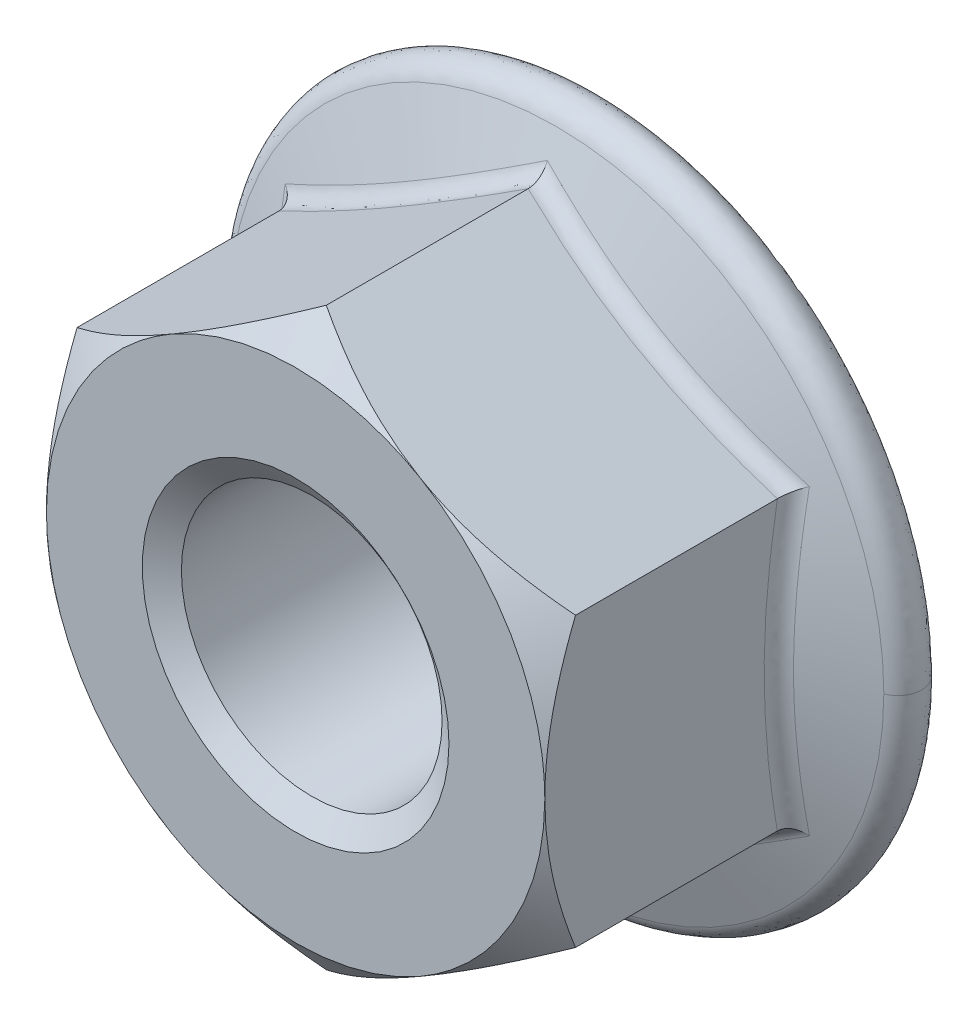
ISO-10303-21;
HEADER;
FILE_DESCRIPTION(('STEP AP214'),'2;1');
FILE_NAME('part.step','',(''),(''),'','','');
FILE_SCHEMA(('AUTOMOTIVE_DESIGN { 1 0 10303 214 1 1 1 1 }'));
ENDSEC;
DATA;
#1=APPLICATION_CONTEXT('core data for automotive mechanical design processes');
#2=APPLICATION_PROTOCOL_DEFINITION('international standard','automotive_design',2000,#1);
#3=PRODUCT_CONTEXT('',#1,'mechanical');
#4=PRODUCT('Part','Part','',(#3));
#5=PRODUCT_RELATED_PRODUCT_CATEGORY('part','',(#4));
#6=PRODUCT_DEFINITION_FORMATION('','',#4);
#7=PRODUCT_DEFINITION_CONTEXT('part definition',#1,'design');
#8=PRODUCT_DEFINITION('design','',#6,#7);
#9=PRODUCT_DEFINITION_SHAPE('','',#8);
#10=(LENGTH_UNIT() NAMED_UNIT(*) SI_UNIT(.MILLI.,.METRE.));
#11=(NAMED_UNIT(*) PLANE_ANGLE_UNIT() SI_UNIT($,.RADIAN.));
#12=(NAMED_UNIT(*) SI_UNIT($,.STERADIAN.) SOLID_ANGLE_UNIT());
#13=UNCERTAINTY_MEASURE_WITH_UNIT(LENGTH_MEASURE(1.E-05),#10,'distance_accuracy_value','');
#14=(GEOMETRIC_REPRESENTATION_CONTEXT(3) GLOBAL_UNCERTAINTY_ASSIGNED_CONTEXT((#13)) GLOBAL_UNIT_ASSIGNED_CONTEXT((#10,
#11,#12)) REPRESENTATION_CONTEXT('',''));
#15=CARTESIAN_POINT('',(0.,0.,0.));
#16=DIRECTION('',(0.,0.,1.));
#17=DIRECTION('',(1.,0.,0.));
#18=AXIS2_PLACEMENT_3D('',#15,#16,#17);
#19=CARTESIAN_POINT('',(-3.847721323,6.568784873,-0.88528));
#20=CARTESIAN_POINT('',(-1.411627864,7.99574723,-0.88528));
#21=CARTESIAN_POINT('',(1.411627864,7.99574723,-0.88528));
#22=CARTESIAN_POINT('',(3.847721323,6.568784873,-0.88528));
#23=CARTESIAN_POINT('',(-3.285304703,5.608633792,0.));
#24=CARTESIAN_POINT('',(-1.205291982,6.827018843,0.));
#25=CARTESIAN_POINT('',(1.205291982,6.827018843,0.));
#26=CARTESIAN_POINT('',(3.285304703,5.608633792,0.));
#27=(BOUNDED_SURFACE() B_SPLINE_SURFACE(1,3,((#19,#20,#21,#22),(#23,#24,#25,#26)),.UNSPECIFIED.,
.F.,.F.,.F.) B_SPLINE_SURFACE_WITH_KNOTS((2,2),(4,4),(0.,1.),(0.,1.),
.UNSPECIFIED.) GEOMETRIC_REPRESENTATION_ITEM() RATIONAL_B_SPLINE_SURFACE(((1.,0.908577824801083,
0.908577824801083,1.),(1.,0.908577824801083,0.908577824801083,1.))) REPRESENTATION_ITEM('') SURFACE());
#28=CARTESIAN_POINT('',(-5.30165961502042E-10,7.50555349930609,-0.79999999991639));
#29=CARTESIAN_POINT('',(0.0992690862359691,7.44824046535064,-0.754405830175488));
#30=CARTESIAN_POINT('',(0.199001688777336,7.39065982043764,-0.710159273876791));
#31=CARTESIAN_POINT('',(0.399554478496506,7.27487061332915,-0.624620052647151));
#32=CARTESIAN_POINT('',(0.500375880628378,7.21666134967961,-0.583331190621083));
#33=CARTESIAN_POINT('',(0.812308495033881,7.03656697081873,-0.461340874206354));
#34=CARTESIAN_POINT('',(1.02507594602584,6.9137256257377,-0.386167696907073));
#35=CARTESIAN_POINT('',(1.45460132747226,6.66573903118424,-0.253487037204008));
#36=CARTESIAN_POINT('',(1.67135586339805,6.54059574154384,-0.195965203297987));
#37=CARTESIAN_POINT('',(2.00169752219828,6.34987289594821,-0.124680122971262));
#38=CARTESIAN_POINT('',(2.11406417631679,6.28499797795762,-0.103255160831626));
#39=CARTESIAN_POINT('',(2.33951687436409,6.15483280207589,-0.0662159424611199));
#40=CARTESIAN_POINT('',(2.45260288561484,6.08954256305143,-0.0506014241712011));
#41=CARTESIAN_POINT('',(2.67959334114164,5.95848956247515,-0.0254494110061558));
#42=CARTESIAN_POINT('',(2.7934991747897,5.89272599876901,-0.0159285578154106));
#43=CARTESIAN_POINT('',(3.02160110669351,5.76103128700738,-0.00319210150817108));
#44=CARTESIAN_POINT('',(3.13579726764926,5.69510010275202,2.19985716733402E-05));
#45=CARTESIAN_POINT('',(3.2499999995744,5.62916512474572,3.20260032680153E-10));
#46=B_SPLINE_CURVE_WITH_KNOTS('',3,(#28,#29,#30,#31,#32,#33,#34,#35,#36,#37,#38,#39,#40,#41,#42,
#43,#44,#45),.UNSPECIFIED.,.F.,.F.,(4,2,2,2,2,2,2,2,4),(0.,0.370068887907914,0.740605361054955,
1.51083341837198,2.28043356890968,2.67484288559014,3.06923441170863,3.46469846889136,
3.86025676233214),.UNSPECIFIED.);
#47=CARTESIAN_POINT('',(2.65083437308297E-10,7.50555349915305,-0.800000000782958));
#48=VERTEX_POINT('',#47);
#49=CARTESIAN_POINT('',(3.2499999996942,5.62916512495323,1.601301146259E-10));
#50=VERTEX_POINT('',#49);
#51=EDGE_CURVE('E585',#48,#50,#46,.T.);
#52=CARTESIAN_POINT('',(-3.25000000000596,5.62916512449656,3.20258853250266E-10));
#53=CARTESIAN_POINT('',(-3.14774469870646,5.68820225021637,1.43174473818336E-05));
#54=CARTESIAN_POINT('',(-3.0454932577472,5.7472371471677,-0.00255920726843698));
#55=CARTESIAN_POINT('',(-2.84119424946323,5.8651892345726,-0.0127760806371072));
#56=CARTESIAN_POINT('',(-2.7391466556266,5.92410644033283,-0.0204187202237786));
#57=CARTESIAN_POINT('',(-2.53566082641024,6.04158903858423,-0.0406443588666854));
#58=CARTESIAN_POINT('',(-2.43422172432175,6.10015493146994,-0.0532157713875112));
#59=CARTESIAN_POINT('',(-2.23187325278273,6.2169808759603,-0.0831016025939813));
#60=CARTESIAN_POINT('',(-2.13096388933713,6.275240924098,-0.100416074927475));
#61=CARTESIAN_POINT('',(-1.85745354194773,6.4331521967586,-0.153623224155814));
#62=CARTESIAN_POINT('',(-1.68548604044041,6.53243768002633,-0.193921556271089));
#63=CARTESIAN_POINT('',(-1.34384695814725,6.72968309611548,-0.286372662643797));
#64=CARTESIAN_POINT('',(-1.17417738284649,6.82764187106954,-0.338535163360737));
#65=CARTESIAN_POINT('',(-0.835371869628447,7.02325132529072,-0.453793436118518));
#66=CARTESIAN_POINT('',(-0.666269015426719,7.12088290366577,-0.517017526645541));
#67=CARTESIAN_POINT('',(-0.331002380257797,7.31444918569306,-0.652280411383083));
#68=CARTESIAN_POINT('',(-0.164834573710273,7.41038621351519,-0.724305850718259));
#69=CARTESIAN_POINT('',(5.30168795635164E-10,7.50555349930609,-0.799999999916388));
#70=B_SPLINE_CURVE_WITH_KNOTS('',3,(#52,#53,#54,#55,#56,#57,#58,#59,#60,#61,#62,#63,#64,#65,#66,
#67,#68,#69),.UNSPECIFIED.,.F.,.F.,(4,2,2,2,2,2,2,2,4),(0.,0.354187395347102,0.708325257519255,
1.06163555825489,1.4149498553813,2.02236233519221,2.63027458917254,3.24577330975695,
3.86034942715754),.UNSPECIFIED.);
#71=CARTESIAN_POINT('',(-3.25000000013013,5.62916512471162,1.97565710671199E-10));
#72=VERTEX_POINT('',#71);
#73=EDGE_CURVE('E135',#72,#48,#70,.T.);
#74=CARTESIAN_POINT('',(-3.25000000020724,5.62916512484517,0.));
#75=CARTESIAN_POINT('',(-3.09160009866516,5.72064011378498,0.));
#76=CARTESIAN_POINT('',(-2.92932271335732,5.80539361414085,0.));
#77=CARTESIAN_POINT('',(-2.59821452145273,5.96092833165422,0.));
#78=CARTESIAN_POINT('',(-2.42938405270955,6.03171026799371,0.));
#79=CARTESIAN_POINT('',(-2.08666438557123,6.15866735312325,0.));
#80=CARTESIAN_POINT('',(-1.91278487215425,6.21486864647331,0.));
#81=CARTESIAN_POINT('',(-1.56091477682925,6.3124379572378,0.));
#82=CARTESIAN_POINT('',(-1.38292423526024,6.35380612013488,0.));
#83=CARTESIAN_POINT('',(-1.02398745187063,6.42143462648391,0.));
#84=CARTESIAN_POINT('',(-0.84303953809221,6.447686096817,0.));
#85=CARTESIAN_POINT('',(-0.479495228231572,6.48486592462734,0.));
#86=CARTESIAN_POINT('',(-0.296898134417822,6.49578745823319,0.));
#87=CARTESIAN_POINT('',(0.0686080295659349,6.50220791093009,0.));
#88=CARTESIAN_POINT('',(0.251517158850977,6.49770348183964,0.));
#89=CARTESIAN_POINT('',(0.616224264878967,6.47330360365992,0.));
#90=CARTESIAN_POINT('',(0.798022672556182,6.45341456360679,0.));
#91=CARTESIAN_POINT('',(1.17782742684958,6.39556847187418,0.));
#92=CARTESIAN_POINT('',(1.37558568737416,6.35596882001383,0.));
#93=CARTESIAN_POINT('',(1.76659021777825,6.25857558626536,0.));
#94=CARTESIAN_POINT('',(1.95983591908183,6.20077972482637,0.));
#95=CARTESIAN_POINT('',(2.34063317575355,6.06730756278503,0.));
#96=CARTESIAN_POINT('',(2.5281681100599,5.99158382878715,0.));
#97=CARTESIAN_POINT('',(2.89538019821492,5.8230310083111,0.));
#98=CARTESIAN_POINT('',(3.07505754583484,5.73020234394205,0.));
#99=CARTESIAN_POINT('',(3.24999999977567,5.62916512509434,0.));
#100=B_SPLINE_CURVE_WITH_KNOTS('',3,(#74,#75,#76,#77,#78,#79,#80,#81,#82,#83,#84,#85,#86,#87,
#88,#89,#90,#91,#92,#93,#94,#95,#96,#97,#98,#99),.UNSPECIFIED.,.F.,.F.,(4,2,2,2,2,2,2,2,2,2,2,2,
4),(0.,0.548579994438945,1.09713174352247,1.64469297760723,2.19224884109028,2.74012577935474,
3.28824651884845,3.83648623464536,4.38449768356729,4.98866417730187,5.59290638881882,
6.19876552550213,6.80460971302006),.UNSPECIFIED.);
#101=EDGE_CURVE('E146',#72,#50,#100,.T.);
#102=ORIENTED_EDGE('',*,*,#51,.F.);
#103=ORIENTED_EDGE('',*,*,#73,.F.);
#104=ORIENTED_EDGE('',*,*,#101,.T.);
#105=EDGE_LOOP('',(#102,#103,#104));
#106=FACE_BOUND('',#105,.T.);
#107=ADVANCED_FACE('F17',(#106),#27,.T.);
#108=CARTESIAN_POINT('',(3.76487391,6.616616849,-0.88528));
#109=CARTESIAN_POINT('',(6.218706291,5.220379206,-0.88528));
#110=CARTESIAN_POINT('',(7.630334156,2.775368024,-0.88528));
#111=CARTESIAN_POINT('',(7.612595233,-0.047831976,-0.88528));
#112=CARTESIAN_POINT('',(3.214566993,5.649474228,0.));
#113=CARTESIAN_POINT('',(5.309725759,4.457322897,0.));
#114=CARTESIAN_POINT('',(6.515017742,2.369695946,0.));
#115=CARTESIAN_POINT('',(6.499871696,-0.040840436,0.));
#116=(BOUNDED_SURFACE() B_SPLINE_SURFACE(1,3,((#108,#109,#110,#111),(#112,#113,#114,#115)),
.UNSPECIFIED.,.F.,.F.,.F.) B_SPLINE_SURFACE_WITH_KNOTS((2,2),(4,4),(0.,1.),(0.,1.),
.UNSPECIFIED.) GEOMETRIC_REPRESENTATION_ITEM() RATIONAL_B_SPLINE_SURFACE(((1.,0.908577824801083,
0.908577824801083,1.),(1.,0.908577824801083,0.908577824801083,1.))) REPRESENTATION_ITEM('') SURFACE());
#117=CARTESIAN_POINT('',(6.5,0.,3.44888494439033E-10));
#118=CARTESIAN_POINT('',(6.5,0.118074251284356,1.43174909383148E-05));
#119=CARTESIAN_POINT('',(6.5,0.236144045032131,-0.00255920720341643));
#120=CARTESIAN_POINT('',(6.5,0.472048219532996,-0.0127760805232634));
#121=CARTESIAN_POINT('',(6.5,0.58988263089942,-0.0204187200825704));
#122=CARTESIAN_POINT('',(6.5,0.824847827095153,-0.0406443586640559));
#123=CARTESIAN_POINT('',(6.5,0.941979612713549,-0.0532157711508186));
#124=CARTESIAN_POINT('',(6.5,1.17563150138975,-0.0831016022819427));
#125=CARTESIAN_POINT('',(6.5,1.29215159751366,-0.100416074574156));
#126=CARTESIAN_POINT('',(6.50000000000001,1.60797414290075,-0.153623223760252));
#127=CARTESIAN_POINT('',(6.5,1.80654510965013,-0.193921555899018));
#128=CARTESIAN_POINT('',(6.5,2.20103594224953,-0.286372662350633));
#129=CARTESIAN_POINT('',(6.5,2.39695349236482,-0.338535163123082));
#130=CARTESIAN_POINT('',(6.5,2.78817240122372,-0.453793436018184));
#131=CARTESIAN_POINT('',(6.5,2.98343555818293,-0.517017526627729));
#132=CARTESIAN_POINT('',(6.5,3.37056812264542,-0.652280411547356));
#133=CARTESIAN_POINT('',(6.5,3.56244217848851,-0.724305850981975));
#134=CARTESIAN_POINT('',(6.5,3.75277675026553,-0.800000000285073));
#135=B_SPLINE_CURVE_WITH_KNOTS('',3,(#117,#118,#119,#120,#121,#122,#123,#124,#125,#126,#127,
#128,#129,#130,#131,#132,#133,#134),.UNSPECIFIED.,.F.,.F.,(4,2,2,2,2,2,2,2,4),(0.,
0.354187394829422,0.708325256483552,1.06163555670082,1.41494985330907,2.02236233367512,
2.63027458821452,3.2457733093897,3.86034942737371),.UNSPECIFIED.);
#136=CARTESIAN_POINT('',(6.50000000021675,0.,1.72444247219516E-10));
#137=VERTEX_POINT('',#136);
#138=CARTESIAN_POINT('',(6.5000000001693,3.75277674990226,-0.800000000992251));
#139=VERTEX_POINT('',#138);
#140=EDGE_CURVE('E464',#137,#139,#135,.T.);
#141=CARTESIAN_POINT('',(3.2499999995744,5.62916512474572,3.8126053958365E-10));
#142=CARTESIAN_POINT('',(3.35225530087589,5.57012799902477,1.43174969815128E-05));
#143=CARTESIAN_POINT('',(3.4545067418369,5.51109310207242,-0.00255920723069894));
#144=CARTESIAN_POINT('',(3.65880575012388,5.39314101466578,-0.0127760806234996));
#145=CARTESIAN_POINT('',(3.76085334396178,5.33422380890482,-0.0204187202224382));
#146=CARTESIAN_POINT('',(3.96433917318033,5.21674121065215,-0.040644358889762));
#147=CARTESIAN_POINT('',(4.06577827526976,5.15817531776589,-0.0532157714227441));
#148=CARTESIAN_POINT('',(4.26812674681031,5.04134937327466,-0.0831016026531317));
#149=CARTESIAN_POINT('',(4.36903611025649,4.98308932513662,-0.100416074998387));
#150=CARTESIAN_POINT('',(4.64254645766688,4.82517805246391,-0.153623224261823));
#151=CARTESIAN_POINT('',(4.81451395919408,4.7258925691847,-0.193921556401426));
#152=CARTESIAN_POINT('',(5.15615304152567,4.52864715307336,-0.286372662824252));
#153=CARTESIAN_POINT('',(5.32582261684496,4.4306883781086,-0.338535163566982));
#154=CARTESIAN_POINT('',(5.66462813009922,4.23507892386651,-0.453793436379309));
#155=CARTESIAN_POINT('',(5.83373098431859,4.13744734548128,-0.517017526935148));
#156=CARTESIAN_POINT('',(6.16899761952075,3.9438810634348,-0.652280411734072));
#157=CARTESIAN_POINT('',(6.33516542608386,3.84794403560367,-0.724305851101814));
#158=CARTESIAN_POINT('',(6.50000000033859,3.75277674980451,-0.800000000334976));
#159=B_SPLINE_CURVE_WITH_KNOTS('',3,(#141,#142,#143,#144,#145,#146,#147,#148,#149,#150,#151,
#152,#153,#154,#155,#156,#157,#158),.UNSPECIFIED.,.F.,.F.,(4,2,2,2,2,2,2,2,4),(0.,
0.354187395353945,0.708325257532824,1.06163555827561,1.41494985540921,2.0223623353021,
2.63027458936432,3.24577331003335,3.86034942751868),.UNSPECIFIED.);
#160=EDGE_CURVE('E465',#50,#139,#159,.T.);
#161=CARTESIAN_POINT('',(3.24999999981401,5.62916512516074,0.));
#162=CARTESIAN_POINT('',(3.40841961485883,5.53772428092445,0.));
#163=CARTESIAN_POINT('',(3.5629569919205,5.43956469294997,0.));
#164=CARTESIAN_POINT('',(3.86320810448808,5.2305839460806,0.));
#165=CARTESIAN_POINT('',(4.00892229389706,5.11976343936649,0.));
#166=CARTESIAN_POINT('',(4.29023018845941,4.886438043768,0.));
#167=CARTESIAN_POINT('',(4.4258416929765,4.76395461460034,0.));
#168=CARTESIAN_POINT('',(4.68627424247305,4.50801082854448,0.));
#169=CARTESIAN_POINT('',(4.81109539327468,4.37455057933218,0.));
#170=CARTESIAN_POINT('',(5.04913178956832,4.09751645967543,0.));
#171=CARTESIAN_POINT('',(5.16234018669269,3.9539367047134,0.));
#172=CARTESIAN_POINT('',(5.37631101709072,3.65768801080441,0.));
#173=CARTESIAN_POINT('',(5.47706788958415,3.5050150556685,0.));
#174=CARTESIAN_POINT('',(5.66538124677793,3.19168765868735,0.));
#175=CARTESIAN_POINT('',(5.75293486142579,3.0310314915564,0.));
#176=CARTESIAN_POINT('',(5.91415750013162,2.70298593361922,0.));
#177=CARTESIAN_POINT('',(5.98783229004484,2.53559937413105,0.));
#178=CARTESIAN_POINT('',(6.12763848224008,2.17775576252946,0.));
#179=CARTESIAN_POINT('',(6.19222330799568,1.986692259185,0.));
#180=CARTESIAN_POINT('',(6.30338055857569,1.59937578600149,0.));
#181=CARTESIAN_POINT('',(6.34995072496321,1.40312216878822,0.));
#182=CARTESIAN_POINT('',(6.42475907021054,1.00660598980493,0.));
#183=CARTESIAN_POINT('',(6.45294786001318,0.806334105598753,0.));
#184=CARTESIAN_POINT('',(6.49058287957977,0.404042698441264,0.));
#185=CARTESIAN_POINT('',(6.50002957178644,0.202023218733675,0.));
#186=CARTESIAN_POINT('',(6.50000000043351,0.,0.));
#187=B_SPLINE_CURVE_WITH_KNOTS('',3,(#161,#162,#163,#164,#165,#166,#167,#168,#169,#170,#171,
#172,#173,#174,#175,#176,#177,#178,#179,#180,#181,#182,#183,#184,#185,#186),.UNSPECIFIED.,.F.,
.F.,(4,2,2,2,2,2,2,2,2,2,2,2,4),(0.,0.548579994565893,1.09713174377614,1.64469297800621,
2.19224884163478,2.74012578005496,3.28824651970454,3.83648623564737,4.38449768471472,
4.98866417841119,5.5929063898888,6.19876552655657,6.80460971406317),.UNSPECIFIED.);
#188=EDGE_CURVE('E405',#50,#137,#187,.T.);
#189=ORIENTED_EDGE('',*,*,#140,.T.);
#190=ORIENTED_EDGE('',*,*,#160,.F.);
#191=ORIENTED_EDGE('',*,*,#188,.T.);
#192=EDGE_LOOP('',(#189,#190,#191));
#193=FACE_BOUND('',#192,.T.);
#194=ADVANCED_FACE('F432',(#193),#116,.T.);
#195=CARTESIAN_POINT('',(7.612595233,0.047831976,-0.88528));
#196=CARTESIAN_POINT('',(7.630334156,-2.775368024,-0.88528));
#197=CARTESIAN_POINT('',(6.218706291,-5.220379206,-0.88528));
#198=CARTESIAN_POINT('',(3.76487391,-6.616616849,-0.88528));
#199=CARTESIAN_POINT('',(6.499871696,0.040840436,0.));
#200=CARTESIAN_POINT('',(6.515017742,-2.369695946,0.));
#201=CARTESIAN_POINT('',(5.309725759,-4.457322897,0.));
#202=CARTESIAN_POINT('',(3.214566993,-5.649474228,0.));
#203=(BOUNDED_SURFACE() B_SPLINE_SURFACE(1,3,((#195,#196,#197,#198),(#199,#200,#201,#202)),
.UNSPECIFIED.,.F.,.F.,.F.) B_SPLINE_SURFACE_WITH_KNOTS((2,2),(4,4),(0.,1.),(0.,1.),
.UNSPECIFIED.) GEOMETRIC_REPRESENTATION_ITEM() RATIONAL_B_SPLINE_SURFACE(((1.,0.908577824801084,
0.908577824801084,1.),(1.,0.908577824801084,0.908577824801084,1.))) REPRESENTATION_ITEM('') SURFACE());
#204=CARTESIAN_POINT('',(6.5000000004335,0.,0.));
#205=CARTESIAN_POINT('',(6.50001971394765,-0.182915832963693,0.));
#206=CARTESIAN_POINT('',(6.49227970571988,-0.365828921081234,0.));
#207=CARTESIAN_POINT('',(6.46142262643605,-0.730344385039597,0.));
#208=CARTESIAN_POINT('',(6.43830634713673,-0.911946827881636,0.));
#209=CARTESIAN_POINT('',(6.3768945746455,-1.27222930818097,0.));
#210=CARTESIAN_POINT('',(6.33862656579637,-1.45091403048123,0.));
#211=CARTESIAN_POINT('',(6.24718902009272,-1.80442712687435,0.));
#212=CARTESIAN_POINT('',(6.19401962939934,-1.97925553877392,0.));
#213=CARTESIAN_POINT('',(6.07311924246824,-2.32391816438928,0.));
#214=CARTESIAN_POINT('',(6.00537972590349,-2.49374938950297,0.));
#215=CARTESIAN_POINT('',(5.85580624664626,-2.82717791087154,0.));
#216=CARTESIAN_POINT('',(5.77396602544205,-2.99077239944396,0.));
#217=CARTESIAN_POINT('',(5.59677321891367,-3.31052024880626,0.));
#218=CARTESIAN_POINT('',(5.50141770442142,-3.46667198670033,0.));
#219=CARTESIAN_POINT('',(5.29793323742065,-3.77031766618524,0.));
#220=CARTESIAN_POINT('',(5.18980961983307,-3.91781518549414,0.));
#221=CARTESIAN_POINT('',(4.94981105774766,-4.2178127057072,0.));
#222=CARTESIAN_POINT('',(4.81663762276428,-4.36927655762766,0.));
#223=CARTESIAN_POINT('',(4.53679034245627,-4.6591997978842,0.));
#224=CARTESIAN_POINT('',(4.39011480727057,-4.79765755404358,0.));
#225=CARTESIAN_POINT('',(4.08412589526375,-5.060701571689,0.));
#226=CARTESIAN_POINT('',(3.92477975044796,-5.18524972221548,0.));
#227=CARTESIAN_POINT('',(3.5952026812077,-5.41898830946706,0.));
#228=CARTESIAN_POINT('',(3.42497202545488,-5.5281791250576,0.));
#229=CARTESIAN_POINT('',(3.24999999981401,-5.62916512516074,0.));
#230=B_SPLINE_CURVE_WITH_KNOTS('',3,(#204,#205,#206,#207,#208,#209,#210,#211,#212,#213,#214,
#215,#216,#217,#218,#219,#220,#221,#222,#223,#224,#225,#226,#227,#228,#229),.UNSPECIFIED.,.F.,
.F.,(4,2,2,2,2,2,2,2,2,2,2,2,4),(0.,0.548579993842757,1.0971317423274,1.64469297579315,
2.19224883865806,2.7401257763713,3.28824651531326,3.83648623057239,4.38449767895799,
4.98866417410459,5.59290638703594,6.19876552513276,6.80460971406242),.UNSPECIFIED.);
#231=CARTESIAN_POINT('',(3.2499999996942,-5.62916512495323,1.90629778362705E-10));
#232=VERTEX_POINT('',#231);
#233=EDGE_CURVE('E420',#137,#232,#230,.T.);
#234=CARTESIAN_POINT('',(6.50000000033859,-3.75277674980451,-0.800000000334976));
#235=CARTESIAN_POINT('',(6.4007309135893,-3.81008978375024,-0.754405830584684));
#236=CARTESIAN_POINT('',(6.30099831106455,-3.86767042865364,-0.710159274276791));
#237=CARTESIAN_POINT('',(6.10044552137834,-3.98345963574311,-0.624620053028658));
#238=CARTESIAN_POINT('',(5.9996241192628,-4.04166889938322,-0.583331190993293));
#239=CARTESIAN_POINT('',(5.68769150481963,-4.22176327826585,-0.461340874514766));
#240=CARTESIAN_POINT('',(5.47492405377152,-4.34460462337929,-0.38616769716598));
#241=CARTESIAN_POINT('',(5.04539867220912,-4.59259121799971,-0.253487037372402));
#242=CARTESIAN_POINT('',(4.82864413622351,-4.71773450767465,-0.195965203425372));
#243=CARTESIAN_POINT('',(4.49830247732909,-4.90845735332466,-0.124680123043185));
#244=CARTESIAN_POINT('',(4.38593582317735,-4.97333227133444,-0.103255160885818));
#245=CARTESIAN_POINT('',(4.16048312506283,-5.10349744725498,-0.0662159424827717));
#246=CARTESIAN_POINT('',(4.04739711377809,-5.16878768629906,-0.0506014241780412));
#247=CARTESIAN_POINT('',(3.82040665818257,-5.29984068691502,-0.0254494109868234));
#248=CARTESIAN_POINT('',(3.70650082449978,-5.36560425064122,-0.0159285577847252));
#249=CARTESIAN_POINT('',(3.47839889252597,-5.49729896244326,-0.00319210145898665));
#250=CARTESIAN_POINT('',(3.36420273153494,-5.56323014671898,2.19986279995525E-05));
#251=CARTESIAN_POINT('',(3.2499999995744,-5.62916512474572,3.81260146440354E-10));
#252=B_SPLINE_CURVE_WITH_KNOTS('',3,(#234,#235,#236,#237,#238,#239,#240,#241,#242,#243,#244,
#245,#246,#247,#248,#249,#250,#251),.UNSPECIFIED.,.F.,.F.,(4,2,2,2,2,2,2,2,4),(0.,
0.370068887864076,0.740605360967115,1.51083341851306,2.2804335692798,2.67484288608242,
3.06923441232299,3.46469846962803,3.86025676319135),.UNSPECIFIED.);
#253=CARTESIAN_POINT('',(6.5,-3.75277675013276,-0.8000000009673));
#254=VERTEX_POINT('',#253);
#255=EDGE_CURVE('E449',#254,#232,#252,.T.);
#256=CARTESIAN_POINT('',(6.5,-3.75277675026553,-0.800000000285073));
#257=CARTESIAN_POINT('',(6.5,-3.63815068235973,-0.754405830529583));
#258=CARTESIAN_POINT('',(6.5,-3.52298939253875,-0.710159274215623));
#259=CARTESIAN_POINT('',(6.5,-3.29141097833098,-0.624620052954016));
#260=CARTESIAN_POINT('',(6.5,-3.17499245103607,-0.583331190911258));
#261=CARTESIAN_POINT('',(6.5,-2.81480369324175,-0.461340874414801));
#262=CARTESIAN_POINT('',(6.5,-2.56912100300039,-0.38616769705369));
#263=CARTESIAN_POINT('',(6.5,-2.07314781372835,-0.253487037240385));
#264=CARTESIAN_POINT('',(6.50000000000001,-1.82286123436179,-0.195965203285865));
#265=CARTESIAN_POINT('',(6.5,-1.44141554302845,-0.12468012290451));
#266=CARTESIAN_POINT('',(6.5,-1.31166570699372,-0.103255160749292));
#267=CARTESIAN_POINT('',(6.5,-1.05133535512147,-0.0662159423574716));
#268=CARTESIAN_POINT('',(6.5,-0.920754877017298,-0.050601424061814));
#269=CARTESIAN_POINT('',(6.5,-0.658648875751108,-0.0254494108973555));
#270=CARTESIAN_POINT('',(6.5,-0.527121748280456,-0.0159285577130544));
#271=CARTESIAN_POINT('',(6.5,-0.263732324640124,-0.00319210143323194));
#272=CARTESIAN_POINT('',(6.5,-0.131869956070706,2.19986256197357E-05));
#273=CARTESIAN_POINT('',(6.5,0.,3.44887708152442E-10));
#274=B_SPLINE_CURVE_WITH_KNOTS('',3,(#256,#257,#258,#259,#260,#261,#262,#263,#264,#265,#266,
#267,#268,#269,#270,#271,#272,#273),.UNSPECIFIED.,.F.,.F.,(4,2,2,2,2,2,2,2,4),(0.,
0.370068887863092,0.740605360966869,1.51083341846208,2.28043356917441,2.67484288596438,
3.0692344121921,3.46469846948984,3.86025676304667),.UNSPECIFIED.);
#275=EDGE_CURVE('E457',#254,#137,#274,.T.);
#276=ORIENTED_EDGE('',*,*,#233,.T.);
#277=ORIENTED_EDGE('',*,*,#255,.F.);
#278=ORIENTED_EDGE('',*,*,#275,.T.);
#279=EDGE_LOOP('',(#276,#277,#278));
#280=FACE_BOUND('',#279,.T.);
#281=ADVANCED_FACE('F426',(#280),#203,.T.);
#282=CARTESIAN_POINT('',(3.847721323,-6.568784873,-0.88528));
#283=CARTESIAN_POINT('',(1.411627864,-7.99574723,-0.88528));
#284=CARTESIAN_POINT('',(-1.411627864,-7.99574723,-0.88528));
#285=CARTESIAN_POINT('',(-3.847721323,-6.568784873,-0.88528));
#286=CARTESIAN_POINT('',(3.285304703,-5.608633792,0.));
#287=CARTESIAN_POINT('',(1.205291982,-6.827018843,0.));
#288=CARTESIAN_POINT('',(-1.205291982,-6.827018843,0.));
#289=CARTESIAN_POINT('',(-3.285304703,-5.608633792,0.));
#290=(BOUNDED_SURFACE() B_SPLINE_SURFACE(1,3,((#282,#283,#284,#285),(#286,#287,#288,#289)),
.UNSPECIFIED.,.F.,.F.,.F.) B_SPLINE_SURFACE_WITH_KNOTS((2,2),(4,4),(0.,1.),(0.,1.),
.UNSPECIFIED.) GEOMETRIC_REPRESENTATION_ITEM() RATIONAL_B_SPLINE_SURFACE(((1.,0.908577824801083,
0.908577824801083,1.),(1.,0.908577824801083,0.908577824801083,1.))) REPRESENTATION_ITEM('') SURFACE());
#291=CARTESIAN_POINT('',(5.30165961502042E-10,-7.50555349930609,-0.79999999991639));
#292=CARTESIAN_POINT('',(-0.0992690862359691,-7.44824046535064,-0.754405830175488));
#293=CARTESIAN_POINT('',(-0.199001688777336,-7.39065982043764,-0.710159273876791));
#294=CARTESIAN_POINT('',(-0.399554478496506,-7.27487061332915,-0.624620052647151));
#295=CARTESIAN_POINT('',(-0.500375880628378,-7.21666134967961,-0.583331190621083));
#296=CARTESIAN_POINT('',(-0.812308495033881,-7.03656697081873,-0.461340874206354));
#297=CARTESIAN_POINT('',(-1.02507594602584,-6.9137256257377,-0.386167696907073));
#298=CARTESIAN_POINT('',(-1.45460132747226,-6.66573903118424,-0.253487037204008));
#299=CARTESIAN_POINT('',(-1.67135586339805,-6.54059574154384,-0.195965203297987));
#300=CARTESIAN_POINT('',(-2.00169752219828,-6.34987289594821,-0.124680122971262));
#301=CARTESIAN_POINT('',(-2.11406417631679,-6.28499797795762,-0.103255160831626));
#302=CARTESIAN_POINT('',(-2.33951687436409,-6.15483280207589,-0.0662159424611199));
#303=CARTESIAN_POINT('',(-2.45260288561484,-6.08954256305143,-0.0506014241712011));
#304=CARTESIAN_POINT('',(-2.67959334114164,-5.95848956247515,-0.0254494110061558));
#305=CARTESIAN_POINT('',(-2.7934991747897,-5.89272599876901,-0.0159285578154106));
#306=CARTESIAN_POINT('',(-3.02160110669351,-5.76103128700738,-0.00319210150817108));
#307=CARTESIAN_POINT('',(-3.13579726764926,-5.69510010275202,2.19985716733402E-05));
#308=CARTESIAN_POINT('',(-3.2499999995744,-5.62916512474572,3.20260032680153E-10));
#309=B_SPLINE_CURVE_WITH_KNOTS('',3,(#291,#292,#293,#294,#295,#296,#297,#298,#299,#300,#301,
#302,#303,#304,#305,#306,#307,#308),.UNSPECIFIED.,.F.,.F.,(4,2,2,2,2,2,2,2,4),(0.,
0.370068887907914,0.740605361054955,1.51083341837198,2.28043356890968,2.67484288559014,
3.06923441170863,3.46469846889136,3.86025676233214),.UNSPECIFIED.);
#310=CARTESIAN_POINT('',(-2.65083437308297E-10,-7.50555349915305,-0.800000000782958));
#311=VERTEX_POINT('',#310);
#312=CARTESIAN_POINT('',(-3.2499999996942,-5.62916512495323,1.601301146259E-10));
#313=VERTEX_POINT('',#312);
#314=EDGE_CURVE('E157',#311,#313,#309,.T.);
#315=CARTESIAN_POINT('',(3.2499999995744,-5.62916512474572,3.20259049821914E-10));
#316=CARTESIAN_POINT('',(3.14774469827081,-5.68820225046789,1.4317440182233E-05));
#317=CARTESIAN_POINT('',(3.0454932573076,-5.74723714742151,-0.00255920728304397));
#318=CARTESIAN_POINT('',(2.84119424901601,-5.8651892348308,-0.0127760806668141));
#319=CARTESIAN_POINT('',(2.73914665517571,-5.92410644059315,-0.0204187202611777));
#320=CARTESIAN_POINT('',(2.53566082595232,-6.04158903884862,-0.0406443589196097));
#321=CARTESIAN_POINT('',(2.43422172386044,-6.10015493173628,-0.0532157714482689));
#322=CARTESIAN_POINT('',(2.23187325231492,-6.2169808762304,-0.08310160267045));
#323=CARTESIAN_POINT('',(2.13096388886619,-6.27524092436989,-0.100416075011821));
#324=CARTESIAN_POINT('',(1.85745354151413,-6.43315219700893,-0.153623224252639));
#325=CARTESIAN_POINT('',(1.68548604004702,-6.53243768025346,-0.193921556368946));
#326=CARTESIAN_POINT('',(1.34384695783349,-6.72968309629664,-0.286372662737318));
#327=CARTESIAN_POINT('',(1.17417738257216,-6.82764187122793,-0.33853516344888));
#328=CARTESIAN_POINT('',(0.835371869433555,-7.02325132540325,-0.453793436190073));
#329=CARTESIAN_POINT('',(0.66626901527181,-7.12088290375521,-0.517017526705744));
#330=CARTESIAN_POINT('',(0.331002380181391,-7.31444918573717,-0.652280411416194));
#331=CARTESIAN_POINT('',(0.16483457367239,-7.41038621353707,-0.724305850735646));
#332=CARTESIAN_POINT('',(-5.30168007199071E-10,-7.50555349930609,-0.799999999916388));
#333=B_SPLINE_CURVE_WITH_KNOTS('',3,(#315,#316,#317,#318,#319,#320,#321,#322,#323,#324,#325,
#326,#327,#328,#329,#330,#331,#332),.UNSPECIFIED.,.F.,.F.,(4,2,2,2,2,2,2,2,4),(0.,
0.354187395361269,0.708325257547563,1.06163555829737,1.41494985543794,2.02236233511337,
2.63027458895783,3.24577330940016,3.86034942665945),.UNSPECIFIED.);
#334=EDGE_CURVE('E539',#232,#311,#333,.T.);
#335=CARTESIAN_POINT('',(3.24999999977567,-5.62916512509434,0.));
#336=CARTESIAN_POINT('',(3.09160009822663,-5.72064011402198,0.));
#337=CARTESIAN_POINT('',(2.92932271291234,-5.80539361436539,0.));
#338=CARTESIAN_POINT('',(2.59821452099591,-5.96092833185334,0.));
#339=CARTESIAN_POINT('',(2.42938405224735,-6.03171026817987,0.));
#340=CARTESIAN_POINT('',(2.0866643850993,-6.15866735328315,0.));
#341=CARTESIAN_POINT('',(1.91278487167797,-6.2148686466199,0.));
#342=CARTESIAN_POINT('',(1.5609147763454,-6.31243795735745,0.));
#343=CARTESIAN_POINT('',(1.38292423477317,-6.35380612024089,0.));
#344=CARTESIAN_POINT('',(1.02398745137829,-6.42143462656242,0.));
#345=CARTESIAN_POINT('',(0.84303953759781,-6.44768609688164,0.));
#346=CARTESIAN_POINT('',(0.479495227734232,-6.48486592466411,0.));
#347=CARTESIAN_POINT('',(0.296898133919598,-6.49578745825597,0.));
#348=CARTESIAN_POINT('',(-0.0686080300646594,-6.50220791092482,0.));
#349=CARTESIAN_POINT('',(-0.251517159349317,-6.49770348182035,0.));
#350=CARTESIAN_POINT('',(-0.616224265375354,-6.47330360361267,0.));
#351=CARTESIAN_POINT('',(-0.798022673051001,-6.4534145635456,0.));
#352=CARTESIAN_POINT('',(-1.17782742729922,-6.39556847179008,0.));
#353=CARTESIAN_POINT('',(-1.37558568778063,-6.35596881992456,0.));
#354=CARTESIAN_POINT('',(-1.76659021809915,-6.25857558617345,0.));
#355=CARTESIAN_POINT('',(-1.95983591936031,-6.20077972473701,0.));
#356=CARTESIAN_POINT('',(-2.34063317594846,-6.06730756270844,0.));
#357=CARTESIAN_POINT('',(-2.52816811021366,-5.99158382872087,0.));
#358=CARTESIAN_POINT('',(-2.89538019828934,-5.82303100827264,0.));
#359=CARTESIAN_POINT('',(-3.07505754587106,-5.73020234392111,0.));
#360=CARTESIAN_POINT('',(-3.24999999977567,-5.62916512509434,0.));
#361=B_SPLINE_CURVE_WITH_KNOTS('',3,(#335,#336,#337,#338,#339,#340,#341,#342,#343,#344,#345,
#346,#347,#348,#349,#350,#351,#352,#353,#354,#355,#356,#357,#358,#359,#360),.UNSPECIFIED.,.F.,
.F.,(4,2,2,2,2,2,2,2,2,2,2,2,4),(0.,0.548579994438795,1.09713174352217,1.64469297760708,
2.19224884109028,2.74012577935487,3.28824651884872,3.83648623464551,4.38449768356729,
4.9886641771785,5.5929063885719,6.19876552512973,6.80460971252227),.UNSPECIFIED.);
#362=EDGE_CURVE('E415',#232,#313,#361,.T.);
#363=ORIENTED_EDGE('',*,*,#314,.F.);
#364=ORIENTED_EDGE('',*,*,#334,.F.);
#365=ORIENTED_EDGE('',*,*,#362,.T.);
#366=EDGE_LOOP('',(#363,#364,#365));
#367=FACE_BOUND('',#366,.T.);
#368=ADVANCED_FACE('F431',(#367),#290,.T.);
#369=CARTESIAN_POINT('',(-3.76487391,-6.616616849,-0.88528));
#370=CARTESIAN_POINT('',(-6.218706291,-5.220379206,-0.88528));
#371=CARTESIAN_POINT('',(-7.630334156,-2.775368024,-0.88528));
#372=CARTESIAN_POINT('',(-7.612595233,0.047831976,-0.88528));
#373=CARTESIAN_POINT('',(-3.214566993,-5.649474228,0.));
#374=CARTESIAN_POINT('',(-5.309725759,-4.457322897,0.));
#375=CARTESIAN_POINT('',(-6.515017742,-2.369695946,0.));
#376=CARTESIAN_POINT('',(-6.499871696,0.040840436,0.));
#377=(BOUNDED_SURFACE() B_SPLINE_SURFACE(1,3,((#369,#370,#371,#372),(#373,#374,#375,#376)),
.UNSPECIFIED.,.F.,.F.,.F.) B_SPLINE_SURFACE_WITH_KNOTS((2,2),(4,4),(0.,1.),(0.,1.),
.UNSPECIFIED.) GEOMETRIC_REPRESENTATION_ITEM() RATIONAL_B_SPLINE_SURFACE(((1.,0.908577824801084,
0.908577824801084,1.),(1.,0.908577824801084,0.908577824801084,1.))) REPRESENTATION_ITEM('') SURFACE());
#378=CARTESIAN_POINT('',(-6.5,-3.75277675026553,-0.800000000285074));
#379=CARTESIAN_POINT('',(-6.5,-3.63815068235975,-0.754405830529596));
#380=CARTESIAN_POINT('',(-6.5,-3.52298939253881,-0.710159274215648));
#381=CARTESIAN_POINT('',(-6.5,-3.29141097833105,-0.624620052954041));
#382=CARTESIAN_POINT('',(-6.5,-3.17499245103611,-0.583331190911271));
#383=CARTESIAN_POINT('',(-6.5,-2.81480369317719,-0.461340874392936));
#384=CARTESIAN_POINT('',(-6.5,-2.56912100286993,-0.386167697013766));
#385=CARTESIAN_POINT('',(-6.5,-2.07314781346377,-0.253487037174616));
#386=CARTESIAN_POINT('',(-6.5,-1.822861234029,-0.195965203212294));
#387=CARTESIAN_POINT('',(-6.5,-1.4414155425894,-0.124680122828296));
#388=CARTESIAN_POINT('',(-6.5,-1.3116657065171,-0.103255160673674));
#389=CARTESIAN_POINT('',(-6.5,-1.05133535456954,-0.0662159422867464));
#390=CARTESIAN_POINT('',(-6.5,-0.920754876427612,-0.0506014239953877));
#391=CARTESIAN_POINT('',(-6.5,-0.658648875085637,-0.0254494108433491));
#392=CARTESIAN_POINT('',(-6.5,-0.527121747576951,-0.0159285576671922));
#393=CARTESIAN_POINT('',(-6.5,-0.263732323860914,-0.00319210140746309));
#394=CARTESIAN_POINT('',(-6.5,-0.131869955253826,2.19986394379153E-05));
#395=CARTESIAN_POINT('',(-6.5,8.54211108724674E-10,3.44889280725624E-10));
#396=B_SPLINE_CURVE_WITH_KNOTS('',3,(#378,#379,#380,#381,#382,#383,#384,#385,#386,#387,#388,
#389,#390,#391,#392,#393,#394,#395),.UNSPECIFIED.,.F.,.F.,(4,2,2,2,2,2,2,2,4),(0.,
0.370068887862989,0.740605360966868,1.51083341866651,2.28043356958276,2.67484288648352,
3.06923441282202,3.46469847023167,3.86025676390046),.UNSPECIFIED.);
#397=CARTESIAN_POINT('',(-6.5000000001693,-3.75277674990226,-0.800000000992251));
#398=VERTEX_POINT('',#397);
#399=CARTESIAN_POINT('',(-6.50000000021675,8.54211108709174E-10,1.72443952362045E-10));
#400=VERTEX_POINT('',#399);
#401=EDGE_CURVE('E144',#398,#400,#396,.T.);
#402=CARTESIAN_POINT('',(-3.2499999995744,-5.62916512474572,3.81259556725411E-10));
#403=CARTESIAN_POINT('',(-3.35225530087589,-5.57012799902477,1.43174969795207E-05));
#404=CARTESIAN_POINT('',(-3.4545067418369,-5.51109310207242,-0.00255920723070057));
#405=CARTESIAN_POINT('',(-3.65880575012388,-5.39314101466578,-0.0127760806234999));
#406=CARTESIAN_POINT('',(-3.76085334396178,-5.33422380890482,-0.0204187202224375));
#407=CARTESIAN_POINT('',(-3.96433917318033,-5.21674121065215,-0.040644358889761));
#408=CARTESIAN_POINT('',(-4.06577827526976,-5.15817531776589,-0.0532157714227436));
#409=CARTESIAN_POINT('',(-4.26812674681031,-5.04134937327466,-0.0831016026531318));
#410=CARTESIAN_POINT('',(-4.36903611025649,-4.98308932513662,-0.100416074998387));
#411=CARTESIAN_POINT('',(-4.64254645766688,-4.82517805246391,-0.153623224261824));
#412=CARTESIAN_POINT('',(-4.81451395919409,-4.72589256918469,-0.193921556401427));
#413=CARTESIAN_POINT('',(-5.15615304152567,-4.52864715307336,-0.286372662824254));
#414=CARTESIAN_POINT('',(-5.32582261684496,-4.4306883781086,-0.338535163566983));
#415=CARTESIAN_POINT('',(-5.66462813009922,-4.23507892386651,-0.453793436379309));
#416=CARTESIAN_POINT('',(-5.83373098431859,-4.13744734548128,-0.517017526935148));
#417=CARTESIAN_POINT('',(-6.16899761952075,-3.9438810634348,-0.652280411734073));
#418=CARTESIAN_POINT('',(-6.33516542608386,-3.84794403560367,-0.724305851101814));
#419=CARTESIAN_POINT('',(-6.50000000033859,-3.75277674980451,-0.800000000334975));
#420=B_SPLINE_CURVE_WITH_KNOTS('',3,(#402,#403,#404,#405,#406,#407,#408,#409,#410,#411,#412,
#413,#414,#415,#416,#417,#418,#419),.UNSPECIFIED.,.F.,.F.,(4,2,2,2,2,2,2,2,4),(0.,
0.354187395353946,0.708325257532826,1.06163555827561,1.41494985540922,2.0223623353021,
2.63027458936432,3.24577331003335,3.86034942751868),.UNSPECIFIED.);
#421=EDGE_CURVE('E154',#313,#398,#420,.T.);
#422=CARTESIAN_POINT('',(-3.24999999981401,-5.62916512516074,0.));
#423=CARTESIAN_POINT('',(-3.4084196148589,-5.53772428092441,0.));
#424=CARTESIAN_POINT('',(-3.56295699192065,-5.43956469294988,0.));
#425=CARTESIAN_POINT('',(-3.86320810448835,-5.2305839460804,0.));
#426=CARTESIAN_POINT('',(-4.0089222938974,-5.11976343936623,0.));
#427=CARTESIAN_POINT('',(-4.29023018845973,-4.88643804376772,0.));
#428=CARTESIAN_POINT('',(-4.42584169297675,-4.76395461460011,0.));
#429=CARTESIAN_POINT('',(-4.68627424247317,-4.50801082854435,0.));
#430=CARTESIAN_POINT('',(-4.81109539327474,-4.37455057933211,0.));
#431=CARTESIAN_POINT('',(-5.04913178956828,-4.09751645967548,0.));
#432=CARTESIAN_POINT('',(-5.1623401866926,-3.95393670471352,0.));
#433=CARTESIAN_POINT('',(-5.37631101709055,-3.65768801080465,0.));
#434=CARTESIAN_POINT('',(-5.47706788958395,-3.50501505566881,0.));
#435=CARTESIAN_POINT('',(-5.66538124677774,-3.19168765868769,0.));
#436=CARTESIAN_POINT('',(-5.75293486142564,-3.03103149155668,0.));
#437=CARTESIAN_POINT('',(-5.91415750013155,-2.70298593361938,0.));
#438=CARTESIAN_POINT('',(-5.9878322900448,-2.53559937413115,0.));
#439=CARTESIAN_POINT('',(-6.12763848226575,-2.17775576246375,0.));
#440=CARTESIAN_POINT('',(-6.19222330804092,-1.98669225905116,0.));
#441=CARTESIAN_POINT('',(-6.30338055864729,-1.59937578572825,0.));
#442=CARTESIAN_POINT('',(-6.34995072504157,-1.40312216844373,0.));
#443=CARTESIAN_POINT('',(-6.42475907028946,-1.00660598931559,0.));
#444=CARTESIAN_POINT('',(-6.45294786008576,-0.806334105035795,0.));
#445=CARTESIAN_POINT('',(-6.49058287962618,-0.404042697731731,0.));
#446=CARTESIAN_POINT('',(-6.50002957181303,-0.202023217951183,0.));
#447=CARTESIAN_POINT('',(-6.50000000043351,8.54210375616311E-10,0.));
#448=B_SPLINE_CURVE_WITH_KNOTS('',3,(#422,#423,#424,#425,#426,#427,#428,#429,#430,#431,#432,
#433,#434,#435,#436,#437,#438,#439,#440,#441,#442,#443,#444,#445,#446,#447),.UNSPECIFIED.,.F.,
.F.,(4,2,2,2,2,2,2,2,2,2,2,2,4),(0.,0.548579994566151,1.09713174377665,1.64469297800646,
2.19224884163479,2.74012578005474,3.28824651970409,3.83648623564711,4.38449768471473,
4.98866417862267,5.59290639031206,6.19876552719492,6.80460971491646),.UNSPECIFIED.);
#449=EDGE_CURVE('E391',#313,#400,#448,.T.);
#450=ORIENTED_EDGE('',*,*,#401,.F.);
#451=ORIENTED_EDGE('',*,*,#421,.F.);
#452=ORIENTED_EDGE('',*,*,#449,.T.);
#453=EDGE_LOOP('',(#450,#451,#452));
#454=FACE_BOUND('',#453,.T.);
#455=ADVANCED_FACE('F1000',(#454),#377,.T.);
#456=CARTESIAN_POINT('',(-7.612745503,0.,-0.88528));
#457=CARTESIAN_POINT('',(-7.612745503,2.804840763,-0.88528));
#458=CARTESIAN_POINT('',(-6.202700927,5.229486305,-0.88528));
#459=CARTESIAN_POINT('',(-3.76487391,6.616616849,-0.88528));
#460=CARTESIAN_POINT('',(-6.5,0.,0.));
#461=CARTESIAN_POINT('',(-6.5,2.394860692,0.));
#462=CARTESIAN_POINT('',(-5.296059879,4.465098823,0.));
#463=CARTESIAN_POINT('',(-3.214566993,5.649474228,0.));
#464=(BOUNDED_SURFACE() B_SPLINE_SURFACE(1,3,((#456,#457,#458,#459),(#460,#461,#462,#463)),
.UNSPECIFIED.,.F.,.F.,.F.) B_SPLINE_SURFACE_WITH_KNOTS((2,2),(4,4),(0.,1.),(0.,1.),
.UNSPECIFIED.) GEOMETRIC_REPRESENTATION_ITEM() RATIONAL_B_SPLINE_SURFACE(((1.,0.909633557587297,
0.909633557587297,1.),(1.,0.909633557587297,0.909633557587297,1.))) REPRESENTATION_ITEM('') SURFACE());
#465=CARTESIAN_POINT('',(-6.5,8.54211035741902E-10,0.));
#466=CARTESIAN_POINT('',(-6.5000197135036,0.182915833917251,0.));
#467=CARTESIAN_POINT('',(-6.49227970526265,0.365828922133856,0.));
#468=CARTESIAN_POINT('',(-6.46142262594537,0.730344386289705,0.));
#469=CARTESIAN_POINT('',(-6.43830634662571,0.911946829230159,0.));
#470=CARTESIAN_POINT('',(-6.37689457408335,1.27222930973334,0.));
#471=CARTESIAN_POINT('',(-6.33862656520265,1.4509140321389,0.));
#472=CARTESIAN_POINT('',(-6.24718901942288,1.8044271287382,0.));
#473=CARTESIAN_POINT('',(-6.19401962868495,1.97925554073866,0.));
#474=CARTESIAN_POINT('',(-6.07311924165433,2.3239181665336,0.));
#475=CARTESIAN_POINT('',(-6.00537972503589,2.49374939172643,0.));
#476=CARTESIAN_POINT('',(-5.85580624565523,2.82717791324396,0.));
#477=CARTESIAN_POINT('',(-5.77396602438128,2.9907724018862,0.));
#478=CARTESIAN_POINT('',(-5.59677321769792,3.31052025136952,0.));
#479=CARTESIAN_POINT('',(-5.50141770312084,3.46667198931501,0.));
#480=CARTESIAN_POINT('',(-5.29793323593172,3.77031766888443,0.));
#481=CARTESIAN_POINT('',(-5.18980961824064,3.91781518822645,0.));
#482=CARTESIAN_POINT('',(-4.9498110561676,4.2178127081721,0.));
#483=CARTESIAN_POINT('',(-4.81663762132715,4.36927655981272,0.));
#484=CARTESIAN_POINT('',(-4.53679034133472,4.65919979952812,0.));
#485=CARTESIAN_POINT('',(-4.39011480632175,4.79765755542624,0.));
#486=CARTESIAN_POINT('',(-4.08412589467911,5.06070157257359,0.));
#487=CARTESIAN_POINT('',(-3.9247797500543,5.18524972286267,0.));
#488=CARTESIAN_POINT('',(-3.59520268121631,5.41898830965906,0.));
#489=CARTESIAN_POINT('',(-3.42497202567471,5.52817912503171,0.));
#490=CARTESIAN_POINT('',(-3.25000000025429,5.62916512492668,0.));
#491=B_SPLINE_CURVE_WITH_KNOTS('',3,(#465,#466,#467,#468,#469,#470,#471,#472,#473,#474,#475,
#476,#477,#478,#479,#480,#481,#482,#483,#484,#485,#486,#487,#488,#489,#490),.UNSPECIFIED.,.F.,
.F.,(4,2,2,2,2,2,2,2,2,2,2,2,4),(0.,0.548579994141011,1.09713174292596,1.64469297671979,
2.19224883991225,2.74012577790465,3.28824651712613,3.83648623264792,4.38449768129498,
4.98866417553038,5.59290638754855,6.19876552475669,6.80460971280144),.UNSPECIFIED.);
#492=EDGE_CURVE('E131',#400,#72,#491,.T.);
#493=CARTESIAN_POINT('',(-6.50000000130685,3.75277674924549,-0.800000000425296));
#494=CARTESIAN_POINT('',(-6.40078107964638,3.81006082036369,-0.754428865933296));
#495=CARTESIAN_POINT('',(-6.30109912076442,3.8676122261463,-0.710203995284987));
#496=CARTESIAN_POINT('',(-6.10064871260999,3.98334232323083,-0.624704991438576));
#497=CARTESIAN_POINT('',(-5.99987905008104,4.04152171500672,-0.583434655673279));
#498=CARTESIAN_POINT('',(-5.68797593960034,4.22159905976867,-0.461444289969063));
#499=CARTESIAN_POINT('',(-5.47518524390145,4.3444538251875,-0.386255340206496));
#500=CARTESIAN_POINT('',(-5.0456122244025,4.59246792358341,-0.253546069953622));
#501=CARTESIAN_POINT('',(-4.82883329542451,4.71762529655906,-0.196011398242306));
#502=CARTESIAN_POINT('',(-4.49845350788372,4.90837015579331,-0.124709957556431));
#503=CARTESIAN_POINT('',(-4.38607350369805,4.97325278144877,-0.103279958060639));
#504=CARTESIAN_POINT('',(-4.16059386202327,5.10343351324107,-0.0662319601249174));
#505=CARTESIAN_POINT('',(-4.04749425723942,5.16873160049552,-0.0506136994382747));
#506=CARTESIAN_POINT('',(-3.82047634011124,5.29980045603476,-0.02545561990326));
#507=CARTESIAN_POINT('',(-3.70655663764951,5.3655720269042,-0.0159324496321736));
#508=CARTESIAN_POINT('',(-3.47842685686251,5.49728281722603,-0.00319288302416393));
#509=CARTESIAN_POINT('',(-3.36421671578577,5.563222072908,2.20092244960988E-05));
#510=CARTESIAN_POINT('',(-3.25000000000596,5.62916512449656,3.95131421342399E-10));
#511=B_SPLINE_CURVE_WITH_KNOTS('',3,(#493,#494,#495,#496,#497,#498,#499,#500,#501,#502,#503,
#504,#505,#506,#507,#508,#509,#510),.UNSPECIFIED.,.F.,.F.,(4,2,2,2,2,2,2,2,4),(0.,
0.369881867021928,0.740230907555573,1.51054968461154,2.2802405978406,2.67469796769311,
3.06913753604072,3.46464995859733,3.86025667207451),.UNSPECIFIED.);
#512=CARTESIAN_POINT('',(-6.50000000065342,3.75277674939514,-0.800000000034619));
#513=VERTEX_POINT('',#512);
#514=EDGE_CURVE('E126',#513,#72,#511,.T.);
#515=CARTESIAN_POINT('',(-6.5,8.54211035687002E-10,0.));
#516=CARTESIAN_POINT('',(-6.5,0.118069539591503,1.43148717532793E-05));
#517=CARTESIAN_POINT('',(-6.5,0.236134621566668,-0.00255900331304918));
#518=CARTESIAN_POINT('',(-6.5,0.472029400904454,-0.0127750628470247));
#519=CARTESIAN_POINT('',(-6.5,0.589859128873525,-0.0204170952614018));
#520=CARTESIAN_POINT('',(-6.5,0.824815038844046,-0.040641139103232));
#521=CARTESIAN_POINT('',(-6.5,0.941942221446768,-0.0532115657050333));
#522=CARTESIAN_POINT('',(-6.5,1.17558497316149,-0.0830950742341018));
#523=CARTESIAN_POINT('',(-6.5,1.29210053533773,-0.100408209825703));
#524=CARTESIAN_POINT('',(-6.50000000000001,1.60792331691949,-0.153613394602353));
#525=CARTESIAN_POINT('',(-6.5,1.80649899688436,-0.19391162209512));
#526=CARTESIAN_POINT('',(-6.5,2.20099916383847,-0.286363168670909));
#527=CARTESIAN_POINT('',(-6.5,2.39692133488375,-0.338526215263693));
#528=CARTESIAN_POINT('',(-6.5,2.78814955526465,-0.453786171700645));
#529=CARTESIAN_POINT('',(-6.5,2.98341739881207,-0.517011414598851));
#530=CARTESIAN_POINT('',(-6.5,3.37055916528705,-0.652277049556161));
#531=CARTESIAN_POINT('',(-6.5,3.56243773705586,-0.724304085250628));
#532=CARTESIAN_POINT('',(-6.5,3.75277674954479,-0.799999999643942));
#533=B_SPLINE_CURVE_WITH_KNOTS('',3,(#515,#516,#517,#518,#519,#520,#521,#522,#523,#524,#525,
#526,#527,#528,#529,#530,#531,#532),.UNSPECIFIED.,.F.,.F.,(4,2,2,2,2,2,2,2,4),(0.,
0.354173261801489,0.70829699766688,1.06159326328,1.41489352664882,2.02231976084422,
2.6302458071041,3.2457589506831,3.86034941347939),.UNSPECIFIED.);
#534=EDGE_CURVE('E129',#400,#513,#533,.T.);
#535=ORIENTED_EDGE('',*,*,#492,.T.);
#536=ORIENTED_EDGE('',*,*,#514,.F.);
#537=ORIENTED_EDGE('',*,*,#534,.F.);
#538=EDGE_LOOP('',(#535,#536,#537));
#539=FACE_BOUND('',#538,.T.);
#540=ADVANCED_FACE('F128',(#539),#464,.T.);
#541=CARTESIAN_POINT('',(0.,7.505553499,-6.100625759));
#542=DIRECTION('',(-0.499999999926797,0.866025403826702,0.));
#543=DIRECTION('',(-0.866025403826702,-0.499999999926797,0.));
#544=AXIS2_PLACEMENT_3D('',#541,#542,#543);
#545=PLANE('',#544);
#546=ORIENTED_EDGE('',*,*,#514,.T.);
#547=ORIENTED_EDGE('',*,*,#73,.T.);
#548=DIRECTION('',(0.,0.,1.));
#549=VECTOR('',#548,1.);
#550=CARTESIAN_POINT('',(0.,7.505553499,-3.0321201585));
#551=LINE('',#550,#549);
#552=CARTESIAN_POINT('',(-2.98534904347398E-08,7.50555352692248,-6.06424032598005));
#553=VERTEX_POINT('',#552);
#554=EDGE_CURVE('E577',#553,#48,#551,.T.);
#555=ORIENTED_EDGE('',*,*,#554,.F.);
#556=CARTESIAN_POINT('',(-6.78134481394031,3.59034224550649,-6.12207840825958));
#557=CARTESIAN_POINT('',(-6.2002876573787,3.92581575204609,-5.99889595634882));
#558=CARTESIAN_POINT('',(-5.61629456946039,4.26298431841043,-5.8977222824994));
#559=CARTESIAN_POINT('',(-4.73401895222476,4.77236638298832,-5.79308358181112));
#560=CARTESIAN_POINT('',(-4.43887783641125,4.94276618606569,-5.76606951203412));
#561=CARTESIAN_POINT('',(-3.84624169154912,5.28492482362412,-5.7296871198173));
#562=CARTESIAN_POINT('',(-3.54874354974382,5.4566854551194,-5.72033312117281));
#563=CARTESIAN_POINT('',(-2.95125645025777,5.80164479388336,-5.72033312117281));
#564=CARTESIAN_POINT('',(-2.65375830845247,5.97340542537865,-5.7296871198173));
#565=CARTESIAN_POINT('',(-2.06112216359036,6.31556406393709,-5.76606951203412));
#566=CARTESIAN_POINT('',(-1.76598104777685,6.48596386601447,-5.79308358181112));
#567=CARTESIAN_POINT('',(-0.883705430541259,6.99534593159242,-5.8977222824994));
#568=CARTESIAN_POINT('',(-0.299712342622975,7.33251449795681,-5.99889595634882));
#569=CARTESIAN_POINT('',(0.281344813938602,7.66798800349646,-6.12207840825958));
#570=(BOUNDED_CURVE() B_SPLINE_CURVE(3,(#556,#557,#558,#559,#560,#561,#562,#563,#564,#565,#566,
#567,#568,#569),.UNSPECIFIED.,.F.,.F.) B_SPLINE_CURVE_WITH_KNOTS((4,2,2,2,2,2,4),
(0.00319062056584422,0.0052362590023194,0.00625907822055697,0.00728189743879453,
0.0083047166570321,0.00932753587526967,0.0113731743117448),
.UNSPECIFIED.) CURVE() GEOMETRIC_REPRESENTATION_ITEM() RATIONAL_B_SPLINE_CURVE((0.999999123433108,
0.999999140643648,0.999999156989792,0.9999991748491,0.999999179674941,0.999999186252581,
0.999999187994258,0.999999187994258,0.999999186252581,0.999999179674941,0.9999991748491,
0.999999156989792,0.999999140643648,0.999999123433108)) REPRESENTATION_ITEM(''));
#571=CARTESIAN_POINT('',(-6.50000003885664,3.7527767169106,-6.06424032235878));
#572=VERTEX_POINT('',#571);
#573=EDGE_CURVE('E150',#553,#572,#570,.F.);
#574=ORIENTED_EDGE('',*,*,#573,.T.);
#575=DIRECTION('',(0.,0.,-1.));
#576=VECTOR('',#575,1.);
#577=CARTESIAN_POINT('',(-6.5,3.75277675,-3.0321201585));
#578=LINE('',#577,#576);
#579=EDGE_CURVE('E140',#513,#572,#578,.T.);
#580=ORIENTED_EDGE('',*,*,#579,.F.);
#581=EDGE_LOOP('',(#546,#547,#555,#574,#580));
#582=FACE_BOUND('',#581,.T.);
#583=ADVANCED_FACE('F148',(#582),#545,.T.);
#584=CARTESIAN_POINT('',(6.5,3.75277675,-6.100625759));
#585=DIRECTION('',(0.499999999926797,0.866025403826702,0.));
#586=DIRECTION('',(-0.866025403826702,0.499999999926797,0.));
#587=AXIS2_PLACEMENT_3D('',#584,#585,#586);
#588=PLANE('',#587);
#589=ORIENTED_EDGE('',*,*,#51,.T.);
#590=ORIENTED_EDGE('',*,*,#160,.T.);
#591=DIRECTION('',(0.,0.,-1.));
#592=VECTOR('',#591,1.);
#593=CARTESIAN_POINT('',(6.5,3.75277675,-3.0321201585));
#594=LINE('',#593,#592);
#595=CARTESIAN_POINT('',(6.50000000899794,3.75277654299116,-6.06424097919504));
#596=VERTEX_POINT('',#595);
#597=EDGE_CURVE('E546',#139,#596,#594,.T.);
#598=ORIENTED_EDGE('',*,*,#597,.T.);
#599=CARTESIAN_POINT('',(-0.281344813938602,7.66798800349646,-6.12207840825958));
#600=CARTESIAN_POINT('',(0.299712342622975,7.33251449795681,-5.99889595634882));
#601=CARTESIAN_POINT('',(0.883705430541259,6.99534593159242,-5.8977222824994));
#602=CARTESIAN_POINT('',(1.76598104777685,6.48596386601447,-5.79308358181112));
#603=CARTESIAN_POINT('',(2.06112216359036,6.31556406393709,-5.76606951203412));
#604=CARTESIAN_POINT('',(2.65375830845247,5.97340542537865,-5.7296871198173));
#605=CARTESIAN_POINT('',(2.95125645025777,5.80164479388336,-5.72033312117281));
#606=CARTESIAN_POINT('',(3.54874354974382,5.4566854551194,-5.72033312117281));
#607=CARTESIAN_POINT('',(3.84624169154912,5.28492482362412,-5.7296871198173));
#608=CARTESIAN_POINT('',(4.43887783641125,4.94276618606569,-5.76606951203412));
#609=CARTESIAN_POINT('',(4.73401895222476,4.77236638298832,-5.79308358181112));
#610=CARTESIAN_POINT('',(5.61629456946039,4.26298431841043,-5.8977222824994));
#611=CARTESIAN_POINT('',(6.2002876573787,3.92581575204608,-5.99889595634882));
#612=CARTESIAN_POINT('',(6.78134481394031,3.59034224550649,-6.12207840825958));
#613=(BOUNDED_CURVE() B_SPLINE_CURVE(3,(#599,#600,#601,#602,#603,#604,#605,#606,#607,#608,#609,
#610,#611,#612),.UNSPECIFIED.,.F.,.F.) B_SPLINE_CURVE_WITH_KNOTS((4,2,2,2,2,2,4),
(0.00319062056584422,0.0052362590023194,0.00625907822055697,0.00728189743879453,
0.0083047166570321,0.00932753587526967,0.0113731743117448),
.UNSPECIFIED.) CURVE() GEOMETRIC_REPRESENTATION_ITEM() RATIONAL_B_SPLINE_CURVE((0.999999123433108,
0.999999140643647,0.999999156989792,0.9999991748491,0.999999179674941,0.999999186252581,
0.999999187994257,0.999999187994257,0.999999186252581,0.999999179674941,0.9999991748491,
0.999999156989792,0.999999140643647,0.999999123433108)) REPRESENTATION_ITEM(''));
#614=EDGE_CURVE('E589',#596,#553,#613,.F.);
#615=ORIENTED_EDGE('',*,*,#614,.T.);
#616=ORIENTED_EDGE('',*,*,#554,.T.);
#617=EDGE_LOOP('',(#589,#590,#598,#615,#616));
#618=FACE_BOUND('',#617,.T.);
#619=ADVANCED_FACE('F478',(#618),#588,.T.);
#620=CARTESIAN_POINT('',(6.5,-3.75277675,-6.100625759));
#621=DIRECTION('',(-1.,0.,0.));
#622=DIRECTION('',(0.,0.,1.));
#623=AXIS2_PLACEMENT_3D('',#620,#621,#622);
#624=PLANE('',#623);
#625=CARTESIAN_POINT('',(6.50000000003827,4.07797534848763,-6.12214378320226));
#626=CARTESIAN_POINT('',(6.50000000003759,3.4023849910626,-5.99810129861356));
#627=CARTESIAN_POINT('',(6.50000000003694,2.72335294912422,-5.89637159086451));
#628=CARTESIAN_POINT('',(6.50000000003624,1.69742085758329,-5.7916483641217));
#629=CARTESIAN_POINT('',(6.50000000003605,1.35421097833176,-5.76473120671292));
#630=CARTESIAN_POINT('',(6.50000000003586,0.837322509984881,-5.73779919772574));
#631=CARTESIAN_POINT('',(6.50000000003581,0.664681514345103,-5.73105749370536));
#632=CARTESIAN_POINT('',(6.50000000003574,0.318684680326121,-5.72220850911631));
#633=CARTESIAN_POINT('',(6.50000000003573,0.145202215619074,-5.72010188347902));
#634=CARTESIAN_POINT('',(6.50000000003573,-0.375538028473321,-5.72087244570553));
#635=CARTESIAN_POINT('',(6.50000000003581,-0.719884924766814,-5.73085130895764));
#636=CARTESIAN_POINT('',(6.50000000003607,-1.40339207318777,-5.76825929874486));
#637=CARTESIAN_POINT('',(6.50000000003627,-1.74255732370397,-5.79567164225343));
#638=CARTESIAN_POINT('',(6.50000000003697,-2.75327742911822,-5.90070519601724));
#639=CARTESIAN_POINT('',(6.50000000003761,-3.41808631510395,-6.00101067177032));
#640=CARTESIAN_POINT('',(6.50000000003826,-4.07677737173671,-6.12192385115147));
#641=(BOUNDED_CURVE() B_SPLINE_CURVE(3,(#625,#626,#627,#628,#629,#630,#631,#632,#633,#634,#635,
#636,#637,#638,#639,#640),.UNSPECIFIED.,.F.,.F.) B_SPLINE_CURVE_WITH_KNOTS((4,2,2,2,2,2,2,4),
(0.0317091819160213,0.0337066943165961,0.0347054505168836,0.0352048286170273,0.035704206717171,
0.0367029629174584,0.0377017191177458,0.0396992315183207),
.UNSPECIFIED.) CURVE() GEOMETRIC_REPRESENTATION_ITEM() RATIONAL_B_SPLINE_CURVE((0.999995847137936,
0.999995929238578,0.999996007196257,0.999996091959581,0.999996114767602,0.999996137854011,
0.999996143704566,0.999996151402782,0.999996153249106,0.999996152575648,0.999996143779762,
0.999996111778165,0.999996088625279,0.999996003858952,0.999995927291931,0.999995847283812)) REPRESENTATION_ITEM(''));
#642=CARTESIAN_POINT('',(6.50000003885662,-3.75277664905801,-6.06424031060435));
#643=VERTEX_POINT('',#642);
#644=EDGE_CURVE('E573',#643,#596,#641,.F.);
#645=ORIENTED_EDGE('',*,*,#644,.T.);
#646=ORIENTED_EDGE('',*,*,#597,.F.);
#647=ORIENTED_EDGE('',*,*,#140,.F.);
#648=ORIENTED_EDGE('',*,*,#275,.F.);
#649=DIRECTION('',(0.,0.,1.));
#650=VECTOR('',#649,1.);
#651=CARTESIAN_POINT('',(6.5,-3.75277675,-3.0321201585));
#652=LINE('',#651,#650);
#653=EDGE_CURVE('E544',#643,#254,#652,.T.);
#654=ORIENTED_EDGE('',*,*,#653,.F.);
#655=EDGE_LOOP('',(#645,#646,#647,#648,#654));
#656=FACE_BOUND('',#655,.T.);
#657=ADVANCED_FACE('F474',(#656),#624,.F.);
#658=CARTESIAN_POINT('',(0.,-7.505553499,-6.100625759));
#659=DIRECTION('',(0.499999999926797,-0.866025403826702,0.));
#660=DIRECTION('',(0.866025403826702,0.499999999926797,0.));
#661=AXIS2_PLACEMENT_3D('',#658,#659,#660);
#662=PLANE('',#661);
#663=ORIENTED_EDGE('',*,*,#255,.T.);
#664=ORIENTED_EDGE('',*,*,#334,.T.);
#665=DIRECTION('',(0.,0.,1.));
#666=VECTOR('',#665,1.);
#667=CARTESIAN_POINT('',(0.,-7.505553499,-3.0321201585));
#668=LINE('',#667,#666);
#669=CARTESIAN_POINT('',(2.98534880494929E-08,-7.50555352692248,-6.06424032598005));
#670=VERTEX_POINT('',#669);
#671=EDGE_CURVE('E173',#670,#311,#668,.T.);
#672=ORIENTED_EDGE('',*,*,#671,.F.);
#673=CARTESIAN_POINT('',(6.78134481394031,-3.59034224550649,-6.12207840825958));
#674=CARTESIAN_POINT('',(6.2002876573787,-3.92581575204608,-5.99889595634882));
#675=CARTESIAN_POINT('',(5.61629456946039,-4.26298431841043,-5.8977222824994));
#676=CARTESIAN_POINT('',(4.73401895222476,-4.77236638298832,-5.79308358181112));
#677=CARTESIAN_POINT('',(4.43887783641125,-4.94276618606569,-5.76606951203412));
#678=CARTESIAN_POINT('',(3.84624169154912,-5.28492482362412,-5.7296871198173));
#679=CARTESIAN_POINT('',(3.54874354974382,-5.4566854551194,-5.72033312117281));
#680=CARTESIAN_POINT('',(2.95125645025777,-5.80164479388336,-5.72033312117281));
#681=CARTESIAN_POINT('',(2.65375830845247,-5.97340542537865,-5.7296871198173));
#682=CARTESIAN_POINT('',(2.06112216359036,-6.31556406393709,-5.76606951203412));
#683=CARTESIAN_POINT('',(1.76598104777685,-6.48596386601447,-5.79308358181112));
#684=CARTESIAN_POINT('',(0.883705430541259,-6.99534593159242,-5.8977222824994));
#685=CARTESIAN_POINT('',(0.299712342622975,-7.33251449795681,-5.99889595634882));
#686=CARTESIAN_POINT('',(-0.281344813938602,-7.66798800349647,-6.12207840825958));
#687=(BOUNDED_CURVE() B_SPLINE_CURVE(3,(#673,#674,#675,#676,#677,#678,#679,#680,#681,#682,#683,
#684,#685,#686),.UNSPECIFIED.,.F.,.F.) B_SPLINE_CURVE_WITH_KNOTS((4,2,2,2,2,2,4),
(0.00319062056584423,0.00523625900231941,0.00625907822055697,0.00728189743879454,
0.00830471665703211,0.00932753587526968,0.0113731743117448),
.UNSPECIFIED.) CURVE() GEOMETRIC_REPRESENTATION_ITEM() RATIONAL_B_SPLINE_CURVE((0.999999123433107,
0.999999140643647,0.999999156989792,0.9999991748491,0.999999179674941,0.999999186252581,
0.999999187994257,0.999999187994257,0.999999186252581,0.999999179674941,0.9999991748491,
0.999999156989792,0.999999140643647,0.999999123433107)) REPRESENTATION_ITEM(''));
#688=EDGE_CURVE('E502',#670,#643,#687,.F.);
#689=ORIENTED_EDGE('',*,*,#688,.T.);
#690=ORIENTED_EDGE('',*,*,#653,.T.);
#691=EDGE_LOOP('',(#663,#664,#672,#689,#690));
#692=FACE_BOUND('',#691,.T.);
#693=ADVANCED_FACE('F477',(#692),#662,.T.);
#694=CARTESIAN_POINT('',(-6.5,-3.75277675,-6.100625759));
#695=DIRECTION('',(-0.499999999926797,-0.866025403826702,0.));
#696=DIRECTION('',(0.866025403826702,-0.499999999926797,0.));
#697=AXIS2_PLACEMENT_3D('',#694,#695,#696);
#698=PLANE('',#697);
#699=ORIENTED_EDGE('',*,*,#314,.T.);
#700=ORIENTED_EDGE('',*,*,#421,.T.);
#701=DIRECTION('',(0.,0.,1.));
#702=VECTOR('',#701,1.);
#703=CARTESIAN_POINT('',(-6.5,-3.75277675,-3.0321201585));
#704=LINE('',#703,#702);
#705=CARTESIAN_POINT('',(-6.50000000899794,-3.75277667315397,-6.06424100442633));
#706=VERTEX_POINT('',#705);
#707=EDGE_CURVE('E153',#706,#398,#704,.T.);
#708=ORIENTED_EDGE('',*,*,#707,.F.);
#709=CARTESIAN_POINT('',(0.281344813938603,-7.66798800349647,-6.12207840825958));
#710=CARTESIAN_POINT('',(-0.299712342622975,-7.33251449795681,-5.99889595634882));
#711=CARTESIAN_POINT('',(-0.883705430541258,-6.99534593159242,-5.8977222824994));
#712=CARTESIAN_POINT('',(-1.76598104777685,-6.48596386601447,-5.79308358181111));
#713=CARTESIAN_POINT('',(-2.06112216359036,-6.31556406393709,-5.76606951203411));
#714=CARTESIAN_POINT('',(-2.65375830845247,-5.97340542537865,-5.7296871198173));
#715=CARTESIAN_POINT('',(-2.95125645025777,-5.80164479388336,-5.72033312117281));
#716=CARTESIAN_POINT('',(-3.54874354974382,-5.4566854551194,-5.72033312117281));
#717=CARTESIAN_POINT('',(-3.84624169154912,-5.28492482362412,-5.7296871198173));
#718=CARTESIAN_POINT('',(-4.43887783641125,-4.94276618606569,-5.76606951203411));
#719=CARTESIAN_POINT('',(-4.73401895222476,-4.77236638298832,-5.79308358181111));
#720=CARTESIAN_POINT('',(-5.61629456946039,-4.26298431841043,-5.8977222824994));
#721=CARTESIAN_POINT('',(-6.2002876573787,-3.92581575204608,-5.99889595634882));
#722=CARTESIAN_POINT('',(-6.78134481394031,-3.59034224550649,-6.12207840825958));
#723=(BOUNDED_CURVE() B_SPLINE_CURVE(3,(#709,#710,#711,#712,#713,#714,#715,#716,#717,#718,#719,
#720,#721,#722),.UNSPECIFIED.,.F.,.F.) B_SPLINE_CURVE_WITH_KNOTS((4,2,2,2,2,2,4),
(0.00319062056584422,0.0052362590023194,0.00625907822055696,0.00728189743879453,
0.0083047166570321,0.00932753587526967,0.0113731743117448),
.UNSPECIFIED.) CURVE() GEOMETRIC_REPRESENTATION_ITEM() RATIONAL_B_SPLINE_CURVE((0.99999912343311,
0.99999914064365,0.999999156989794,0.999999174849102,0.999999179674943,0.999999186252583,
0.99999918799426,0.99999918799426,0.999999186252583,0.999999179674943,0.999999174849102,
0.999999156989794,0.99999914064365,0.99999912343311)) REPRESENTATION_ITEM(''));
#724=EDGE_CURVE('E516',#706,#670,#723,.F.);
#725=ORIENTED_EDGE('',*,*,#724,.T.);
#726=ORIENTED_EDGE('',*,*,#671,.T.);
#727=EDGE_LOOP('',(#699,#700,#708,#725,#726));
#728=FACE_BOUND('',#727,.T.);
#729=ADVANCED_FACE('F521',(#728),#698,.T.);
#730=CARTESIAN_POINT('',(-6.5,-3.75277675,-6.100625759));
#731=DIRECTION('',(-1.,0.,0.));
#732=DIRECTION('',(0.,0.,1.));
#733=AXIS2_PLACEMENT_3D('',#730,#731,#732);
#734=PLANE('',#733);
#735=ORIENTED_EDGE('',*,*,#401,.T.);
#736=ORIENTED_EDGE('',*,*,#534,.T.);
#737=ORIENTED_EDGE('',*,*,#579,.T.);
#738=CARTESIAN_POINT('',(-6.50000000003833,-4.07797146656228,-6.12214307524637));
#739=CARTESIAN_POINT('',(-6.50000000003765,-3.40243542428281,-5.99811065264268));
#740=CARTESIAN_POINT('',(-6.50000000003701,-2.72346741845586,-5.89638936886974));
#741=CARTESIAN_POINT('',(-6.5000000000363,-1.69765317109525,-5.7916690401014));
#742=CARTESIAN_POINT('',(-6.50000000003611,-1.35448621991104,-5.76475116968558));
#743=CARTESIAN_POINT('',(-6.50000000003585,-0.66539580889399,-5.72883550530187));
#744=CARTESIAN_POINT('',(-6.50000000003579,-0.319296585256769,-5.71985275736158));
#745=CARTESIAN_POINT('',(-6.50000000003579,0.375115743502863,-5.72086335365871));
#746=CARTESIAN_POINT('',(-6.50000000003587,0.719506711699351,-5.73083640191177));
#747=CARTESIAN_POINT('',(-6.50000000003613,1.40309847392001,-5.76823745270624));
#748=CARTESIAN_POINT('',(-6.50000000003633,1.74230427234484,-5.79564866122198));
#749=CARTESIAN_POINT('',(-6.50000000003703,2.75314155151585,-5.90068446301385));
#750=CARTESIAN_POINT('',(-6.50000000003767,3.41802262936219,-6.00099887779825));
#751=CARTESIAN_POINT('',(-6.50000000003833,4.07678225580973,-6.12192475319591));
#752=(BOUNDED_CURVE() B_SPLINE_CURVE(3,(#738,#739,#740,#741,#742,#743,#744,#745,#746,#747,#748,
#749,#750,#751),.UNSPECIFIED.,.F.,.F.) B_SPLINE_CURVE_WITH_KNOTS((4,2,2,2,2,2,4),
(0.0317205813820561,0.0337182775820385,0.0347171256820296,0.0357159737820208,0.036714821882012,
0.0377136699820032,0.0397113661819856),
.UNSPECIFIED.) CURVE() GEOMETRIC_REPRESENTATION_ITEM() RATIONAL_B_SPLINE_CURVE((0.999995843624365,
0.999995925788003,0.999996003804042,0.999996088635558,0.999996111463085,0.999996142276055,
0.999996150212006,0.999996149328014,0.99999614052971,0.999996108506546,0.999996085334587,
0.999996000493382,0.999995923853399,0.999995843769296)) REPRESENTATION_ITEM(''));
#753=EDGE_CURVE('E167',#572,#706,#752,.F.);
#754=ORIENTED_EDGE('',*,*,#753,.T.);
#755=ORIENTED_EDGE('',*,*,#707,.T.);
#756=EDGE_LOOP('',(#735,#736,#737,#754,#755));
#757=FACE_BOUND('',#756,.T.);
#758=ADVANCED_FACE('F138',(#757),#734,.T.);
#759=CARTESIAN_POINT('',(6.578,-6.578,0.));
#760=DIRECTION('',(0.,0.,-1.));
#761=DIRECTION('',(-1.,0.,0.));
#762=AXIS2_PLACEMENT_3D('',#759,#760,#761);
#763=PLANE('',#762);
#764=CARTESIAN_POINT('',(0.,0.,-2.11101921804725E-10));
#765=DIRECTION('',(0.,0.,1.));
#766=DIRECTION('',(1.,0.,0.));
#767=AXIS2_PLACEMENT_3D('',#764,#765,#766);
#768=CIRCLE('',#767,4.00000000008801);
#769=CARTESIAN_POINT('',(4.00000000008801,0.,-2.11101921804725E-10));
#770=VERTEX_POINT('',#769);
#771=EDGE_CURVE('E376',#770,#770,#768,.F.);
#772=ORIENTED_EDGE('',*,*,#771,.T.);
#773=EDGE_LOOP('',(#772));
#774=FACE_BOUND('',#773,.T.);
#775=ORIENTED_EDGE('',*,*,#449,.F.);
#776=ORIENTED_EDGE('',*,*,#362,.F.);
#777=ORIENTED_EDGE('',*,*,#233,.F.);
#778=ORIENTED_EDGE('',*,*,#188,.F.);
#779=ORIENTED_EDGE('',*,*,#101,.F.);
#780=ORIENTED_EDGE('',*,*,#492,.F.);
#781=EDGE_LOOP('',(#775,#776,#777,#778,#779,#780));
#782=FACE_BOUND('',#781,.T.);
#783=ADVANCED_FACE('F345',(#774,#782),#763,.F.);
#784=CARTESIAN_POINT('',(0.281345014,7.667988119,-6.12207715));
#785=CARTESIAN_POINT('',(0.225979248,7.636022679,-6.470294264));
#786=CARTESIAN_POINT('',(0.040505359,7.919512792,-6.573129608));
#787=CARTESIAN_POINT('',(-0.299712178,7.332514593,-5.998894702));
#788=CARTESIAN_POINT('',(-0.345054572,7.306336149,-6.344383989));
#789=CARTESIAN_POINT('',(-0.528818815,7.583960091,-6.449940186));
#790=CARTESIAN_POINT('',(-0.883705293,6.995346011,-5.897721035));
#791=CARTESIAN_POINT('',(-0.921418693,6.973572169,-6.239783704));
#792=CARTESIAN_POINT('',(-1.099367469,7.248018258,-6.348773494));
#793=CARTESIAN_POINT('',(-1.765980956,6.485963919,-5.793082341));
#794=CARTESIAN_POINT('',(-1.791023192,6.471505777,-6.131653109));
#795=CARTESIAN_POINT('',(-1.960209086,6.74382502,-6.244134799));
#796=CARTESIAN_POINT('',(-2.061122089,6.315564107,-5.766068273));
#797=CARTESIAN_POINT('',(-2.081448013,6.303828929,-6.103709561));
#798=CARTESIAN_POINT('',(-2.248008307,6.575716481,-6.217120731));
#799=CARTESIAN_POINT('',(-2.653758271,5.973405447,-5.729685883));
#800=CARTESIAN_POINT('',(-2.663945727,5.967523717,-6.066120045));
#801=CARTESIAN_POINT('',(-2.825998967,6.239356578,-6.18073834));
#802=CARTESIAN_POINT('',(-2.951256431,5.801644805,-5.720331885));
#803=CARTESIAN_POINT('',(-2.956492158,5.798621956,-6.056431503));
#804=CARTESIAN_POINT('',(-3.116198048,6.071105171,-6.171384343));
#805=CARTESIAN_POINT('',(-3.548743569,5.456685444,-5.720331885));
#806=CARTESIAN_POINT('',(-3.543507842,5.459708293,-6.056431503));
#807=CARTESIAN_POINT('',(-3.699632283,5.734259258,-6.171384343));
#808=CARTESIAN_POINT('',(-3.846241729,5.284924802,-5.729685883));
#809=CARTESIAN_POINT('',(-3.836054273,5.290806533,-6.066120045));
#810=CARTESIAN_POINT('',(-3.990441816,5.567065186,-6.18073834));
#811=CARTESIAN_POINT('',(-4.438877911,4.942766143,-5.766068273));
#812=CARTESIAN_POINT('',(-4.418551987,4.95450132,-6.103709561));
#813=CARTESIAN_POINT('',(-4.570733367,5.234690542,-6.217120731));
#814=CARTESIAN_POINT('',(-4.734019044,4.77236633,-5.793082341));
#815=CARTESIAN_POINT('',(-4.708976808,4.786824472,-6.131653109));
#816=CARTESIAN_POINT('',(-4.860219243,5.069503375,-6.244134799));
#817=CARTESIAN_POINT('',(-5.616294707,4.262984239,-5.897721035));
#818=CARTESIAN_POINT('',(-5.578581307,4.28475808,-6.239783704));
#819=CARTESIAN_POINT('',(-5.727284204,4.576089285,-6.348773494));
#820=CARTESIAN_POINT('',(-6.200287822,3.925815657,-5.998894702));
#821=CARTESIAN_POINT('',(-6.154945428,3.9519941,-6.344383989));
#822=CARTESIAN_POINT('',(-6.303492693,4.249950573,-6.449940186));
#823=CARTESIAN_POINT('',(-6.781345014,3.59034213,-6.12207715));
#824=CARTESIAN_POINT('',(-6.725979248,3.62230757,-6.470294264));
#825=CARTESIAN_POINT('',(-6.878751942,3.924677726,-6.573129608));
#826=(BOUNDED_SURFACE() B_SPLINE_SURFACE(3,2,((#784,#785,#786),(#787,#788,#789),(#790,#791,
#792),(#793,#794,#795),(#796,#797,#798),(#799,#800,#801),(#802,#803,#804),(#805,#806,#807),
(#808,#809,#810),(#811,#812,#813),(#814,#815,#816),(#817,#818,#819),(#820,#821,#822),(#823,#824,
#825)),.UNSPECIFIED.,.F.,.F.,.F.) B_SPLINE_SURFACE_WITH_KNOTS((4,2,2,2,2,2,4),(3,3),
(0.00319062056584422,0.00523625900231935,0.00625907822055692,0.00728189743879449,
0.00830471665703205,0.00932753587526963,0.0113731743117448),(0.,1.),
.UNSPECIFIED.) GEOMETRIC_REPRESENTATION_ITEM() RATIONAL_B_SPLINE_SURFACE(((1.,0.80477314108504,
1.),(1.,0.808606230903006,1.),(1.,0.812246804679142,1.),(1.,0.816224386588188,1.),(1.,
0.817299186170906,1.),(1.,0.818764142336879,1.),(1.,0.819152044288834,1.),(1.,0.81915204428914,
1.),(1.,0.818764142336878,1.),(1.,0.817299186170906,1.),(1.,0.816224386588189,1.),(1.,
0.81224680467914,1.),(1.,0.808606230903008,1.),(1.,0.80477314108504,1.))) REPRESENTATION_ITEM('') SURFACE());
#827=CARTESIAN_POINT('',(3.14645429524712E-08,7.50555351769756,-6.06424032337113));
#828=CARTESIAN_POINT('',(4.78551896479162E-07,7.5055537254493,-6.06955725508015));
#829=CARTESIAN_POINT('',(2.08290622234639E-06,7.50565379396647,-6.07487406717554));
#830=CARTESIAN_POINT('',(6.46097280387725E-06,7.50605307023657,-6.08556893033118));
#831=CARTESIAN_POINT('',(9.24950561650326E-06,7.5063548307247,-6.09094688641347));
#832=CARTESIAN_POINT('',(1.48133259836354E-05,7.50716185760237,-6.10175605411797));
#833=CARTESIAN_POINT('',(1.75879970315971E-05,7.50766965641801,-6.10718707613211));
#834=CARTESIAN_POINT('',(2.23376375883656E-05,7.50889271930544,-6.11809407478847));
#835=CARTESIAN_POINT('',(2.4302233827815E-05,7.50961048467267,-6.12356977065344));
#836=CARTESIAN_POINT('',(2.69316110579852E-05,7.51125704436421,-6.13455741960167));
#837=CARTESIAN_POINT('',(2.75802916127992E-05,7.51218829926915,-6.14006900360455));
#838=CARTESIAN_POINT('',(2.74140361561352E-05,7.5142649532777,-6.15111940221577));
#839=CARTESIAN_POINT('',(2.6581635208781E-05,7.51541276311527,-6.15665776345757));
#840=CARTESIAN_POINT('',(2.36334558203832E-05,7.51792516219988,-6.16775239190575));
#841=CARTESIAN_POINT('',(2.15029532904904E-05,7.51929210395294,-6.17330812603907));
#842=CARTESIAN_POINT('',(1.6483589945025E-05,7.52224488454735,-6.18442793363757));
#843=CARTESIAN_POINT('',(1.35864785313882E-05,7.523833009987,-6.18999139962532));
#844=CARTESIAN_POINT('',(7.96160503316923E-06,7.52722973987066,-6.20111688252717));
#845=CARTESIAN_POINT('',(5.23603231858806E-06,7.52904055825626,-6.20667822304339));
#846=CARTESIAN_POINT('',(1.10053121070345E-06,7.53288365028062,-6.21778961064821));
#847=CARTESIAN_POINT('',(-2.95213009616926E-07,7.53491805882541,-6.22333891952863));
#848=CARTESIAN_POINT('',(2.72700137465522E-07,7.53890367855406,-6.23362816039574));
#849=CARTESIAN_POINT('',(1.81493327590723E-06,7.54083007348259,-6.2383777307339));
#850=CARTESIAN_POINT('',(6.33312553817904E-06,7.54487308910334,-6.2479193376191));
#851=CARTESIAN_POINT('',(9.34002999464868E-06,7.54699297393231,-6.25270999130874));
#852=CARTESIAN_POINT('',(1.5441261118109E-05,7.55142763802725,-6.26232569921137));
#853=CARTESIAN_POINT('',(1.85360752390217E-05,7.55374563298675,-6.26714926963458));
#854=CARTESIAN_POINT('',(2.39329422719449E-05,7.55858094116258,-6.27682224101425));
#855=CARTESIAN_POINT('',(2.62170044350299E-05,7.56110141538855,-6.28167006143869));
#856=CARTESIAN_POINT('',(2.93965615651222E-05,7.56634569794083,-6.29138245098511));
#857=CARTESIAN_POINT('',(3.0262801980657E-05,7.5690726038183,-6.29624534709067));
#858=CARTESIAN_POINT('',(3.0373016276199E-05,7.57473333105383,-6.30597833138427));
#859=CARTESIAN_POINT('',(2.95845632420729E-05,7.57767017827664,-6.3108466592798));
#860=CARTESIAN_POINT('',(2.65566676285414E-05,7.5837538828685,-6.32058050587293));
#861=CARTESIAN_POINT('',(2.42897086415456E-05,7.58690368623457,-6.32544418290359));
#862=CARTESIAN_POINT('',(1.87822514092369E-05,7.59341582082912,-6.33515833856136));
#863=CARTESIAN_POINT('',(1.55244850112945E-05,7.59678100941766,-6.34000690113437));
#864=CARTESIAN_POINT('',(9.3276108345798E-06,7.60372595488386,-6.34968005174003));
#865=CARTESIAN_POINT('',(6.39525278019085E-06,7.60730847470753,-6.35450265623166));
#866=CARTESIAN_POINT('',(1.10183488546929E-06,7.6146890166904,-6.36411297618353));
#867=CARTESIAN_POINT('',(-1.24848718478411E-06,7.6184896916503,-6.36889865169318));
#868=CARTESIAN_POINT('',(1.62269069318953E-06,7.62836793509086,-6.38093208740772));
#869=CARTESIAN_POINT('',(1.1697062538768E-05,7.63455231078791,-6.38809254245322));
#870=CARTESIAN_POINT('',(3.36433318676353E-05,7.64787161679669,-6.40278054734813));
#871=CARTESIAN_POINT('',(4.55949028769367E-05,7.65504073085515,-6.41027703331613));
#872=CARTESIAN_POINT('',(5.88312876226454E-05,7.67039072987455,-6.42552117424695));
#873=CARTESIAN_POINT('',(5.91073971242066E-05,7.67860555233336,-6.4332347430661));
#874=CARTESIAN_POINT('',(5.13945036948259E-05,7.69148016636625,-6.4446754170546));
#875=CARTESIAN_POINT('',(4.72356089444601E-05,7.69599278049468,-6.44856957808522));
#876=CARTESIAN_POINT('',(3.68445053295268E-05,7.70529244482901,-6.45636396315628));
#877=CARTESIAN_POINT('',(3.05432075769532E-05,7.7100835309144,-6.46025938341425));
#878=CARTESIAN_POINT('',(1.87946347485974E-05,7.71994362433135,-6.46803653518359));
#879=CARTESIAN_POINT('',(1.33836605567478E-05,7.72501654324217,-6.47191330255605));
#880=CARTESIAN_POINT('',(1.83191391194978E-06,7.73544240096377,-6.47963359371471));
#881=CARTESIAN_POINT('',(-4.32672091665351E-06,7.74079909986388,-6.48347204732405));
#882=CARTESIAN_POINT('',(3.08027466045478E-06,7.75114511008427,-6.49064276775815));
#883=CARTESIAN_POINT('',(1.4929440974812E-05,7.75612437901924,-6.49398958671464));
#884=CARTESIAN_POINT('',(3.50754086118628E-05,7.77205420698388,-6.50437993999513));
#885=CARTESIAN_POINT('',(2.29915567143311E-05,7.78317431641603,-6.5111666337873));
#886=CARTESIAN_POINT('',(7.64155921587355E-06,7.80237164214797,-6.52210739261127));
#887=CARTESIAN_POINT('',(2.81314964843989E-06,7.81035016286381,-6.52643615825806));
#888=CARTESIAN_POINT('',(-1.54535374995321E-06,7.82428941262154,-6.53362953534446));
#889=CARTESIAN_POINT('',(-2.15810386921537E-06,7.83020979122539,-6.53657255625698));
#890=CARTESIAN_POINT('',(-4.4042791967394E-06,7.84675153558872,-6.54448811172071));
#891=CARTESIAN_POINT('',(-6.46061069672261E-06,7.85746547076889,-6.5492688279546));
#892=CARTESIAN_POINT('',(-6.19767754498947E-06,7.87733282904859,-6.55751012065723));
#893=CARTESIAN_POINT('',(-4.54804566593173E-06,7.88645009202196,-6.56105810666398));
#894=CARTESIAN_POINT('',(2.67380214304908E-07,7.89564016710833,-6.56440291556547));
#895=B_SPLINE_CURVE_WITH_KNOTS('',3,(#827,#828,#829,#830,#831,#832,#833,#834,#835,#836,#837,
#838,#839,#840,#841,#842,#843,#844,#845,#846,#847,#848,#849,#850,#851,#852,#853,#854,#855,#856,
#857,#858,#859,#860,#861,#862,#863,#864,#865,#866,#867,#868,#869,#870,#871,#872,#873,#874,#875,
#876,#877,#878,#879,#880,#881,#882,#883,#884,#885,#886,#887,#888,#889,#890,#891,#892,#893,#894),
.UNSPECIFIED.,.F.,.F.,(4,2,2,2,2,2,2,2,2,2,2,2,2,2,2,2,2,2,2,2,2,2,2,2,2,2,2,2,2,2,2,2,2,4),(0.,
0.0159496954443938,0.0321051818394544,0.0484655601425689,0.0650293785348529,0.0817946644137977,
0.098758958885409,0.115919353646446,0.133272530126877,0.150814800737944,0.168542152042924,
0.183915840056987,0.19962943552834,0.21568168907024,0.232070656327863,0.248793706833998,
0.265847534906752,0.283228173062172,0.300931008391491,0.31895080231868,0.337281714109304,
0.365653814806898,0.396758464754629,0.430545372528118,0.448425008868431,0.466946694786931,
0.486097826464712,0.505864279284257,0.523861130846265,0.562916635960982,0.590140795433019,
0.609972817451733,0.645151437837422,0.674490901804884),.UNSPECIFIED.);
#896=CARTESIAN_POINT('',(-3.40718981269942E-08,7.89564016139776,-6.56440293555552));
#897=VERTEX_POINT('',#896);
#898=EDGE_CURVE('E296',#553,#897,#895,.T.);
#899=CARTESIAN_POINT('',(0.0405053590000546,7.91951279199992,-6.57312960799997));
#900=CARTESIAN_POINT('',(-0.528818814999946,7.58396009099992,-6.44994018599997));
#901=CARTESIAN_POINT('',(-1.09936746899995,7.24801825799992,-6.34877349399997));
#902=CARTESIAN_POINT('',(-1.96020908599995,6.74382501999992,-6.24413479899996));
#903=CARTESIAN_POINT('',(-2.24800830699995,6.57571648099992,-6.21712073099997));
#904=CARTESIAN_POINT('',(-2.82599896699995,6.23935657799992,-6.18073833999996));
#905=CARTESIAN_POINT('',(-3.11619804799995,6.07110517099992,-6.17138434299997));
#906=CARTESIAN_POINT('',(-3.69963228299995,5.73425925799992,-6.17138434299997));
#907=CARTESIAN_POINT('',(-3.99044181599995,5.56706518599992,-6.18073833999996));
#908=CARTESIAN_POINT('',(-4.57073336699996,5.23469054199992,-6.21712073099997));
#909=CARTESIAN_POINT('',(-4.86021924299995,5.06950337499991,-6.24413479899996));
#910=CARTESIAN_POINT('',(-5.72728420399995,4.57608928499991,-6.34877349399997));
#911=CARTESIAN_POINT('',(-6.30349269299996,4.24995057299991,-6.44994018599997));
#912=CARTESIAN_POINT('',(-6.87875194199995,3.92467772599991,-6.57312960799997));
#913=(BOUNDED_CURVE() B_SPLINE_CURVE(3,(#899,#900,#901,#902,#903,#904,#905,#906,#907,#908,#909,
#910,#911,#912),.UNSPECIFIED.,.F.,.F.) B_SPLINE_CURVE_WITH_KNOTS((4,2,2,2,2,2,4),
(0.00319062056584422,0.00523625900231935,0.00625907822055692,0.00728189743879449,
0.00830471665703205,0.00932753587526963,0.0113731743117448),
.UNSPECIFIED.) CURVE() GEOMETRIC_REPRESENTATION_ITEM() RATIONAL_B_SPLINE_CURVE((0.999999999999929,
0.99999999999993,0.999999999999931,0.999999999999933,0.999999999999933,0.999999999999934,
0.999999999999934,0.999999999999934,0.999999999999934,0.999999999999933,0.999999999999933,
0.999999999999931,0.99999999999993,0.999999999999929)) REPRESENTATION_ITEM(''));
#914=CARTESIAN_POINT('',(-6.83782496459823,3.94782000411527,-6.56440288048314));
#915=VERTEX_POINT('',#914);
#916=EDGE_CURVE('E369',#915,#897,#913,.F.);
#917=CARTESIAN_POINT('',(-6.83782519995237,3.94781979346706,-6.56440293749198));
#918=CARTESIAN_POINT('',(-6.8298619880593,3.94322781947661,-6.56105730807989));
#919=CARTESIAN_POINT('',(-6.82196345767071,3.93866951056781,-6.55750840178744));
#920=CARTESIAN_POINT('',(-6.80475647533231,3.92873534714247,-6.54926627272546));
#921=CARTESIAN_POINT('',(-6.7954796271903,3.92337696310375,-6.54448577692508));
#922=CARTESIAN_POINT('',(-6.78115711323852,3.91510524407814,-6.53657113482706));
#923=CARTESIAN_POINT('',(-6.77603148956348,3.91214525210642,-6.53362881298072));
#924=CARTESIAN_POINT('',(-6.76396761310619,3.9051751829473,-6.52643884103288));
#925=CARTESIAN_POINT('',(-6.75706476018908,3.90118431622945,-6.52211295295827));
#926=CARTESIAN_POINT('',(-6.74045334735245,3.89157614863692,-6.5111770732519));
#927=CARTESIAN_POINT('',(-6.73083106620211,3.88600684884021,-6.50439232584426));
#928=CARTESIAN_POINT('',(-6.71702088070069,3.8780565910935,-6.49399943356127));
#929=CARTESIAN_POINT('',(-6.71269644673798,3.87557347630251,-6.49064780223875));
#930=CARTESIAN_POINT('',(-6.70372408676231,3.87040172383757,-6.48347002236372));
#931=CARTESIAN_POINT('',(-6.69908563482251,3.86771660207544,-6.47962943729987));
#932=CARTESIAN_POINT('',(-6.6900580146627,3.86249117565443,-6.47190516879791));
#933=CARTESIAN_POINT('',(-6.68566558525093,3.8599489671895,-6.46802657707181));
#934=CARTESIAN_POINT('',(-6.67712926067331,3.85500700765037,-6.46024614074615));
#935=CARTESIAN_POINT('',(-6.67298194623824,3.85260532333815,-6.45634928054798));
#936=CARTESIAN_POINT('',(-6.66493145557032,3.847945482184,-6.44855244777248));
#937=CARTESIAN_POINT('',(-6.66102480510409,3.84568523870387,-6.44465729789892));
#938=CARTESIAN_POINT('',(-6.64987845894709,3.83924118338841,-6.43321521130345));
#939=CARTESIAN_POINT('',(-6.64276429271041,3.83513427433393,-6.42550125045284));
#940=CARTESIAN_POINT('',(-6.62946663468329,3.82747237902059,-6.41025864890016));
#941=CARTESIAN_POINT('',(-6.62325415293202,3.82389948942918,-6.40276421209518));
#942=CARTESIAN_POINT('',(-6.61171451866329,3.81726214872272,-6.38808289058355));
#943=CARTESIAN_POINT('',(-6.60635760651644,3.81418064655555,-6.3809271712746));
#944=CARTESIAN_POINT('',(-6.59780302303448,3.80924448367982,-6.3688955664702));
#945=CARTESIAN_POINT('',(-6.59451073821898,3.80734077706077,-6.36410670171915));
#946=CARTESIAN_POINT('',(-6.58811823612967,3.80364373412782,-6.35449057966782));
#947=CARTESIAN_POINT('',(-6.58501569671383,3.80184906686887,-6.34966538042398));
#948=CARTESIAN_POINT('',(-6.57900192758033,3.79836988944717,-6.33998766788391));
#949=CARTESIAN_POINT('',(-6.57608828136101,3.79668399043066,-6.33513715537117));
#950=CARTESIAN_POINT('',(-6.5704499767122,3.79342253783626,-6.32541978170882));
#951=CARTESIAN_POINT('',(-6.56772283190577,3.79184552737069,-6.32055485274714));
#952=CARTESIAN_POINT('',(-6.56245521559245,3.78880105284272,-6.31081922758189));
#953=CARTESIAN_POINT('',(-6.55991218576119,3.78733207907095,-6.30595038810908));
#954=CARTESIAN_POINT('',(-6.55501012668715,3.78450230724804,-6.29621714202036));
#955=CARTESIAN_POINT('',(-6.55264847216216,3.78313995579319,-6.29135450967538));
#956=CARTESIAN_POINT('',(-6.54810626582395,3.78052144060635,-6.28164343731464));
#957=CARTESIAN_POINT('',(-6.54592302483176,3.7792636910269,-6.27679668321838));
#958=CARTESIAN_POINT('',(-6.54173455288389,3.77685183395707,-6.26712665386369));
#959=CARTESIAN_POINT('',(-6.53972657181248,3.77569611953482,-6.26230497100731));
#960=CARTESIAN_POINT('',(-6.53588528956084,3.77348533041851,-6.2526938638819));
#961=CARTESIAN_POINT('',(-6.53404918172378,3.77242863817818,-6.24790593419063));
#962=CARTESIAN_POINT('',(-6.5305484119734,3.77041228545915,-6.23837059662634));
#963=CARTESIAN_POINT('',(-6.52888088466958,3.76945101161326,-6.23362458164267));
#964=CARTESIAN_POINT('',(-6.52543010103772,3.76745868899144,-6.2233371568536));
#965=CARTESIAN_POINT('',(-6.52366870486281,3.76643976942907,-6.21778603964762));
#966=CARTESIAN_POINT('',(-6.52034216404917,3.76451387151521,-6.20667142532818));
#967=CARTESIAN_POINT('',(-6.51877515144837,3.76360582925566,-6.20110867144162));
#968=CARTESIAN_POINT('',(-6.51583610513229,3.76190222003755,-6.18998075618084));
#969=CARTESIAN_POINT('',(-6.51446214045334,3.76110553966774,-6.18441627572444));
#970=CARTESIAN_POINT('',(-6.51190743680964,3.75962472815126,-6.17329484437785));
#971=CARTESIAN_POINT('',(-6.51072470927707,3.75893943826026,-6.16773850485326));
#972=CARTESIAN_POINT('',(-6.50855047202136,3.75768084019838,-6.15664307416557));
#973=CARTESIAN_POINT('',(-6.50755691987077,3.75710633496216,-6.15110451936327));
#974=CARTESIAN_POINT('',(-6.50575873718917,3.7560681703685,-6.14005414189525));
#975=CARTESIAN_POINT('',(-6.50495201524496,3.75560328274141,-6.13454277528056));
#976=CARTESIAN_POINT('',(-6.503524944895,3.75478266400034,-6.12355596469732));
#977=CARTESIAN_POINT('',(-6.50290246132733,3.75442568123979,-6.11808089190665));
#978=CARTESIAN_POINT('',(-6.5018410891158,3.75381865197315,-6.10717553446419));
#979=CARTESIAN_POINT('',(-6.50140002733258,3.7535673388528,-6.10174553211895));
#980=CARTESIAN_POINT('',(-6.50069850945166,3.75316896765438,-6.09093878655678));
#981=CARTESIAN_POINT('',(-6.50043584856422,3.75302063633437,-6.08556223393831));
#982=CARTESIAN_POINT('',(-6.50008797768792,3.75282498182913,-6.07487054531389));
#983=CARTESIAN_POINT('',(-6.50000053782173,3.75277638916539,-6.06955550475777));
#984=CARTESIAN_POINT('',(-6.50000013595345,3.75277667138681,-6.06424034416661));
#985=B_SPLINE_CURVE_WITH_KNOTS('',3,(#917,#918,#919,#920,#921,#922,#923,#924,#925,#926,#927,
#928,#929,#930,#931,#932,#933,#934,#935,#936,#937,#938,#939,#940,#941,#942,#943,#944,#945,#946,
#947,#948,#949,#950,#951,#952,#953,#954,#955,#956,#957,#958,#959,#960,#961,#962,#963,#964,#965,
#966,#967,#968,#969,#970,#971,#972,#973,#974,#975,#976,#977,#978,#979,#980,#981,#982,#983,#984),
.UNSPECIFIED.,.F.,.F.,(4,2,2,2,2,2,2,2,2,2,2,2,2,2,2,2,2,2,2,2,2,2,2,2,2,2,2,2,2,2,2,2,2,4),(0.,
0.0293466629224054,0.0645229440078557,0.0843501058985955,0.111556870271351,0.15060341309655,
0.168626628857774,0.188403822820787,0.207563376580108,0.226091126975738,0.243974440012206,
0.277761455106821,0.308856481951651,0.337209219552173,0.35555205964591,0.373581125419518,
0.391290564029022,0.408675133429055,0.425730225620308,0.442451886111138,0.458836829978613,
0.474882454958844,0.490586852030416,0.505948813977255,0.523681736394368,0.54122829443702,
0.558584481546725,0.575746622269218,0.592711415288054,0.609475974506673,0.626037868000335,
0.642395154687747,0.658546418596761,0.674490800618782),.UNSPECIFIED.);
#986=EDGE_CURVE('E370',#915,#572,#985,.T.);
#987=ORIENTED_EDGE('',*,*,#573,.F.);
#988=ORIENTED_EDGE('',*,*,#898,.T.);
#989=ORIENTED_EDGE('',*,*,#916,.F.);
#990=ORIENTED_EDGE('',*,*,#986,.T.);
#991=EDGE_LOOP('',(#987,#988,#989,#990));
#992=FACE_BOUND('',#991,.T.);
#993=ADVANCED_FACE('F334',(#992),#826,.F.);
#994=CARTESIAN_POINT('',(6.781345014,3.59034213,-6.12207715));
#995=CARTESIAN_POINT('',(6.725979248,3.62230757,-6.470294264));
#996=CARTESIAN_POINT('',(6.878751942,3.924677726,-6.573129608));
#997=CARTESIAN_POINT('',(6.200287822,3.925815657,-5.998894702));
#998=CARTESIAN_POINT('',(6.154945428,3.9519941,-6.344383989));
#999=CARTESIAN_POINT('',(6.303492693,4.249950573,-6.449940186));
#1000=CARTESIAN_POINT('',(5.616294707,4.262984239,-5.897721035));
#1001=CARTESIAN_POINT('',(5.578581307,4.28475808,-6.239783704));
#1002=CARTESIAN_POINT('',(5.727284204,4.576089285,-6.348773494));
#1003=CARTESIAN_POINT('',(4.734019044,4.77236633,-5.793082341));
#1004=CARTESIAN_POINT('',(4.708976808,4.786824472,-6.131653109));
#1005=CARTESIAN_POINT('',(4.860219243,5.069503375,-6.244134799));
#1006=CARTESIAN_POINT('',(4.438877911,4.942766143,-5.766068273));
#1007=CARTESIAN_POINT('',(4.418551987,4.95450132,-6.103709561));
#1008=CARTESIAN_POINT('',(4.570733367,5.234690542,-6.217120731));
#1009=CARTESIAN_POINT('',(3.846241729,5.284924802,-5.729685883));
#1010=CARTESIAN_POINT('',(3.836054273,5.290806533,-6.066120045));
#1011=CARTESIAN_POINT('',(3.990441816,5.567065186,-6.18073834));
#1012=CARTESIAN_POINT('',(3.548743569,5.456685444,-5.720331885));
#1013=CARTESIAN_POINT('',(3.543507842,5.459708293,-6.056431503));
#1014=CARTESIAN_POINT('',(3.699632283,5.734259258,-6.171384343));
#1015=CARTESIAN_POINT('',(2.951256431,5.801644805,-5.720331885));
#1016=CARTESIAN_POINT('',(2.956492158,5.798621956,-6.056431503));
#1017=CARTESIAN_POINT('',(3.116198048,6.071105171,-6.171384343));
#1018=CARTESIAN_POINT('',(2.653758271,5.973405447,-5.729685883));
#1019=CARTESIAN_POINT('',(2.663945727,5.967523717,-6.066120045));
#1020=CARTESIAN_POINT('',(2.825998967,6.239356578,-6.18073834));
#1021=CARTESIAN_POINT('',(2.061122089,6.315564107,-5.766068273));
#1022=CARTESIAN_POINT('',(2.081448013,6.303828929,-6.103709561));
#1023=CARTESIAN_POINT('',(2.248008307,6.575716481,-6.217120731));
#1024=CARTESIAN_POINT('',(1.765980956,6.485963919,-5.793082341));
#1025=CARTESIAN_POINT('',(1.791023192,6.471505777,-6.131653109));
#1026=CARTESIAN_POINT('',(1.960209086,6.74382502,-6.244134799));
#1027=CARTESIAN_POINT('',(0.883705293,6.995346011,-5.897721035));
#1028=CARTESIAN_POINT('',(0.921418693,6.973572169,-6.239783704));
#1029=CARTESIAN_POINT('',(1.099367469,7.248018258,-6.348773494));
#1030=CARTESIAN_POINT('',(0.299712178,7.332514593,-5.998894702));
#1031=CARTESIAN_POINT('',(0.345054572,7.306336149,-6.344383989));
#1032=CARTESIAN_POINT('',(0.528818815,7.583960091,-6.449940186));
#1033=CARTESIAN_POINT('',(-0.281345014,7.667988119,-6.12207715));
#1034=CARTESIAN_POINT('',(-0.225979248,7.636022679,-6.470294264));
#1035=CARTESIAN_POINT('',(-0.040505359,7.919512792,-6.573129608));
#1036=(BOUNDED_SURFACE() B_SPLINE_SURFACE(3,2,((#994,#995,#996),(#997,#998,#999),(#1000,#1001,
#1002),(#1003,#1004,#1005),(#1006,#1007,#1008),(#1009,#1010,#1011),(#1012,#1013,#1014),(#1015,
#1016,#1017),(#1018,#1019,#1020),(#1021,#1022,#1023),(#1024,#1025,#1026),(#1027,#1028,#1029),
(#1030,#1031,#1032),(#1033,#1034,#1035)),.UNSPECIFIED.,.F.,.F.,
.F.) B_SPLINE_SURFACE_WITH_KNOTS((4,2,2,2,2,2,4),(3,3),(0.00319062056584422,0.00523625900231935,
0.00625907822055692,0.00728189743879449,0.00830471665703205,0.00932753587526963,
0.0113731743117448),(0.,1.),
.UNSPECIFIED.) GEOMETRIC_REPRESENTATION_ITEM() RATIONAL_B_SPLINE_SURFACE(((1.,0.80477314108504,
1.),(1.,0.808606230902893,1.),(1.,0.812246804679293,1.),(1.,0.816224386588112,1.),(1.,
0.817299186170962,1.),(1.,0.818764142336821,1.),(1.,0.81915204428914,1.),(1.,0.819152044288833,
1.),(1.,0.818764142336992,1.),(1.,0.817299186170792,1.),(1.,0.816224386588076,1.),(1.,
0.812246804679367,1.),(1.,0.808606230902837,1.),(1.,0.80477314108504,1.))) REPRESENTATION_ITEM('') SURFACE());
#1037=CARTESIAN_POINT('',(6.87875194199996,3.92467772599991,-6.57312960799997));
#1038=CARTESIAN_POINT('',(6.30349269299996,4.24995057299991,-6.44994018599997));
#1039=CARTESIAN_POINT('',(5.72728420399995,4.57608928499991,-6.34877349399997));
#1040=CARTESIAN_POINT('',(4.86021924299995,5.06950337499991,-6.24413479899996));
#1041=CARTESIAN_POINT('',(4.57073336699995,5.23469054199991,-6.21712073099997));
#1042=CARTESIAN_POINT('',(3.99044181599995,5.56706518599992,-6.18073833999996));
#1043=CARTESIAN_POINT('',(3.69963228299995,5.73425925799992,-6.17138434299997));
#1044=CARTESIAN_POINT('',(3.11619804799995,6.07110517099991,-6.17138434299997));
#1045=CARTESIAN_POINT('',(2.82599896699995,6.23935657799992,-6.18073833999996));
#1046=CARTESIAN_POINT('',(2.24800830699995,6.57571648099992,-6.21712073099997));
#1047=CARTESIAN_POINT('',(1.96020908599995,6.74382501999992,-6.24413479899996));
#1048=CARTESIAN_POINT('',(1.09936746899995,7.24801825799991,-6.34877349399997));
#1049=CARTESIAN_POINT('',(0.528818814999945,7.58396009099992,-6.44994018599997));
#1050=CARTESIAN_POINT('',(-0.0405053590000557,7.91951279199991,-6.57312960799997));
#1051=(BOUNDED_CURVE() B_SPLINE_CURVE(3,(#1037,#1038,#1039,#1040,#1041,#1042,#1043,#1044,#1045,
#1046,#1047,#1048,#1049,#1050),.UNSPECIFIED.,.F.,.F.) B_SPLINE_CURVE_WITH_KNOTS((4,2,2,2,2,2,4),
(0.00319062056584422,0.00523625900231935,0.00625907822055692,0.00728189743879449,
0.00830471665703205,0.00932753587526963,0.0113731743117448),
.UNSPECIFIED.) CURVE() GEOMETRIC_REPRESENTATION_ITEM() RATIONAL_B_SPLINE_CURVE((0.999999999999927,
0.999999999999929,0.99999999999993,0.999999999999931,0.999999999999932,0.999999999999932,
0.999999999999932,0.999999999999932,0.999999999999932,0.999999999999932,0.999999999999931,
0.99999999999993,0.999999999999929,0.999999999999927)) REPRESENTATION_ITEM(''));
#1052=CARTESIAN_POINT('',(6.83782494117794,3.94781993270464,-6.56440290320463));
#1053=VERTEX_POINT('',#1052);
#1054=EDGE_CURVE('E318',#897,#1053,#1051,.F.);
#1055=CARTESIAN_POINT('',(6.50000003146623,3.75277673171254,-6.06424032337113));
#1056=CARTESIAN_POINT('',(6.50000043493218,3.75277644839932,-6.06955725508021));
#1057=CARTESIAN_POINT('',(6.50008789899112,3.75282509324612,-6.0748740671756));
#1058=CARTESIAN_POINT('',(6.50043587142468,3.75302093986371,-6.08556893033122));
#1059=CARTESIAN_POINT('',(6.5006985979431,3.75316940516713,-6.09094688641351));
#1060=CARTESIAN_POINT('',(6.50140028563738,3.75356810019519,-6.10175605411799));
#1061=CARTESIAN_POINT('',(6.50184143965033,3.7538195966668,-6.10718707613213));
#1062=CARTESIAN_POINT('',(6.50290301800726,3.75442701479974,-6.11809407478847));
#1063=CARTESIAN_POINT('',(6.50352560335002,3.7547841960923,-6.12356977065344));
#1064=CARTESIAN_POINT('',(6.50495288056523,3.75560519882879,-6.13455741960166));
#1065=CARTESIAN_POINT('',(6.5057596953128,3.75607026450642,-6.14006900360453));
#1066=CARTESIAN_POINT('',(6.50755804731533,3.75710873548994,-6.15111940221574));
#1067=CARTESIAN_POINT('',(6.50855166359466,3.75768336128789,-6.15665776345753));
#1068=CARTESIAN_POINT('',(6.5107259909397,3.75894211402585,-6.16775239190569));
#1069=CARTESIAN_POINT('',(6.51190873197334,3.7596274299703,-6.17330812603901));
#1070=CARTESIAN_POINT('',(6.51446340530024,3.7611081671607,-6.1844279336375));
#1071=CARTESIAN_POINT('',(6.51583731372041,3.76190473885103,-6.18999139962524));
#1072=CARTESIAN_POINT('',(6.51877615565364,3.76360797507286,-6.20111688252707));
#1073=CARTESIAN_POINT('',(6.52034300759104,3.76451574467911,-6.20667822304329));
#1074=CARTESIAN_POINT('',(6.52366915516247,3.76644087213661,-6.2177896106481));
#1075=CARTESIAN_POINT('',(6.52543030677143,3.76745928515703,-6.22333891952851));
#1076=CARTESIAN_POINT('',(6.52888223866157,3.7694516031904,-6.23362816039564));
#1077=CARTESIAN_POINT('',(6.53055131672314,3.77041346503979,-6.2383777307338));
#1078=CARTESIAN_POINT('',(6.53405493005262,3.77243105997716,-6.24791933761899));
#1079=CARTESIAN_POINT('',(6.53589230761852,3.77348839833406,-6.25270999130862));
#1080=CARTESIAN_POINT('',(6.53973588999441,3.77570044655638,-6.26232569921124));
#1081=CARTESIAN_POINT('',(6.5417448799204,3.7768567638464,-6.26714926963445));
#1082=CARTESIAN_POINT('',(6.54593507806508,3.77926974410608,-6.2768222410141));
#1083=CARTESIAN_POINT('',(6.54811901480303,3.780528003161,-6.28167006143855));
#1084=CARTESIAN_POINT('',(6.55266228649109,3.78314739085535,-6.29138245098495));
#1085=CARTESIAN_POINT('',(6.5550242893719,3.78451009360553,-6.29624534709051));
#1086=CARTESIAN_POINT('',(6.55992667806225,3.78734036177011,-6.3059783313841));
#1087=CARTESIAN_POINT('',(6.56246966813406,3.78880946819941,-6.31084665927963));
#1088=CARTESIAN_POINT('',(6.56773679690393,3.79185394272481,-6.32058050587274));
#1089=CARTESIAN_POINT('',(6.57046347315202,3.79343080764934,-6.32544418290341));
#1090=CARTESIAN_POINT('',(6.57610039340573,3.79669164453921,-6.33515833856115));
#1091=CARTESIAN_POINT('',(6.57901310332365,3.79837706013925,-6.34000690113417));
#1092=CARTESIAN_POINT('',(6.58502450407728,3.80185489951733,-6.34968005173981));
#1093=CARTESIAN_POINT('',(6.58812559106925,3.80364869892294,-6.35450265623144));
#1094=CARTESIAN_POINT('',(6.59451468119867,3.80734355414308,-6.3641129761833));
#1095=CARTESIAN_POINT('',(6.59780498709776,3.80924592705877,-6.36889865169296));
#1096=CARTESIAN_POINT('',(6.60636123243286,3.81418256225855,-6.38093208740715));
#1097=CARTESIAN_POINT('',(6.61172209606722,3.81726602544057,-6.38809254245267));
#1098=CARTESIAN_POINT('',(6.62326792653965,3.82390667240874,-6.40278054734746));
#1099=CARTESIAN_POINT('',(6.6294825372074,3.82748087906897,-6.4102770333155));
#1100=CARTESIAN_POINT('',(6.64278264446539,3.83514441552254,-6.42552117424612));
#1101=CARTESIAN_POINT('',(6.64989702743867,3.83925158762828,-6.43323474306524));
#1102=CARTESIAN_POINT('',(6.66104291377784,3.84569557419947,-6.44467541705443));
#1103=CARTESIAN_POINT('',(6.66494887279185,3.84795548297,-6.44856957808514));
#1104=CARTESIAN_POINT('',(6.67299742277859,3.85261431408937,-6.45636396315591));
#1105=CARTESIAN_POINT('',(6.67714347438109,3.85501531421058,-6.46025938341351));
#1106=CARTESIAN_POINT('',(6.68567669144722,3.85995553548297,-6.46803653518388));
#1107=CARTESIAN_POINT('',(6.69006726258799,3.86249668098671,-6.47191330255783));
#1108=CARTESIAN_POINT('',(6.69909054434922,3.86771961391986,-6.47963359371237));
#1109=CARTESIAN_POINT('',(6.70372650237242,3.87040329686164,-6.4834720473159));
#1110=CARTESIAN_POINT('',(6.71269011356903,3.8755698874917,-6.49064276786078));
#1111=CARTESIAN_POINT('',(6.71700821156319,3.87804926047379,-6.49398958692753));
#1112=CARTESIAN_POINT('',(6.73081392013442,3.88599672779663,-6.50437994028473));
#1113=CARTESIAN_POINT('',(6.74043817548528,3.8915672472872,-6.51116663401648));
#1114=CARTESIAN_POINT('',(6.75705587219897,3.90117920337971,-6.52210739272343));
#1115=CARTESIAN_POINT('',(6.76396305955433,3.90517264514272,-6.52643615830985));
#1116=CARTESIAN_POINT('',(6.77603262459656,3.91214604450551,-6.53362953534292));
#1117=CARTESIAN_POINT('',(6.78115951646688,3.91510676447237,-6.53657255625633));
#1118=CARTESIAN_POINT('',(6.79548396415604,3.9233795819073,-6.54448811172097));
#1119=CARTESIAN_POINT('',(6.80476147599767,3.92873833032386,-6.54926882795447));
#1120=CARTESIAN_POINT('',(6.82196724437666,3.93867178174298,-6.55751012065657));
#1121=CARTESIAN_POINT('',(6.82986385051,3.94322898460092,-6.5610581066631));
#1122=CARTESIAN_POINT('',(6.83782509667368,3.9478198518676,-6.56440291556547));
#1123=B_SPLINE_CURVE_WITH_KNOTS('',3,(#1055,#1056,#1057,#1058,#1059,#1060,#1061,#1062,#1063,
#1064,#1065,#1066,#1067,#1068,#1069,#1070,#1071,#1072,#1073,#1074,#1075,#1076,#1077,#1078,#1079,
#1080,#1081,#1082,#1083,#1084,#1085,#1086,#1087,#1088,#1089,#1090,#1091,#1092,#1093,#1094,#1095,
#1096,#1097,#1098,#1099,#1100,#1101,#1102,#1103,#1104,#1105,#1106,#1107,#1108,#1109,#1110,#1111,
#1112,#1113,#1114,#1115,#1116,#1117,#1118,#1119,#1120,#1121,#1122),.UNSPECIFIED.,.F.,.F.,(4,2,2,
2,2,2,2,2,2,2,2,2,2,2,2,2,2,2,2,2,2,2,2,2,2,2,2,2,2,2,2,2,2,4),(0.,0.0159496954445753,
0.0321051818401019,0.0484655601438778,0.0650293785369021,0.0817946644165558,0.0987589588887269,
0.115919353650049,0.133272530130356,0.150814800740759,0.16854215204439,0.183915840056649,
0.199629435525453,0.215681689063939,0.232070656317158,0.248793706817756,0.265847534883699,
0.283228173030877,0.300931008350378,0.318950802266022,0.337281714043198,0.365653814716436,
0.396758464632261,0.430545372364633,0.448425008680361,0.466946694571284,0.48609782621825,
0.505864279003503,0.523861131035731,0.562916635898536,0.590140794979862,0.609972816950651,
0.645151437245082,0.67449090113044),.UNSPECIFIED.);
#1124=EDGE_CURVE('E307',#596,#1053,#1123,.T.);
#1125=ORIENTED_EDGE('',*,*,#1054,.F.);
#1126=ORIENTED_EDGE('',*,*,#898,.F.);
#1127=ORIENTED_EDGE('',*,*,#614,.F.);
#1128=ORIENTED_EDGE('',*,*,#1124,.T.);
#1129=EDGE_LOOP('',(#1125,#1126,#1127,#1128));
#1130=FACE_BOUND('',#1129,.T.);
#1131=ADVANCED_FACE('F255',(#1130),#1036,.F.);
#1132=CARTESIAN_POINT('',(6.5,-4.076778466,-6.12191789));
#1133=CARTESIAN_POINT('',(6.5,-4.012858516,-6.470130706));
#1134=CARTESIAN_POINT('',(6.83823891,-3.993980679,-6.572970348));
#1135=CARTESIAN_POINT('',(6.5,-3.41808722,-6.001004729));
#1136=CARTESIAN_POINT('',(6.5,-3.365474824,-6.346529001));
#1137=CARTESIAN_POINT('',(6.832412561,-3.34522997,-6.45205077));
#1138=CARTESIAN_POINT('',(6.5,-2.753278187,-5.900699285));
#1139=CARTESIAN_POINT('',(6.5,-2.709408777,-6.242854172));
#1140=CARTESIAN_POINT('',(6.826820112,-2.692454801,-6.351751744));
#1141=CARTESIAN_POINT('',(6.5,-1.742557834,-5.795665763));
#1142=CARTESIAN_POINT('',(6.5,-1.713163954,-6.134320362));
#1143=CARTESIAN_POINT('',(6.820586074,-1.702659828,-6.246718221));
#1144=CARTESIAN_POINT('',(6.5,-1.40339249,-5.768253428));
#1145=CARTESIAN_POINT('',(6.5,-1.379415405,-6.105967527));
#1146=CARTESIAN_POINT('',(6.818878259,-1.370939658,-6.219305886));
#1147=CARTESIAN_POINT('',(6.5,-0.719885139,-5.730845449));
#1148=CARTESIAN_POINT('',(6.5,-0.707584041,-6.0673196));
#1149=CARTESIAN_POINT('',(6.816515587,-0.702966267,-6.181897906));
#1150=CARTESIAN_POINT('',(6.5,-0.375538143,-5.720866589));
#1151=CARTESIAN_POINT('',(6.5,-0.368965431,-6.056984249));
#1152=CARTESIAN_POINT('',(6.815864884,-0.36670569,-6.171919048));
#1153=CARTESIAN_POINT('',(6.5,0.14520226,-5.720096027));
#1154=CARTESIAN_POINT('',(6.5,0.142655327,-6.056187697));
#1155=CARTESIAN_POINT('',(6.81581509,0.141787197,-6.171148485));
#1156=CARTESIAN_POINT('',(6.5,0.318684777,-5.722202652));
#1157=CARTESIAN_POINT('',(6.5,0.313136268,-6.058366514));
#1158=CARTESIAN_POINT('',(6.815951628,0.311187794,-6.17325511));
#1159=CARTESIAN_POINT('',(6.5,0.664681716,-5.731051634));
#1160=CARTESIAN_POINT('',(6.5,0.653102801,-6.067512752));
#1161=CARTESIAN_POINT('',(6.816520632,0.64910708,-6.182104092));
#1162=CARTESIAN_POINT('',(6.5,0.837322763,-5.737793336));
#1163=CARTESIAN_POINT('',(6.5,0.82278989,-6.07448357));
#1164=CARTESIAN_POINT('',(6.816952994,0.817749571,-6.188845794));
#1165=CARTESIAN_POINT('',(6.5,1.354211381,-5.764725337));
#1166=CARTESIAN_POINT('',(6.5,1.33105191,-6.102322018));
#1167=CARTESIAN_POINT('',(6.818657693,1.322852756,-6.215777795));
#1168=CARTESIAN_POINT('',(6.5,1.697421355,-5.791642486));
#1169=CARTESIAN_POINT('',(6.5,1.668774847,-6.130166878));
#1170=CARTESIAN_POINT('',(6.820340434,1.658492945,-6.242694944));
#1171=CARTESIAN_POINT('',(6.5,2.723353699,-5.896365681));
#1172=CARTESIAN_POINT('',(6.5,2.679956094,-6.238387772));
#1173=CARTESIAN_POINT('',(6.82657545,2.663085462,-6.347418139));
#1174=CARTESIAN_POINT('',(6.5,3.40238589,-5.998095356));
#1175=CARTESIAN_POINT('',(6.5,3.350125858,-6.343571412));
#1176=CARTESIAN_POINT('',(6.832273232,3.329759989,-6.449140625));
#1177=CARTESIAN_POINT('',(6.5,4.077976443,-6.122137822));
#1178=CARTESIAN_POINT('',(6.5,4.014041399,-6.470356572));
#1179=CARTESIAN_POINT('',(6.838249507,3.995160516,-6.57319028));
#1180=(BOUNDED_SURFACE() B_SPLINE_SURFACE(3,2,((#1132,#1133,#1134),(#1135,#1136,#1137),(#1138,
#1139,#1140),(#1141,#1142,#1143),(#1144,#1145,#1146),(#1147,#1148,#1149),(#1150,#1151,#1152),
(#1153,#1154,#1155),(#1156,#1157,#1158),(#1159,#1160,#1161),(#1162,#1163,#1164),(#1165,#1166,
#1167),(#1168,#1169,#1170),(#1171,#1172,#1173),(#1174,#1175,#1176),(#1177,#1178,#1179)),
.UNSPECIFIED.,.F.,.F.,.F.) B_SPLINE_SURFACE_WITH_KNOTS((4,2,2,2,2,2,2,4),(3,3),
(0.0317091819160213,0.0337066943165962,0.0347054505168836,0.035704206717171,0.0362035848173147,
0.0367029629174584,0.0377017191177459,0.0396992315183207),(0.,1.),
.UNSPECIFIED.) GEOMETRIC_REPRESENTATION_ITEM() RATIONAL_B_SPLINE_SURFACE(((1.,0.804778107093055,
1.),(1.,0.808539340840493,1.),(1.,0.812138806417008,1.),(1.,0.816123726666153,1.),(1.,
0.817212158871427,1.),(1.,0.818716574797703,1.),(1.,0.819130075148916,1.),(1.,0.819161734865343,
1.),(1.,0.819074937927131,1.),(1.,0.818713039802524,1.),(1.,0.818438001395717,1.),(1.,
0.817352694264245,1.),(1.,0.816280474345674,1.),(1.,0.812295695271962,1.),(1.,0.808630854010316,
1.),(1.,0.804771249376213,1.))) REPRESENTATION_ITEM('') SURFACE());
#1181=CARTESIAN_POINT('',(6.83823888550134,-3.99398068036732,-6.57297034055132));
#1182=CARTESIAN_POINT('',(6.83241253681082,-3.34522997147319,-6.45205076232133));
#1183=CARTESIAN_POINT('',(6.8268200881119,-2.69245480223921,-6.3517517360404));
#1184=CARTESIAN_POINT('',(6.82058605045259,-1.70265982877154,-6.24671821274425));
#1185=CARTESIAN_POINT('',(6.81887823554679,-1.37093965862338,-6.21930587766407));
#1186=CARTESIAN_POINT('',(6.81651556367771,-0.702966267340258,-6.18189789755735));
#1187=CARTESIAN_POINT('',(6.8158648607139,-0.366705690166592,-6.17191903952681));
#1188=CARTESIAN_POINT('',(6.81581506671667,0.141787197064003,-6.17114847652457));
#1189=CARTESIAN_POINT('',(6.81595160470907,0.311187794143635,-6.17325510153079));
#1190=CARTESIAN_POINT('',(6.81652060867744,0.649107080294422,-6.18210408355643));
#1191=CARTESIAN_POINT('',(6.81695297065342,0.817749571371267,-6.18884578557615));
#1192=CARTESIAN_POINT('',(6.81865766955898,1.32285275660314,-6.215777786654));
#1193=CARTESIAN_POINT('',(6.82034041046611,1.65849294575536,-6.2426949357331));
#1194=CARTESIAN_POINT('',(6.82657542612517,2.66308546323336,-6.34741813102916));
#1195=CARTESIAN_POINT('',(6.83227320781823,3.32975999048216,-6.44914061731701));
#1196=CARTESIAN_POINT('',(6.83824948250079,3.99516051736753,-6.57319027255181));
#1197=(BOUNDED_CURVE() B_SPLINE_CURVE(3,(#1181,#1182,#1183,#1184,#1185,#1186,#1187,#1188,#1189,
#1190,#1191,#1192,#1193,#1194,#1195,#1196),.UNSPECIFIED.,.F.,.F.) B_SPLINE_CURVE_WITH_KNOTS((4,
2,2,2,2,2,2,4),(0.0317091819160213,0.0337066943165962,0.0347054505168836,0.035704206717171,
0.0362035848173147,0.0367029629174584,0.0377017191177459,0.0396992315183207),
.UNSPECIFIED.) CURVE() GEOMETRIC_REPRESENTATION_ITEM() RATIONAL_B_SPLINE_CURVE((0.999999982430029,
0.99999998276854,0.999999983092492,0.999999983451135,0.999999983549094,0.999999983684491,
0.999999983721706,0.999999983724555,0.999999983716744,0.999999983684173,0.999999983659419,
0.999999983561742,0.999999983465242,0.999999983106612,0.999999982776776,0.999999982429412)) REPRESENTATION_ITEM(''));
#1198=CARTESIAN_POINT('',(6.81583032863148,-1.38698883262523E-07,-6.17138436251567));
#1199=VERTEX_POINT('',#1198);
#1200=CARTESIAN_POINT('',(6.83782497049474,-3.9478200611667,-6.5644028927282));
#1201=VERTEX_POINT('',#1200);
#1202=EDGE_CURVE('E375',#1199,#1201,#1197,.F.);
#1203=CARTESIAN_POINT('',(6.8382389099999,-3.993980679,-6.57297034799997));
#1204=CARTESIAN_POINT('',(6.8324125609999,-3.34522997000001,-6.45205076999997));
#1205=CARTESIAN_POINT('',(6.8268201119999,-2.69245480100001,-6.35175174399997));
#1206=CARTESIAN_POINT('',(6.8205860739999,-1.702659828,-6.24671822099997));
#1207=CARTESIAN_POINT('',(6.8188782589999,-1.370939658,-6.21930588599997));
#1208=CARTESIAN_POINT('',(6.8165155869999,-0.702966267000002,-6.18189790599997));
#1209=CARTESIAN_POINT('',(6.8158648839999,-0.366705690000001,-6.17191904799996));
#1210=CARTESIAN_POINT('',(6.8158150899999,0.141787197,-6.17114848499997));
#1211=CARTESIAN_POINT('',(6.8159516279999,0.311187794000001,-6.17325510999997));
#1212=CARTESIAN_POINT('',(6.8165206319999,0.649107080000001,-6.18210409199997));
#1213=CARTESIAN_POINT('',(6.8169529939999,0.817749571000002,-6.18884579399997));
#1214=CARTESIAN_POINT('',(6.8186576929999,1.322852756,-6.21577779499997));
#1215=CARTESIAN_POINT('',(6.8203404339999,1.658492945,-6.24269494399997));
#1216=CARTESIAN_POINT('',(6.8265754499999,2.66308546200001,-6.34741813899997));
#1217=CARTESIAN_POINT('',(6.8322732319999,3.32975998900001,-6.44914062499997));
#1218=CARTESIAN_POINT('',(6.8382495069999,3.99516051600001,-6.57319027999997));
#1219=(BOUNDED_CURVE() B_SPLINE_CURVE(3,(#1203,#1204,#1205,#1206,#1207,#1208,#1209,#1210,#1211,
#1212,#1213,#1214,#1215,#1216,#1217,#1218),.UNSPECIFIED.,.F.,.F.) B_SPLINE_CURVE_WITH_KNOTS((4,
2,2,2,2,2,2,4),(0.0317091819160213,0.0337066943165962,0.0347054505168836,0.035704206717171,
0.0362035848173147,0.0367029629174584,0.0377017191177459,0.0396992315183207),
.UNSPECIFIED.) CURVE() GEOMETRIC_REPRESENTATION_ITEM() RATIONAL_B_SPLINE_CURVE((0.999999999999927,
0.999999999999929,0.99999999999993,0.999999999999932,0.999999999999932,0.999999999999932,
0.999999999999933,0.999999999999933,0.999999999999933,0.999999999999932,0.999999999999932,
0.999999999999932,0.999999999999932,0.99999999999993,0.999999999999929,0.999999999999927)) REPRESENTATION_ITEM(''));
#1220=EDGE_CURVE('E237',#1053,#1199,#1219,.F.);
#1221=CARTESIAN_POINT('',(6.50000000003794,-3.75277647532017,-6.06424026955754));
#1222=CARTESIAN_POINT('',(6.50000000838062,-3.75277701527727,-6.06955768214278));
#1223=CARTESIAN_POINT('',(6.50008593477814,-3.75282849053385,-6.07487497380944));
#1224=CARTESIAN_POINT('',(6.50042968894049,-3.75303202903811,-6.08557069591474));
#1225=CARTESIAN_POINT('',(6.50068971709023,-3.7531853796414,-6.09094903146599));
#1226=CARTESIAN_POINT('',(6.50138603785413,-3.75359382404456,-6.1017588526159));
#1227=CARTESIAN_POINT('',(6.50182452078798,-3.75385018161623,-6.10719014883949));
#1228=CARTESIAN_POINT('',(6.50288156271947,-3.75446593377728,-6.11809758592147));
#1229=CARTESIAN_POINT('',(6.50350228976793,-3.75482656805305,-6.12357344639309));
#1230=CARTESIAN_POINT('',(6.50492714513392,-3.75565221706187,-6.13456131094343));
#1231=CARTESIAN_POINT('',(6.50573340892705,-3.75611844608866,-6.14007294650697));
#1232=CARTESIAN_POINT('',(6.5075321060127,-3.75715669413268,-6.15112333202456));
#1233=CARTESIAN_POINT('',(6.50852663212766,-3.75772990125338,-6.15666162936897));
#1234=CARTESIAN_POINT('',(6.51070403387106,-3.75898357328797,-6.16775601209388));
#1235=CARTESIAN_POINT('',(6.51188895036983,-3.75966519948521,-6.17331156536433));
#1236=CARTESIAN_POINT('',(6.51444869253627,-3.76113721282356,-6.18443089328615));
#1237=CARTESIAN_POINT('',(6.51582549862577,-3.76192873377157,-6.1899940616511));
#1238=CARTESIAN_POINT('',(6.51876991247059,-3.76362213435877,-6.20111883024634));
#1239=CARTESIAN_POINT('',(6.52033943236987,-3.76452512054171,-6.20667975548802));
#1240=CARTESIAN_POINT('',(6.52366953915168,-3.7664428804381,-6.21779020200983));
#1241=CARTESIAN_POINT('',(6.52543196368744,-3.76745873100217,-6.22333898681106));
#1242=CARTESIAN_POINT('',(6.52888351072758,-3.76945212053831,-6.23362861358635));
#1243=CARTESIAN_POINT('',(6.53055139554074,-3.77041689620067,-6.23837907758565));
#1244=CARTESIAN_POINT('',(6.5340511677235,-3.77244275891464,-6.24792226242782));
#1245=CARTESIAN_POINT('',(6.53588586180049,-3.77350550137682,-6.25271360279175));
#1246=CARTESIAN_POINT('',(6.53972394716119,-3.77572849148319,-6.26233046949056));
#1247=CARTESIAN_POINT('',(6.54173011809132,-3.77689034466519,-6.26715451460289));
#1248=CARTESIAN_POINT('',(6.54591541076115,-3.77931298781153,-6.27682822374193));
#1249=CARTESIAN_POINT('',(6.54809727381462,-3.78057533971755,-6.28167631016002));
#1250=CARTESIAN_POINT('',(6.5526377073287,-3.78320046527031,-6.2913890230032));
#1251=CARTESIAN_POINT('',(6.55499896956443,-3.78456475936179,-6.29625197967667));
#1252=CARTESIAN_POINT('',(6.55990140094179,-3.78739534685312,-6.3059848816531));
#1253=CARTESIAN_POINT('',(6.56244520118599,-3.78886312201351,-6.31085307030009));
#1254=CARTESIAN_POINT('',(6.56771528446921,-3.79190235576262,-6.32058644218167));
#1255=CARTESIAN_POINT('',(6.57044412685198,-3.7934752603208,-6.32544978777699));
#1256=CARTESIAN_POINT('',(6.57608621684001,-3.79672641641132,-6.33516309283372));
#1257=CARTESIAN_POINT('',(6.57900194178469,-3.79840607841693,-6.3400111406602));
#1258=CARTESIAN_POINT('',(6.58501890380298,-3.80187286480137,-6.34968308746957));
#1259=CARTESIAN_POINT('',(6.58812252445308,-3.80366137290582,-6.35450500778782));
#1260=CARTESIAN_POINT('',(6.59451593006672,-3.80734656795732,-6.36411378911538));
#1261=CARTESIAN_POINT('',(6.59780800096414,-3.80924458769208,-6.36889861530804));
#1262=CARTESIAN_POINT('',(6.60636407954,-3.81418768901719,-6.38093589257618));
#1263=CARTESIAN_POINT('',(6.61171840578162,-3.81729041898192,-6.38810084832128));
#1264=CARTESIAN_POINT('',(6.62324797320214,-3.8239720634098,-6.40279521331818));
#1265=CARTESIAN_POINT('',(6.62945268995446,-3.82756810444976,-6.41029364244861));
#1266=CARTESIAN_POINT('',(6.64274199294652,-3.83525593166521,-6.42553927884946));
#1267=CARTESIAN_POINT('',(6.6498563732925,-3.83936376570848,-6.43325250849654));
#1268=CARTESIAN_POINT('',(6.66100960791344,-3.84579430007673,-6.44469189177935));
#1269=CARTESIAN_POINT('',(6.66491908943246,-3.84804669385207,-6.44858513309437));
#1270=CARTESIAN_POINT('',(6.67297619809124,-3.85268662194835,-6.45637722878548));
#1271=CARTESIAN_POINT('',(6.67712734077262,-3.85507610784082,-6.46027129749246));
#1272=CARTESIAN_POINT('',(6.68566932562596,-3.85999440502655,-6.46804536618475));
#1273=CARTESIAN_POINT('',(6.69006352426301,-3.86252519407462,-6.47192042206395));
#1274=CARTESIAN_POINT('',(6.69909407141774,-3.86772601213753,-6.47963693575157));
#1275=CARTESIAN_POINT('',(6.7037336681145,-3.87039790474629,-6.48347334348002));
#1276=CARTESIAN_POINT('',(6.7127780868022,-3.8756279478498,-6.49071469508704));
#1277=CARTESIAN_POINT('',(6.71717671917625,-3.87818103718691,-6.49413107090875));
#1278=CARTESIAN_POINT('',(6.7310288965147,-3.88620083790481,-6.50455803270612));
#1279=CARTESIAN_POINT('',(6.74063588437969,-3.8917338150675,-6.51131674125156));
#1280=CARTESIAN_POINT('',(6.75717655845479,-3.90126605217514,-6.52218709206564));
#1281=CARTESIAN_POINT('',(6.76402519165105,-3.90521450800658,-6.52647423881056));
#1282=CARTESIAN_POINT('',(6.77603973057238,-3.91214607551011,-6.53363231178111));
#1283=CARTESIAN_POINT('',(6.78117268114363,-3.91510892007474,-6.53657837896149));
#1284=CARTESIAN_POINT('',(6.79550761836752,-3.92338270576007,-6.54449794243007));
#1285=CARTESIAN_POINT('',(6.80478997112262,-3.92873954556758,-6.54927964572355));
#1286=CARTESIAN_POINT('',(6.82199016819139,-3.93867053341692,-6.55751741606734));
#1287=CARTESIAN_POINT('',(6.82987683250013,-3.94322589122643,-6.56106147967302));
#1288=CARTESIAN_POINT('',(6.83782482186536,-3.94782035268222,-6.56440279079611));
#1289=B_SPLINE_CURVE_WITH_KNOTS('',3,(#1221,#1222,#1223,#1224,#1225,#1226,#1227,#1228,#1229,
#1230,#1231,#1232,#1233,#1234,#1235,#1236,#1237,#1238,#1239,#1240,#1241,#1242,#1243,#1244,#1245,
#1246,#1247,#1248,#1249,#1250,#1251,#1252,#1253,#1254,#1255,#1256,#1257,#1258,#1259,#1260,#1261,
#1262,#1263,#1264,#1265,#1266,#1267,#1268,#1269,#1270,#1271,#1272,#1273,#1274,#1275,#1276,#1277,
#1278,#1279,#1280,#1281,#1282,#1283,#1284,#1285,#1286,#1287,#1288),.UNSPECIFIED.,.F.,.F.,(4,2,2,
2,2,2,2,2,2,2,2,2,2,2,2,2,2,2,2,2,2,2,2,2,2,2,2,2,2,2,2,2,2,4),(0.,0.0159511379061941,
0.0321077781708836,0.0484690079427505,0.0650333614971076,0.081798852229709,0.098763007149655,
0.115922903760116,0.133275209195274,0.150816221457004,0.168541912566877,0.183918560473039,
0.19963449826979,0.215688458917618,0.232078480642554,0.24880191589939,0.265855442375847,
0.283235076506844,0.300936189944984,0.318953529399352,0.337281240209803,0.365671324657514,
0.396785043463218,0.430571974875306,0.44844820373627,0.466964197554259,0.486107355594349,
0.505863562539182,0.524242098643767,0.563167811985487,0.590139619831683,0.609992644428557,
0.645181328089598,0.674489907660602),.UNSPECIFIED.);
#1290=EDGE_CURVE('E753',#643,#1201,#1289,.T.);
#1291=ORIENTED_EDGE('',*,*,#1202,.F.);
#1292=ORIENTED_EDGE('',*,*,#1220,.F.);
#1293=ORIENTED_EDGE('',*,*,#1124,.F.);
#1294=ORIENTED_EDGE('',*,*,#644,.F.);
#1295=ORIENTED_EDGE('',*,*,#1290,.T.);
#1296=EDGE_LOOP('',(#1291,#1292,#1293,#1294,#1295));
#1297=FACE_BOUND('',#1296,.T.);
#1298=ADVANCED_FACE('F243',(#1297),#1180,.F.);
#1299=CARTESIAN_POINT('',(-0.281345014,-7.667988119,-6.12207715));
#1300=CARTESIAN_POINT('',(-0.225979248,-7.636022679,-6.470294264));
#1301=CARTESIAN_POINT('',(-0.040505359,-7.919512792,-6.573129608));
#1302=CARTESIAN_POINT('',(0.299712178,-7.332514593,-5.998894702));
#1303=CARTESIAN_POINT('',(0.345054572,-7.306336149,-6.344383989));
#1304=CARTESIAN_POINT('',(0.528818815,-7.583960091,-6.449940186));
#1305=CARTESIAN_POINT('',(0.883705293,-6.995346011,-5.897721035));
#1306=CARTESIAN_POINT('',(0.921418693,-6.973572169,-6.239783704));
#1307=CARTESIAN_POINT('',(1.099367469,-7.248018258,-6.348773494));
#1308=CARTESIAN_POINT('',(1.765980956,-6.485963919,-5.793082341));
#1309=CARTESIAN_POINT('',(1.791023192,-6.471505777,-6.131653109));
#1310=CARTESIAN_POINT('',(1.960209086,-6.74382502,-6.244134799));
#1311=CARTESIAN_POINT('',(2.061122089,-6.315564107,-5.766068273));
#1312=CARTESIAN_POINT('',(2.081448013,-6.303828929,-6.103709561));
#1313=CARTESIAN_POINT('',(2.248008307,-6.575716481,-6.217120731));
#1314=CARTESIAN_POINT('',(2.653758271,-5.973405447,-5.729685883));
#1315=CARTESIAN_POINT('',(2.663945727,-5.967523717,-6.066120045));
#1316=CARTESIAN_POINT('',(2.825998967,-6.239356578,-6.18073834));
#1317=CARTESIAN_POINT('',(2.951256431,-5.801644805,-5.720331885));
#1318=CARTESIAN_POINT('',(2.956492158,-5.798621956,-6.056431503));
#1319=CARTESIAN_POINT('',(3.116198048,-6.071105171,-6.171384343));
#1320=CARTESIAN_POINT('',(3.548743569,-5.456685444,-5.720331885));
#1321=CARTESIAN_POINT('',(3.543507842,-5.459708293,-6.056431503));
#1322=CARTESIAN_POINT('',(3.699632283,-5.734259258,-6.171384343));
#1323=CARTESIAN_POINT('',(3.846241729,-5.284924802,-5.729685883));
#1324=CARTESIAN_POINT('',(3.836054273,-5.290806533,-6.066120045));
#1325=CARTESIAN_POINT('',(3.990441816,-5.567065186,-6.18073834));
#1326=CARTESIAN_POINT('',(4.438877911,-4.942766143,-5.766068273));
#1327=CARTESIAN_POINT('',(4.418551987,-4.95450132,-6.103709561));
#1328=CARTESIAN_POINT('',(4.570733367,-5.234690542,-6.217120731));
#1329=CARTESIAN_POINT('',(4.734019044,-4.77236633,-5.793082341));
#1330=CARTESIAN_POINT('',(4.708976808,-4.786824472,-6.131653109));
#1331=CARTESIAN_POINT('',(4.860219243,-5.069503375,-6.244134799));
#1332=CARTESIAN_POINT('',(5.616294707,-4.262984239,-5.897721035));
#1333=CARTESIAN_POINT('',(5.578581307,-4.28475808,-6.239783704));
#1334=CARTESIAN_POINT('',(5.727284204,-4.576089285,-6.348773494));
#1335=CARTESIAN_POINT('',(6.200287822,-3.925815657,-5.998894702));
#1336=CARTESIAN_POINT('',(6.154945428,-3.9519941,-6.344383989));
#1337=CARTESIAN_POINT('',(6.303492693,-4.249950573,-6.449940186));
#1338=CARTESIAN_POINT('',(6.781345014,-3.59034213,-6.12207715));
#1339=CARTESIAN_POINT('',(6.725979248,-3.62230757,-6.470294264));
#1340=CARTESIAN_POINT('',(6.878751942,-3.924677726,-6.573129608));
#1341=(BOUNDED_SURFACE() B_SPLINE_SURFACE(3,2,((#1299,#1300,#1301),(#1302,#1303,#1304),(#1305,
#1306,#1307),(#1308,#1309,#1310),(#1311,#1312,#1313),(#1314,#1315,#1316),(#1317,#1318,#1319),
(#1320,#1321,#1322),(#1323,#1324,#1325),(#1326,#1327,#1328),(#1329,#1330,#1331),(#1332,#1333,
#1334),(#1335,#1336,#1337),(#1338,#1339,#1340)),.UNSPECIFIED.,.F.,.F.,
.F.) B_SPLINE_SURFACE_WITH_KNOTS((4,2,2,2,2,2,4),(3,3),(0.00319062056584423,0.00523625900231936,
0.00625907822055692,0.00728189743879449,0.00830471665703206,0.00932753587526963,
0.0113731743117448),(0.,1.),
.UNSPECIFIED.) GEOMETRIC_REPRESENTATION_ITEM() RATIONAL_B_SPLINE_SURFACE(((1.,0.80477314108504,
1.),(1.,0.808606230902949,1.),(1.,0.812246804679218,1.),(1.,0.81622438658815,1.),(1.,
0.817299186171,1.),(1.,0.818764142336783,1.),(1.,0.819152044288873,1.),(1.,0.819152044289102,
1.),(1.,0.818764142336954,1.),(1.,0.81729918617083,1.),(1.,0.816224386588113,1.),(1.,
0.812246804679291,1.),(1.,0.808606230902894,1.),(1.,0.80477314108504,1.))) REPRESENTATION_ITEM('') SURFACE());
#1342=CARTESIAN_POINT('',(-0.0405053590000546,-7.91951279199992,-6.57312960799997));
#1343=CARTESIAN_POINT('',(0.528818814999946,-7.58396009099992,-6.44994018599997));
#1344=CARTESIAN_POINT('',(1.09936746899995,-7.24801825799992,-6.34877349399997));
#1345=CARTESIAN_POINT('',(1.96020908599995,-6.74382501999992,-6.24413479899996));
#1346=CARTESIAN_POINT('',(2.24800830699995,-6.57571648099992,-6.21712073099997));
#1347=CARTESIAN_POINT('',(2.82599896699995,-6.23935657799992,-6.18073833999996));
#1348=CARTESIAN_POINT('',(3.11619804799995,-6.07110517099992,-6.17138434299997));
#1349=CARTESIAN_POINT('',(3.69963228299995,-5.73425925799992,-6.17138434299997));
#1350=CARTESIAN_POINT('',(3.99044181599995,-5.56706518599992,-6.18073833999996));
#1351=CARTESIAN_POINT('',(4.57073336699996,-5.23469054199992,-6.21712073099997));
#1352=CARTESIAN_POINT('',(4.86021924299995,-5.06950337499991,-6.24413479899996));
#1353=CARTESIAN_POINT('',(5.72728420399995,-4.57608928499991,-6.34877349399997));
#1354=CARTESIAN_POINT('',(6.30349269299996,-4.24995057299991,-6.44994018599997));
#1355=CARTESIAN_POINT('',(6.87875194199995,-3.92467772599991,-6.57312960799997));
#1356=(BOUNDED_CURVE() B_SPLINE_CURVE(3,(#1342,#1343,#1344,#1345,#1346,#1347,#1348,#1349,#1350,
#1351,#1352,#1353,#1354,#1355),.UNSPECIFIED.,.F.,.F.) B_SPLINE_CURVE_WITH_KNOTS((4,2,2,2,2,2,4),
(0.00319062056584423,0.00523625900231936,0.00625907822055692,0.00728189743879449,
0.00830471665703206,0.00932753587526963,0.0113731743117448),
.UNSPECIFIED.) CURVE() GEOMETRIC_REPRESENTATION_ITEM() RATIONAL_B_SPLINE_CURVE((0.999999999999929,
0.99999999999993,0.999999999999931,0.999999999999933,0.999999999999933,0.999999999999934,
0.999999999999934,0.999999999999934,0.999999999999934,0.999999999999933,0.999999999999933,
0.999999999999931,0.99999999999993,0.999999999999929)) REPRESENTATION_ITEM(''));
#1357=CARTESIAN_POINT('',(3.40718949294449E-08,-7.89564016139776,-6.56440293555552));
#1358=VERTEX_POINT('',#1357);
#1359=EDGE_CURVE('E769',#1201,#1358,#1356,.F.);
#1360=CARTESIAN_POINT('',(-3.14645514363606E-08,-7.50555351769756,-6.06424032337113));
#1361=CARTESIAN_POINT('',(-4.78551905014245E-07,-7.50555372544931,-6.06955725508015));
#1362=CARTESIAN_POINT('',(-2.0829062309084E-06,-7.50565379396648,-6.07487406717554));
#1363=CARTESIAN_POINT('',(-6.46097281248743E-06,-7.50605307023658,-6.08556893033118));
#1364=CARTESIAN_POINT('',(-9.24950562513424E-06,-7.5063548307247,-6.09094688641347));
#1365=CARTESIAN_POINT('',(-1.48133259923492E-05,-7.50716185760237,-6.10175605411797));
#1366=CARTESIAN_POINT('',(-1.75879970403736E-05,-7.50766965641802,-6.10718707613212));
#1367=CARTESIAN_POINT('',(-2.23376375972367E-05,-7.50889271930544,-6.11809407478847));
#1368=CARTESIAN_POINT('',(-2.43022338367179E-05,-7.50961048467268,-6.12356977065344));
#1369=CARTESIAN_POINT('',(-2.6931611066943E-05,-7.51125704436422,-6.13455741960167));
#1370=CARTESIAN_POINT('',(-2.75802916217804E-05,-7.51218829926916,-6.14006900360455));
#1371=CARTESIAN_POINT('',(-2.7414036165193E-05,-7.51426495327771,-6.15111940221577));
#1372=CARTESIAN_POINT('',(-2.65816352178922E-05,-7.51541276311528,-6.15665776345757));
#1373=CARTESIAN_POINT('',(-2.36334558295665E-05,-7.51792516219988,-6.16775239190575));
#1374=CARTESIAN_POINT('',(-2.15029532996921E-05,-7.51929210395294,-6.17330812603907));
#1375=CARTESIAN_POINT('',(-1.64835899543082E-05,-7.52224488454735,-6.18442793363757));
#1376=CARTESIAN_POINT('',(-1.35864785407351E-05,-7.52383300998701,-6.18999139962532));
#1377=CARTESIAN_POINT('',(-7.96160504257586E-06,-7.52722973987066,-6.20111688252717));
#1378=CARTESIAN_POINT('',(-5.23603232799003E-06,-7.52904055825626,-6.20667822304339));
#1379=CARTESIAN_POINT('',(-1.1005312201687E-06,-7.53288365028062,-6.21778961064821));
#1380=CARTESIAN_POINT('',(2.95213000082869E-07,-7.53491805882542,-6.22333891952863));
#1381=CARTESIAN_POINT('',(-2.7270014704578E-07,-7.53890367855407,-6.23362816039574));
#1382=CARTESIAN_POINT('',(-1.81493328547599E-06,-7.54083007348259,-6.2383777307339));
#1383=CARTESIAN_POINT('',(-6.33312554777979E-06,-7.54487308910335,-6.2479193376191));
#1384=CARTESIAN_POINT('',(-9.3400300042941E-06,-7.54699297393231,-6.25270999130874));
#1385=CARTESIAN_POINT('',(-1.54412611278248E-05,-7.55142763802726,-6.26232569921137));
#1386=CARTESIAN_POINT('',(-1.8536075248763E-05,-7.55374563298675,-6.26714926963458));
#1387=CARTESIAN_POINT('',(-2.39329422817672E-05,-7.55858094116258,-6.27682224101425));
#1388=CARTESIAN_POINT('',(-2.6217004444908E-05,-7.56110141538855,-6.28167006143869));
#1389=CARTESIAN_POINT('',(-2.93965615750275E-05,-7.56634569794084,-6.29138245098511));
#1390=CARTESIAN_POINT('',(-3.02628019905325E-05,-7.56907260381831,-6.29624534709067));
#1391=CARTESIAN_POINT('',(-3.03730162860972E-05,-7.57473333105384,-6.30597833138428));
#1392=CARTESIAN_POINT('',(-2.95845632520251E-05,-7.57767017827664,-6.31084665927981));
#1393=CARTESIAN_POINT('',(-2.65566676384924E-05,-7.58375388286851,-6.32058050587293));
#1394=CARTESIAN_POINT('',(-2.42897086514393E-05,-7.58690368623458,-6.3254441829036));
#1395=CARTESIAN_POINT('',(-1.87822514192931E-05,-7.59341582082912,-6.33515833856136));
#1396=CARTESIAN_POINT('',(-1.55244850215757E-05,-7.59678100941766,-6.34000690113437));
#1397=CARTESIAN_POINT('',(-9.32761084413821E-06,-7.60372595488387,-6.34968005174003));
#1398=CARTESIAN_POINT('',(-6.39525278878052E-06,-7.60730847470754,-6.35450265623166));
#1399=CARTESIAN_POINT('',(-1.10183489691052E-06,-7.61468901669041,-6.36411297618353));
#1400=CARTESIAN_POINT('',(1.24848716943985E-06,-7.61848969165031,-6.36889865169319));
#1401=CARTESIAN_POINT('',(-1.62269069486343E-06,-7.62836793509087,-6.38093208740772));
#1402=CARTESIAN_POINT('',(-1.16970625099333E-05,-7.63455231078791,-6.38809254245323));
#1403=CARTESIAN_POINT('',(-3.36433319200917E-05,-7.64787161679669,-6.40278054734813));
#1404=CARTESIAN_POINT('',(-4.55949030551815E-05,-7.65504073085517,-6.41027703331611));
#1405=CARTESIAN_POINT('',(-5.88312874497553E-05,-7.67039072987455,-6.42552117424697));
#1406=CARTESIAN_POINT('',(-5.91073964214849E-05,-7.67860555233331,-6.43323474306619));
#1407=CARTESIAN_POINT('',(-5.139450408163E-05,-7.69148016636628,-6.44467541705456));
#1408=CARTESIAN_POINT('',(-4.72356100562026E-05,-7.69599278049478,-6.44856957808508));
#1409=CARTESIAN_POINT('',(-3.68445041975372E-05,-7.70529244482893,-6.45636396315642));
#1410=CARTESIAN_POINT('',(-3.05432033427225E-05,-7.71008353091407,-6.46025938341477));
#1411=CARTESIAN_POINT('',(-1.87946391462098E-05,-7.7199436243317,-6.46803653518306));
#1412=CARTESIAN_POINT('',(-1.33836771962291E-05,-7.7250165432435,-6.47191330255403));
#1413=CARTESIAN_POINT('',(-1.83189675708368E-06,-7.7354424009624,-6.47963359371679));
#1414=CARTESIAN_POINT('',(4.32678599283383E-06,-7.74079909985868,-6.48347204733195));
#1415=CARTESIAN_POINT('',(-3.08033382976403E-06,-7.75114510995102,-6.49064276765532));
#1416=CARTESIAN_POINT('',(-1.49296525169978E-05,-7.7561243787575,-6.49398958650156));
#1417=CARTESIAN_POINT('',(-3.50758835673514E-05,-7.77205420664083,-6.50437993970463));
#1418=CARTESIAN_POINT('',(-2.29918835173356E-05,-7.78317431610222,-6.51116663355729));
#1419=CARTESIAN_POINT('',(-7.64166574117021E-06,-7.80237164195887,-6.52210739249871));
#1420=CARTESIAN_POINT('',(-2.81317462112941E-06,-7.81035016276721,-6.5264361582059));
#1421=CARTESIAN_POINT('',(1.54537190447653E-06,-7.8242894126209,-6.53362953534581));
#1422=CARTESIAN_POINT('',(2.15811018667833E-06,-7.83020979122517,-6.53657255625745));
#1423=CARTESIAN_POINT('',(4.40426796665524E-06,-7.84675153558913,-6.54448811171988));
#1424=CARTESIAN_POINT('',(6.46060558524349E-06,-7.85746547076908,-6.54926882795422));
#1425=CARTESIAN_POINT('',(6.19768179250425E-06,-7.87733282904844,-6.55751012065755));
#1426=CARTESIAN_POINT('',(4.54805346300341E-06,-7.88645009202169,-6.56105810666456));
#1427=CARTESIAN_POINT('',(-2.67380222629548E-07,-7.89564016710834,-6.56440291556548));
#1428=B_SPLINE_CURVE_WITH_KNOTS('',3,(#1360,#1361,#1362,#1363,#1364,#1365,#1366,#1367,#1368,
#1369,#1370,#1371,#1372,#1373,#1374,#1375,#1376,#1377,#1378,#1379,#1380,#1381,#1382,#1383,#1384,
#1385,#1386,#1387,#1388,#1389,#1390,#1391,#1392,#1393,#1394,#1395,#1396,#1397,#1398,#1399,#1400,
#1401,#1402,#1403,#1404,#1405,#1406,#1407,#1408,#1409,#1410,#1411,#1412,#1413,#1414,#1415,#1416,
#1417,#1418,#1419,#1420,#1421,#1422,#1423,#1424,#1425,#1426,#1427),.UNSPECIFIED.,.F.,.F.,(4,2,2,
2,2,2,2,2,2,2,2,2,2,2,2,2,2,2,2,2,2,2,2,2,2,2,2,2,2,2,2,2,2,4),(0.,0.0159496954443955,
0.0321051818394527,0.0484655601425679,0.065029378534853,0.0817946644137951,0.0987589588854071,
0.115919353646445,0.133272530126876,0.150814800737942,0.168542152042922,0.183915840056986,
0.19962943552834,0.215681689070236,0.232070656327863,0.248793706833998,0.265847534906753,
0.283228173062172,0.300931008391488,0.318950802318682,0.337281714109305,0.365653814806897,
0.39675846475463,0.430545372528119,0.448425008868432,0.466946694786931,0.486097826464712,
0.505864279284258,0.523861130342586,0.562916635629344,0.590140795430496,0.609972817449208,
0.6451514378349,0.674490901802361),.UNSPECIFIED.);
#1429=EDGE_CURVE('E748',#670,#1358,#1428,.T.);
#1430=ORIENTED_EDGE('',*,*,#1359,.F.);
#1431=ORIENTED_EDGE('',*,*,#1290,.F.);
#1432=ORIENTED_EDGE('',*,*,#688,.F.);
#1433=ORIENTED_EDGE('',*,*,#1429,.T.);
#1434=EDGE_LOOP('',(#1430,#1431,#1432,#1433));
#1435=FACE_BOUND('',#1434,.T.);
#1436=ADVANCED_FACE('F254',(#1435),#1341,.F.);
#1437=CARTESIAN_POINT('',(-6.781345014,-3.59034213,-6.12207715));
#1438=CARTESIAN_POINT('',(-6.725979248,-3.62230757,-6.470294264));
#1439=CARTESIAN_POINT('',(-6.878751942,-3.924677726,-6.573129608));
#1440=CARTESIAN_POINT('',(-6.200287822,-3.925815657,-5.998894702));
#1441=CARTESIAN_POINT('',(-6.154945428,-3.9519941,-6.344383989));
#1442=CARTESIAN_POINT('',(-6.303492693,-4.249950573,-6.449940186));
#1443=CARTESIAN_POINT('',(-5.616294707,-4.262984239,-5.897721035));
#1444=CARTESIAN_POINT('',(-5.578581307,-4.28475808,-6.239783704));
#1445=CARTESIAN_POINT('',(-5.727284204,-4.576089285,-6.348773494));
#1446=CARTESIAN_POINT('',(-4.734019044,-4.77236633,-5.793082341));
#1447=CARTESIAN_POINT('',(-4.708976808,-4.786824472,-6.131653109));
#1448=CARTESIAN_POINT('',(-4.860219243,-5.069503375,-6.244134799));
#1449=CARTESIAN_POINT('',(-4.438877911,-4.942766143,-5.766068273));
#1450=CARTESIAN_POINT('',(-4.418551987,-4.95450132,-6.103709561));
#1451=CARTESIAN_POINT('',(-4.570733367,-5.234690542,-6.217120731));
#1452=CARTESIAN_POINT('',(-3.846241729,-5.284924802,-5.729685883));
#1453=CARTESIAN_POINT('',(-3.836054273,-5.290806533,-6.066120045));
#1454=CARTESIAN_POINT('',(-3.990441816,-5.567065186,-6.18073834));
#1455=CARTESIAN_POINT('',(-3.548743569,-5.456685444,-5.720331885));
#1456=CARTESIAN_POINT('',(-3.543507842,-5.459708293,-6.056431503));
#1457=CARTESIAN_POINT('',(-3.699632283,-5.734259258,-6.171384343));
#1458=CARTESIAN_POINT('',(-2.951256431,-5.801644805,-5.720331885));
#1459=CARTESIAN_POINT('',(-2.956492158,-5.798621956,-6.056431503));
#1460=CARTESIAN_POINT('',(-3.116198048,-6.071105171,-6.171384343));
#1461=CARTESIAN_POINT('',(-2.653758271,-5.973405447,-5.729685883));
#1462=CARTESIAN_POINT('',(-2.663945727,-5.967523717,-6.066120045));
#1463=CARTESIAN_POINT('',(-2.825998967,-6.239356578,-6.18073834));
#1464=CARTESIAN_POINT('',(-2.061122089,-6.315564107,-5.766068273));
#1465=CARTESIAN_POINT('',(-2.081448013,-6.303828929,-6.103709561));
#1466=CARTESIAN_POINT('',(-2.248008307,-6.575716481,-6.217120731));
#1467=CARTESIAN_POINT('',(-1.765980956,-6.485963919,-5.793082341));
#1468=CARTESIAN_POINT('',(-1.791023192,-6.471505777,-6.131653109));
#1469=CARTESIAN_POINT('',(-1.960209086,-6.74382502,-6.244134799));
#1470=CARTESIAN_POINT('',(-0.883705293,-6.995346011,-5.897721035));
#1471=CARTESIAN_POINT('',(-0.921418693,-6.973572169,-6.239783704));
#1472=CARTESIAN_POINT('',(-1.099367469,-7.248018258,-6.348773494));
#1473=CARTESIAN_POINT('',(-0.299712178,-7.332514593,-5.998894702));
#1474=CARTESIAN_POINT('',(-0.345054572,-7.306336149,-6.344383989));
#1475=CARTESIAN_POINT('',(-0.528818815,-7.583960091,-6.449940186));
#1476=CARTESIAN_POINT('',(0.281345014,-7.667988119,-6.12207715));
#1477=CARTESIAN_POINT('',(0.225979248,-7.636022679,-6.470294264));
#1478=CARTESIAN_POINT('',(0.040505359,-7.919512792,-6.573129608));
#1479=(BOUNDED_SURFACE() B_SPLINE_SURFACE(3,2,((#1437,#1438,#1439),(#1440,#1441,#1442),(#1443,
#1444,#1445),(#1446,#1447,#1448),(#1449,#1450,#1451),(#1452,#1453,#1454),(#1455,#1456,#1457),
(#1458,#1459,#1460),(#1461,#1462,#1463),(#1464,#1465,#1466),(#1467,#1468,#1469),(#1470,#1471,
#1472),(#1473,#1474,#1475),(#1476,#1477,#1478)),.UNSPECIFIED.,.F.,.F.,
.F.) B_SPLINE_SURFACE_WITH_KNOTS((4,2,2,2,2,2,4),(3,3),(0.00319062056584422,0.00523625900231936,
0.00625907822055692,0.00728189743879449,0.00830471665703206,0.00932753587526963,
0.0113731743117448),(0.,1.),
.UNSPECIFIED.) GEOMETRIC_REPRESENTATION_ITEM() RATIONAL_B_SPLINE_SURFACE(((1.,0.804773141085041,
1.),(1.,0.808606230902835,1.),(1.,0.812246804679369,1.),(1.,0.816224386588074,1.),(1.,
0.817299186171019,1.),(1.,0.818764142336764,1.),(1.,0.819152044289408,1.),(1.,0.819152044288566,
1.),(1.,0.818764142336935,1.),(1.,0.817299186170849,1.),(1.,0.816224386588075,1.),(1.,
0.812246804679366,1.),(1.,0.808606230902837,1.),(1.,0.80477314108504,1.))) REPRESENTATION_ITEM('') SURFACE());
#1480=CARTESIAN_POINT('',(-6.87875194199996,-3.92467772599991,-6.57312960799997));
#1481=CARTESIAN_POINT('',(-6.30349269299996,-4.24995057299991,-6.44994018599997));
#1482=CARTESIAN_POINT('',(-5.72728420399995,-4.57608928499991,-6.34877349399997));
#1483=CARTESIAN_POINT('',(-4.86021924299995,-5.06950337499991,-6.24413479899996));
#1484=CARTESIAN_POINT('',(-4.57073336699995,-5.23469054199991,-6.21712073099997));
#1485=CARTESIAN_POINT('',(-3.99044181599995,-5.56706518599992,-6.18073833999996));
#1486=CARTESIAN_POINT('',(-3.69963228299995,-5.73425925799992,-6.17138434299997));
#1487=CARTESIAN_POINT('',(-3.11619804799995,-6.07110517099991,-6.17138434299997));
#1488=CARTESIAN_POINT('',(-2.82599896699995,-6.23935657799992,-6.18073833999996));
#1489=CARTESIAN_POINT('',(-2.24800830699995,-6.57571648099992,-6.21712073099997));
#1490=CARTESIAN_POINT('',(-1.96020908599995,-6.74382501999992,-6.24413479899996));
#1491=CARTESIAN_POINT('',(-1.09936746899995,-7.24801825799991,-6.34877349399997));
#1492=CARTESIAN_POINT('',(-0.528818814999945,-7.58396009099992,-6.44994018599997));
#1493=CARTESIAN_POINT('',(0.0405053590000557,-7.91951279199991,-6.57312960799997));
#1494=(BOUNDED_CURVE() B_SPLINE_CURVE(3,(#1480,#1481,#1482,#1483,#1484,#1485,#1486,#1487,#1488,
#1489,#1490,#1491,#1492,#1493),.UNSPECIFIED.,.F.,.F.) B_SPLINE_CURVE_WITH_KNOTS((4,2,2,2,2,2,4),
(0.00319062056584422,0.00523625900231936,0.00625907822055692,0.00728189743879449,
0.00830471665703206,0.00932753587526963,0.0113731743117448),
.UNSPECIFIED.) CURVE() GEOMETRIC_REPRESENTATION_ITEM() RATIONAL_B_SPLINE_CURVE((0.999999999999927,
0.999999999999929,0.99999999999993,0.999999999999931,0.999999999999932,0.999999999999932,
0.999999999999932,0.999999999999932,0.999999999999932,0.999999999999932,0.999999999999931,
0.99999999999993,0.999999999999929,0.999999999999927)) REPRESENTATION_ITEM(''));
#1495=CARTESIAN_POINT('',(-6.83782494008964,-3.9478198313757,-6.56440288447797));
#1496=VERTEX_POINT('',#1495);
#1497=EDGE_CURVE('E797',#1358,#1496,#1494,.F.);
#1498=CARTESIAN_POINT('',(-6.50000003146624,-3.75277673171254,-6.06424032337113));
#1499=CARTESIAN_POINT('',(-6.50000043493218,-3.75277644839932,-6.06955725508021));
#1500=CARTESIAN_POINT('',(-6.50008789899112,-3.75282509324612,-6.07487406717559));
#1501=CARTESIAN_POINT('',(-6.50043587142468,-3.75302093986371,-6.08556893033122));
#1502=CARTESIAN_POINT('',(-6.5006985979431,-3.75316940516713,-6.09094688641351));
#1503=CARTESIAN_POINT('',(-6.50140028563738,-3.75356810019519,-6.10175605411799));
#1504=CARTESIAN_POINT('',(-6.50184143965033,-3.7538195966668,-6.10718707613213));
#1505=CARTESIAN_POINT('',(-6.50290301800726,-3.75442701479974,-6.11809407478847));
#1506=CARTESIAN_POINT('',(-6.50352560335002,-3.7547841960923,-6.12356977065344));
#1507=CARTESIAN_POINT('',(-6.50495288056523,-3.75560519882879,-6.13455741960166));
#1508=CARTESIAN_POINT('',(-6.50575969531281,-3.75607026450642,-6.14006900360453));
#1509=CARTESIAN_POINT('',(-6.50755804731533,-3.75710873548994,-6.15111940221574));
#1510=CARTESIAN_POINT('',(-6.50855166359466,-3.75768336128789,-6.15665776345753));
#1511=CARTESIAN_POINT('',(-6.51072599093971,-3.75894211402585,-6.16775239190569));
#1512=CARTESIAN_POINT('',(-6.51190873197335,-3.7596274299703,-6.17330812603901));
#1513=CARTESIAN_POINT('',(-6.51446340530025,-3.7611081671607,-6.1844279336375));
#1514=CARTESIAN_POINT('',(-6.51583731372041,-3.76190473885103,-6.18999139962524));
#1515=CARTESIAN_POINT('',(-6.51877615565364,-3.76360797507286,-6.20111688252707));
#1516=CARTESIAN_POINT('',(-6.52034300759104,-3.76451574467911,-6.20667822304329));
#1517=CARTESIAN_POINT('',(-6.52366915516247,-3.76644087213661,-6.2177896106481));
#1518=CARTESIAN_POINT('',(-6.52543030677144,-3.76745928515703,-6.22333891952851));
#1519=CARTESIAN_POINT('',(-6.52888223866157,-3.7694516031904,-6.23362816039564));
#1520=CARTESIAN_POINT('',(-6.53055131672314,-3.77041346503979,-6.2383777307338));
#1521=CARTESIAN_POINT('',(-6.53405493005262,-3.77243105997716,-6.24791933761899));
#1522=CARTESIAN_POINT('',(-6.53589230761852,-3.77348839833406,-6.25270999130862));
#1523=CARTESIAN_POINT('',(-6.53973588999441,-3.77570044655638,-6.26232569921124));
#1524=CARTESIAN_POINT('',(-6.5417448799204,-3.7768567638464,-6.26714926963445));
#1525=CARTESIAN_POINT('',(-6.54593507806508,-3.77926974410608,-6.2768222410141));
#1526=CARTESIAN_POINT('',(-6.54811901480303,-3.780528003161,-6.28167006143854));
#1527=CARTESIAN_POINT('',(-6.55266228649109,-3.78314739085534,-6.29138245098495));
#1528=CARTESIAN_POINT('',(-6.5550242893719,-3.78451009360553,-6.29624534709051));
#1529=CARTESIAN_POINT('',(-6.55992667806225,-3.78734036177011,-6.3059783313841));
#1530=CARTESIAN_POINT('',(-6.56246966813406,-3.7888094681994,-6.31084665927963));
#1531=CARTESIAN_POINT('',(-6.56773679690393,-3.79185394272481,-6.32058050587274));
#1532=CARTESIAN_POINT('',(-6.57046347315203,-3.79343080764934,-6.3254441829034));
#1533=CARTESIAN_POINT('',(-6.57610039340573,-3.79669164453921,-6.33515833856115));
#1534=CARTESIAN_POINT('',(-6.57901310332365,-3.79837706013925,-6.34000690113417));
#1535=CARTESIAN_POINT('',(-6.58502450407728,-3.80185489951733,-6.34968005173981));
#1536=CARTESIAN_POINT('',(-6.58812559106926,-3.80364869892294,-6.35450265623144));
#1537=CARTESIAN_POINT('',(-6.59451468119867,-3.80734355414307,-6.36411297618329));
#1538=CARTESIAN_POINT('',(-6.59780498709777,-3.80924592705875,-6.36889865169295));
#1539=CARTESIAN_POINT('',(-6.60636123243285,-3.81418256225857,-6.38093208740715));
#1540=CARTESIAN_POINT('',(-6.61172209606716,-3.81726602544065,-6.38809254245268));
#1541=CARTESIAN_POINT('',(-6.62326792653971,-3.82390667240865,-6.40278054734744));
#1542=CARTESIAN_POINT('',(-6.62948253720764,-3.82748087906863,-6.41027703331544));
#1543=CARTESIAN_POINT('',(-6.64278264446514,-3.83514441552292,-6.42552117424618));
#1544=CARTESIAN_POINT('',(-6.64989702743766,-3.83925158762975,-6.43323474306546));
#1545=CARTESIAN_POINT('',(-6.66104291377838,-3.84569557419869,-6.44467541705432));
#1546=CARTESIAN_POINT('',(-6.66494887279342,-3.84795548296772,-6.4485695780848));
#1547=CARTESIAN_POINT('',(-6.67299742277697,-3.85261431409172,-6.45636396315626));
#1548=CARTESIAN_POINT('',(-6.67714347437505,-3.85501531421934,-6.4602593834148));
#1549=CARTESIAN_POINT('',(-6.68567669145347,-3.85995553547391,-6.46803653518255));
#1550=CARTESIAN_POINT('',(-6.69006726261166,-3.86249668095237,-6.47191330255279));
#1551=CARTESIAN_POINT('',(-6.6990905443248,-3.8677196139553,-6.47963359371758));
#1552=CARTESIAN_POINT('',(-6.7037265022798,-3.87040329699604,-6.48347204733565));
#1553=CARTESIAN_POINT('',(-6.71269011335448,-3.87556988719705,-6.4906427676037));
#1554=CARTESIAN_POINT('',(-6.71700821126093,-3.87804925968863,-6.49398958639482));
#1555=CARTESIAN_POINT('',(-6.73081391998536,-3.88599672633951,-6.50437993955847));
#1556=CARTESIAN_POINT('',(-6.74043817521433,-3.8915672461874,-6.51116663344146));
#1557=CARTESIAN_POINT('',(-6.75705587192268,-3.9011792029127,-6.52210739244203));
#1558=CARTESIAN_POINT('',(-6.76396305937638,-3.90517264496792,-6.52643615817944));
#1559=CARTESIAN_POINT('',(-6.77603262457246,-3.91214604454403,-6.53362953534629));
#1560=CARTESIAN_POINT('',(-6.78115951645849,-3.91510676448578,-6.5365725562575));
#1561=CARTESIAN_POINT('',(-6.79548396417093,-3.92337958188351,-6.54448811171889));
#1562=CARTESIAN_POINT('',(-6.80476147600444,-3.92873833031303,-6.54926882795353));
#1563=CARTESIAN_POINT('',(-6.82196724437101,-3.938671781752,-6.55751012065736));
#1564=CARTESIAN_POINT('',(-6.82986385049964,-3.94322898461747,-6.56105810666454));
#1565=CARTESIAN_POINT('',(-6.83782509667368,-3.9478198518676,-6.56440291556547));
#1566=B_SPLINE_CURVE_WITH_KNOTS('',3,(#1498,#1499,#1500,#1501,#1502,#1503,#1504,#1505,#1506,
#1507,#1508,#1509,#1510,#1511,#1512,#1513,#1514,#1515,#1516,#1517,#1518,#1519,#1520,#1521,#1522,
#1523,#1524,#1525,#1526,#1527,#1528,#1529,#1530,#1531,#1532,#1533,#1534,#1535,#1536,#1537,#1538,
#1539,#1540,#1541,#1542,#1543,#1544,#1545,#1546,#1547,#1548,#1549,#1550,#1551,#1552,#1553,#1554,
#1555,#1556,#1557,#1558,#1559,#1560,#1561,#1562,#1563,#1564,#1565),.UNSPECIFIED.,.F.,.F.,(4,2,2,
2,2,2,2,2,2,2,2,2,2,2,2,2,2,2,2,2,2,2,2,2,2,2,2,2,2,2,2,2,2,4),(0.,0.0159496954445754,
0.0321051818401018,0.0484655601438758,0.0650293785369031,0.0817946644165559,0.0987589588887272,
0.115919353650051,0.133272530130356,0.150814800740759,0.168542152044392,0.183915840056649,
0.199629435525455,0.215681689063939,0.232070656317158,0.248793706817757,0.265847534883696,
0.283228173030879,0.30093100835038,0.318950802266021,0.3372817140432,0.365653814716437,
0.396758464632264,0.430545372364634,0.448425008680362,0.466946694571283,0.48609782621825,
0.505864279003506,0.523861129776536,0.56291663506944,0.590140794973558,0.609972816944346,
0.645151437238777,0.674490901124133),.UNSPECIFIED.);
#1567=EDGE_CURVE('E379',#706,#1496,#1566,.T.);
#1568=ORIENTED_EDGE('',*,*,#1497,.F.);
#1569=ORIENTED_EDGE('',*,*,#1429,.F.);
#1570=ORIENTED_EDGE('',*,*,#724,.F.);
#1571=ORIENTED_EDGE('',*,*,#1567,.T.);
#1572=EDGE_LOOP('',(#1568,#1569,#1570,#1571));
#1573=FACE_BOUND('',#1572,.T.);
#1574=ADVANCED_FACE('F188',(#1573),#1479,.F.);
#1575=CARTESIAN_POINT('',(-6.5,4.076783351,-6.121918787));
#1576=CARTESIAN_POINT('',(-6.5,4.012863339,-6.470131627));
#1577=CARTESIAN_POINT('',(-6.838238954,3.993985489,-6.572971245));
#1578=CARTESIAN_POINT('',(-6.5,3.418023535,-6.00099293));
#1579=CARTESIAN_POINT('',(-6.5,3.365412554,-6.346517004));
#1580=CARTESIAN_POINT('',(-6.832411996,3.345167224,-6.452038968));
#1581=CARTESIAN_POINT('',(-6.5,2.75314231,-5.900678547));
#1582=CARTESIAN_POINT('',(-6.5,2.709275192,-6.242832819));
#1583=CARTESIAN_POINT('',(-6.826818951,2.692321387,-6.351731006));
#1584=CARTESIAN_POINT('',(-6.5,1.742304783,-5.795642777));
#1585=CARTESIAN_POINT('',(-6.5,1.712915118,-6.134296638));
#1586=CARTESIAN_POINT('',(-6.820584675,1.702412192,-6.246695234));
#1587=CARTESIAN_POINT('',(-6.5,1.403098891,-5.768231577));
#1588=CARTESIAN_POINT('',(-6.5,1.379126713,-6.105944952));
#1589=CARTESIAN_POINT('',(-6.818876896,1.370652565,-6.219284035));
#1590=CARTESIAN_POINT('',(-6.5,0.719506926,-5.730830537));
#1591=CARTESIAN_POINT('',(-6.5,0.707212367,-6.067304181));
#1592=CARTESIAN_POINT('',(-6.816514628,0.702596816,-6.181882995));
#1593=CARTESIAN_POINT('',(-6.5,0.375115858,-5.720857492));
#1594=CARTESIAN_POINT('',(-6.5,0.3685504,-6.056974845));
#1595=CARTESIAN_POINT('',(-6.815864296,0.36629333,-6.17190995));
#1596=CARTESIAN_POINT('',(-6.5,-0.319296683,-5.719846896));
#1597=CARTESIAN_POINT('',(-6.5,-0.313692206,-6.055930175));
#1598=CARTESIAN_POINT('',(-6.815798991,-0.311787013,-6.170899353));
#1599=CARTESIAN_POINT('',(-6.5,-0.665396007,-5.728829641));
#1600=CARTESIAN_POINT('',(-6.5,-0.654031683,-6.06523459));
#1601=CARTESIAN_POINT('',(-6.816385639,-0.649742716,-6.179882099));
#1602=CARTESIAN_POINT('',(-6.5,-1.354486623,-5.764745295));
#1603=CARTESIAN_POINT('',(-6.5,-1.331322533,-6.102342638));
#1604=CARTESIAN_POINT('',(-6.818658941,-1.323121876,-6.215797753));
#1605=CARTESIAN_POINT('',(-6.5,-1.697653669,-5.791663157));
#1606=CARTESIAN_POINT('',(-6.5,-1.66900327,-6.130188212));
#1607=CARTESIAN_POINT('',(-6.820341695,-1.658720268,-6.242715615));
#1608=CARTESIAN_POINT('',(-6.5,-2.723468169,-5.896383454));
#1609=CARTESIAN_POINT('',(-6.5,-2.680068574,-6.238406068));
#1610=CARTESIAN_POINT('',(-6.826576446,-2.663197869,-6.347435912));
#1611=CARTESIAN_POINT('',(-6.5,-3.402436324,-5.998104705));
#1612=CARTESIAN_POINT('',(-6.5,-3.350175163,-6.343580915));
#1613=CARTESIAN_POINT('',(-6.83227368,-3.329809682,-6.449149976));
#1614=CARTESIAN_POINT('',(-6.5,-4.077972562,-6.122137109));
#1615=CARTESIAN_POINT('',(-6.5,-4.014037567,-6.47035584));
#1616=CARTESIAN_POINT('',(-6.838249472,-3.995156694,-6.573189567));
#1617=(BOUNDED_SURFACE() B_SPLINE_SURFACE(3,2,((#1575,#1576,#1577),(#1578,#1579,#1580),(#1581,
#1582,#1583),(#1584,#1585,#1586),(#1587,#1588,#1589),(#1590,#1591,#1592),(#1593,#1594,#1595),
(#1596,#1597,#1598),(#1599,#1600,#1601),(#1602,#1603,#1604),(#1605,#1606,#1607),(#1608,#1609,
#1610),(#1611,#1612,#1613),(#1614,#1615,#1616)),.UNSPECIFIED.,.F.,.F.,
.F.) B_SPLINE_SURFACE_WITH_KNOTS((4,2,2,2,2,2,4),(3,3),(0.0317205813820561,0.0337182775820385,
0.0347171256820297,0.0357159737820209,0.0367148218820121,0.0377136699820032,0.0397113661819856),
(0.,1.),.UNSPECIFIED.) GEOMETRIC_REPRESENTATION_ITEM() RATIONAL_B_SPLINE_SURFACE(((1.,
0.804778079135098,1.),(1.,0.808539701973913,1.),(1.,0.812139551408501,1.),(1.,0.816124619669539,
1.),(1.,0.817213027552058,1.),(1.,0.818717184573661,1.),(1.,0.81913044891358,1.),(1.,
0.819171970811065,1.),(1.,0.818799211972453,1.),(1.,0.817351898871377,1.),(1.,0.816279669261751,
1.),(1.,0.812295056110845,1.),(1.,0.808630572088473,1.),(1.,0.804771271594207,1.))) REPRESENTATION_ITEM('') SURFACE());
#1618=CARTESIAN_POINT('',(-6.83823889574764,3.99398549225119,-6.5729712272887));
#1619=CARTESIAN_POINT('',(-6.83241193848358,3.345167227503,-6.45203894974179));
#1620=CARTESIAN_POINT('',(-6.82681889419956,2.69232138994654,-6.35173098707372));
#1621=CARTESIAN_POINT('',(-6.82058461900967,1.70241219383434,-6.24669521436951));
#1622=CARTESIAN_POINT('',(-6.81887684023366,1.37065256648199,-6.21928401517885));
#1623=CARTESIAN_POINT('',(-6.8165145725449,0.70259681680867,-6.18188297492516));
#1624=CARTESIAN_POINT('',(-6.81586424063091,0.366293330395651,-6.17190992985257));
#1625=CARTESIAN_POINT('',(-6.81579893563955,-0.311787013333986,-6.17089933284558));
#1626=CARTESIAN_POINT('',(-6.81638558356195,-0.649742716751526,-6.17988207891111));
#1627=CARTESIAN_POINT('',(-6.81865888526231,-1.3231218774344,-6.21579773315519));
#1628=CARTESIAN_POINT('',(-6.82034163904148,-1.65872026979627,-6.24271559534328));
#1629=CARTESIAN_POINT('',(-6.82657638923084,-2.66319787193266,-6.34743589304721));
#1630=CARTESIAN_POINT('',(-6.83227362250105,-3.32980968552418,-6.44914995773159));
#1631=CARTESIAN_POINT('',(-6.83824941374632,-3.99515669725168,-6.57318954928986));
#1632=(BOUNDED_CURVE() B_SPLINE_CURVE(3,(#1618,#1619,#1620,#1621,#1622,#1623,#1624,#1625,#1626,
#1627,#1628,#1629,#1630,#1631),.UNSPECIFIED.,.F.,.F.) B_SPLINE_CURVE_WITH_KNOTS((4,2,2,2,2,2,4),
(0.0317205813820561,0.0337182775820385,0.0347171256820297,0.0357159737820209,0.0367148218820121,
0.0377136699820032,0.0397113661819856),
.UNSPECIFIED.) CURVE() GEOMETRIC_REPRESENTATION_ITEM() RATIONAL_B_SPLINE_CURVE((0.999999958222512,
0.999999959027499,0.999999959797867,0.999999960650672,0.999999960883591,0.999999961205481,
0.999999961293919,0.999999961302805,0.999999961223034,0.999999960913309,0.999999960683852,
0.999999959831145,0.999999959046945,0.999999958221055)) REPRESENTATION_ITEM(''));
#1633=CARTESIAN_POINT('',(-6.81583032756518,-1.46887957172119E-07,-6.17138438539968));
#1634=VERTEX_POINT('',#1633);
#1635=EDGE_CURVE('E374',#1634,#915,#1632,.F.);
#1636=CARTESIAN_POINT('',(-6.8382389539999,3.99398548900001,-6.57297124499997));
#1637=CARTESIAN_POINT('',(-6.8324119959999,3.34516722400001,-6.45203896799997));
#1638=CARTESIAN_POINT('',(-6.8268189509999,2.69232138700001,-6.35173100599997));
#1639=CARTESIAN_POINT('',(-6.8205846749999,1.702412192,-6.24669523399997));
#1640=CARTESIAN_POINT('',(-6.8188768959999,1.370652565,-6.21928403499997));
#1641=CARTESIAN_POINT('',(-6.81651462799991,0.702596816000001,-6.18188299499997));
#1642=CARTESIAN_POINT('',(-6.81586429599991,0.366293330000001,-6.17190994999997));
#1643=CARTESIAN_POINT('',(-6.81579899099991,-0.311787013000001,-6.17089935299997));
#1644=CARTESIAN_POINT('',(-6.81638563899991,-0.649742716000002,-6.17988209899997));
#1645=CARTESIAN_POINT('',(-6.8186589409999,-1.323121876,-6.21579775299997));
#1646=CARTESIAN_POINT('',(-6.82034169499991,-1.658720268,-6.24271561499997));
#1647=CARTESIAN_POINT('',(-6.8265764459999,-2.66319786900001,-6.34743591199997));
#1648=CARTESIAN_POINT('',(-6.8322736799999,-3.32980968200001,-6.44914997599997));
#1649=CARTESIAN_POINT('',(-6.8382494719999,-3.995156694,-6.57318956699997));
#1650=(BOUNDED_CURVE() B_SPLINE_CURVE(3,(#1636,#1637,#1638,#1639,#1640,#1641,#1642,#1643,#1644,
#1645,#1646,#1647,#1648,#1649),.UNSPECIFIED.,.F.,.F.) B_SPLINE_CURVE_WITH_KNOTS((4,2,2,2,2,2,4),
(0.0317205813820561,0.0337182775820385,0.0347171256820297,0.0357159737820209,0.0367148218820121,
0.0377136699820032,0.0397113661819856),
.UNSPECIFIED.) CURVE() GEOMETRIC_REPRESENTATION_ITEM() RATIONAL_B_SPLINE_CURVE((0.999999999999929,
0.999999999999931,0.999999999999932,0.999999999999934,0.999999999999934,0.999999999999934,
0.999999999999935,0.999999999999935,0.999999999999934,0.999999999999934,0.999999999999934,
0.999999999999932,0.999999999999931,0.999999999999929)) REPRESENTATION_ITEM(''));
#1651=EDGE_CURVE('E815',#1496,#1634,#1650,.F.);
#1652=ORIENTED_EDGE('',*,*,#753,.F.);
#1653=ORIENTED_EDGE('',*,*,#986,.F.);
#1654=ORIENTED_EDGE('',*,*,#1635,.F.);
#1655=ORIENTED_EDGE('',*,*,#1651,.F.);
#1656=ORIENTED_EDGE('',*,*,#1567,.F.);
#1657=EDGE_LOOP('',(#1652,#1653,#1654,#1655,#1656));
#1658=FACE_BOUND('',#1657,.T.);
#1659=ADVANCED_FACE('F175',(#1658),#1617,.F.);
#1660=CARTESIAN_POINT('',(0.,0.,0.042012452));
#1661=DIRECTION('',(0.,0.,1.));
#1662=DIRECTION('',(1.,0.,0.));
#1663=AXIS2_PLACEMENT_3D('',#1660,#1661,#1662);
#1664=CONICAL_SURFACE('',#1663,4.06,0.959931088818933);
#1665=ORIENTED_EDGE('',*,*,#771,.F.);
#1666=EDGE_LOOP('',(#1665));
#1667=FACE_BOUND('',#1666,.T.);
#1668=CARTESIAN_POINT('',(0.,0.,-0.420124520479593));
#1669=DIRECTION('',(0.,0.,-1.));
#1670=DIRECTION('',(-1.,0.,0.));
#1671=AXIS2_PLACEMENT_3D('',#1668,#1669,#1670);
#1672=CIRCLE('',#1671,3.4);
#1673=CARTESIAN_POINT('',(-3.4,0.,-0.420124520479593));
#1674=VERTEX_POINT('',#1673);
#1675=EDGE_CURVE('E242',#1674,#1674,#1672,.T.);
#1676=ORIENTED_EDGE('',*,*,#1675,.T.);
#1677=EDGE_LOOP('',(#1676));
#1678=FACE_BOUND('',#1677,.T.);
#1679=ADVANCED_FACE('F187',(#1667,#1678),#1664,.F.);
#1680=CARTESIAN_POINT('',(0.,0.,-6.867213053));
#1681=DIRECTION('',(0.,0.,-1.));
#1682=DIRECTION('',(0.,1.,0.));
#1683=AXIS2_PLACEMENT_3D('',#1680,#1681,#1682);
#1684=CONICAL_SURFACE('',#1683,8.727604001,1.22173047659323);
#1685=ORIENTED_EDGE('',*,*,#1220,.T.);
#1686=ORIENTED_EDGE('',*,*,#1202,.T.);
#1687=ORIENTED_EDGE('',*,*,#1359,.T.);
#1688=ORIENTED_EDGE('',*,*,#1497,.T.);
#1689=ORIENTED_EDGE('',*,*,#1651,.T.);
#1690=ORIENTED_EDGE('',*,*,#1635,.T.);
#1691=ORIENTED_EDGE('',*,*,#916,.T.);
#1692=ORIENTED_EDGE('',*,*,#1054,.T.);
#1693=EDGE_LOOP('',(#1685,#1686,#1687,#1688,#1689,#1690,#1691,#1692));
#1694=FACE_BOUND('',#1693,.T.);
#1695=CARTESIAN_POINT('',(0.,0.,-6.80000000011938));
#1696=DIRECTION('',(0.,0.,-1.));
#1697=DIRECTION('',(0.,1.,0.));
#1698=AXIS2_PLACEMENT_3D('',#1695,#1696,#1697);
#1699=CIRCLE('',#1698,8.54293765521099);
#1700=CARTESIAN_POINT('',(8.54293765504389,0.,-6.80000000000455));
#1701=VERTEX_POINT('',#1700);
#1702=CARTESIAN_POINT('',(-8.54293765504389,0.,-6.80000000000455));
#1703=VERTEX_POINT('',#1702);
#1704=EDGE_CURVE('E739',#1701,#1703,#1699,.T.);
#1705=ORIENTED_EDGE('',*,*,#1704,.F.);
#1706=CARTESIAN_POINT('',(0.,0.,-6.80000000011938));
#1707=DIRECTION('',(0.,0.,-1.));
#1708=DIRECTION('',(0.,1.,0.));
#1709=AXIS2_PLACEMENT_3D('',#1706,#1707,#1708);
#1710=CIRCLE('',#1709,8.54293765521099);
#1711=EDGE_CURVE('E734',#1703,#1701,#1710,.T.);
#1712=ORIENTED_EDGE('',*,*,#1711,.F.);
#1713=EDGE_LOOP('',(#1705,#1712));
#1714=FACE_BOUND('',#1713,.T.);
#1715=ADVANCED_FACE('F633',(#1694,#1714),#1684,.T.);
#1716=CARTESIAN_POINT('',(0.,0.,-8.267910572));
#1717=DIRECTION('',(0.,0.,1.));
#1718=DIRECTION('',(1.,0.,0.));
#1719=AXIS2_PLACEMENT_3D('',#1716,#1717,#1718);
#1720=CYLINDRICAL_SURFACE('',#1719,3.4);
#1721=ORIENTED_EDGE('',*,*,#1675,.F.);
#1722=EDGE_LOOP('',(#1721));
#1723=FACE_BOUND('',#1722,.T.);
#1724=CARTESIAN_POINT('',(0.,0.,-7.554475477));
#1725=DIRECTION('',(0.,0.,-1.));
#1726=DIRECTION('',(-1.,0.,0.));
#1727=AXIS2_PLACEMENT_3D('',#1724,#1725,#1726);
#1728=CIRCLE('',#1727,3.4);
#1729=CARTESIAN_POINT('',(-3.4,0.,-7.554475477));
#1730=VERTEX_POINT('',#1729);
#1731=EDGE_CURVE('E742',#1730,#1730,#1728,.T.);
#1732=ORIENTED_EDGE('',*,*,#1731,.T.);
#1733=EDGE_LOOP('',(#1732));
#1734=FACE_BOUND('',#1733,.T.);
#1735=ADVANCED_FACE('F642',(#1723,#1734),#1720,.F.);
#1736=CARTESIAN_POINT('',(8.483842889,0.,-6.781780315));
#1737=CARTESIAN_POINT('',(8.483842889,16.967685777,-6.781780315));
#1738=CARTESIAN_POINT('',(-8.483842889,16.967685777,-6.781780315));
#1739=CARTESIAN_POINT('',(-8.483842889,0.,-6.781780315));
#1740=CARTESIAN_POINT('',(9.524639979,0.,-7.046504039));
#1741=CARTESIAN_POINT('',(9.524639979,19.049279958,-7.046504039));
#1742=CARTESIAN_POINT('',(-9.524639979,19.049279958,-7.046504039));
#1743=CARTESIAN_POINT('',(-9.524639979,0.,-7.046504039));
#1744=CARTESIAN_POINT('',(9.338153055,0.,-8.104123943));
#1745=CARTESIAN_POINT('',(9.338153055,18.676306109,-8.104123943));
#1746=CARTESIAN_POINT('',(-9.338153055,18.676306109,-8.104123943));
#1747=CARTESIAN_POINT('',(-9.338153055,0.,-8.104123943));
#1748=CARTESIAN_POINT('',(8.269582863,0.,-7.996909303));
#1749=CARTESIAN_POINT('',(8.269582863,16.539165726,-7.996909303));
#1750=CARTESIAN_POINT('',(-8.269582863,16.539165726,-7.996909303));
#1751=CARTESIAN_POINT('',(-8.269582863,0.,-7.996909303));
#1752=(BOUNDED_SURFACE() B_SPLINE_SURFACE(3,3,((#1736,#1737,#1738,#1739),(#1740,#1741,#1742,
#1743),(#1744,#1745,#1746,#1747),(#1748,#1749,#1750,#1751)),.UNSPECIFIED.,.F.,.F.,
.F.) B_SPLINE_SURFACE_WITH_KNOTS((4,4),(4,4),(0.,1.),(0.,1.),
.UNSPECIFIED.) GEOMETRIC_REPRESENTATION_ITEM() RATIONAL_B_SPLINE_SURFACE(((1.,0.333333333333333,
0.333333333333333,1.),(0.382975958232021,0.127658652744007,0.127658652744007,0.382975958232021),
(0.382975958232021,0.127658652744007,0.127658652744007,0.382975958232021),(1.,0.333333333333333,
0.333333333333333,1.))) REPRESENTATION_ITEM('') SURFACE());
#1753=CARTESIAN_POINT('',(8.483842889,0.,-6.781780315));
#1754=CARTESIAN_POINT('',(9.524639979,0.,-7.046504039));
#1755=CARTESIAN_POINT('',(9.338153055,0.,-8.104123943));
#1756=CARTESIAN_POINT('',(8.269582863,0.,-7.996909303));
#1757=(BOUNDED_CURVE() B_SPLINE_CURVE(3,(#1753,#1754,#1755,#1756),.UNSPECIFIED.,.F.,
.F.) B_SPLINE_CURVE_WITH_KNOTS((4,4),(0.,1.),
.UNSPECIFIED.) CURVE() GEOMETRIC_REPRESENTATION_ITEM() RATIONAL_B_SPLINE_CURVE((1.,
0.382975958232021,0.382975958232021,1.)) REPRESENTATION_ITEM(''));
#1758=CARTESIAN_POINT('',(8.33134527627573,0.,-7.99999999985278));
#1759=VERTEX_POINT('',#1758);
#1760=EDGE_CURVE('E743',#1759,#1701,#1757,.F.);
#1761=CARTESIAN_POINT('',(8.33134527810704,0.,-7.99999999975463));
#1762=CARTESIAN_POINT('',(8.33134527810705,16.6626905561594,-7.99999999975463));
#1763=CARTESIAN_POINT('',(-8.33134527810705,16.6626905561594,-7.99999999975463));
#1764=CARTESIAN_POINT('',(-8.33134527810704,0.,-7.99999999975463));
#1765=(BOUNDED_CURVE() B_SPLINE_CURVE(3,(#1761,#1762,#1763,#1764),.UNSPECIFIED.,.F.,
.F.) B_SPLINE_CURVE_WITH_KNOTS((4,4),(0.,1.),
.UNSPECIFIED.) CURVE() GEOMETRIC_REPRESENTATION_ITEM() RATIONAL_B_SPLINE_CURVE((0.915490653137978,
0.305163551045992,0.305163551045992,0.915490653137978)) REPRESENTATION_ITEM(''));
#1766=CARTESIAN_POINT('',(-8.33134527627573,0.,-7.99999999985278));
#1767=VERTEX_POINT('',#1766);
#1768=EDGE_CURVE('E37',#1767,#1759,#1765,.F.);
#1769=CARTESIAN_POINT('',(-8.483842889,0.,-6.781780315));
#1770=CARTESIAN_POINT('',(-9.524639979,0.,-7.046504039));
#1771=CARTESIAN_POINT('',(-9.338153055,0.,-8.104123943));
#1772=CARTESIAN_POINT('',(-8.269582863,0.,-7.996909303));
#1773=(BOUNDED_CURVE() B_SPLINE_CURVE(3,(#1769,#1770,#1771,#1772),.UNSPECIFIED.,.F.,
.F.) B_SPLINE_CURVE_WITH_KNOTS((4,4),(0.,1.),
.UNSPECIFIED.) CURVE() GEOMETRIC_REPRESENTATION_ITEM() RATIONAL_B_SPLINE_CURVE((1.,
0.382975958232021,0.382975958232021,1.)) REPRESENTATION_ITEM(''));
#1774=EDGE_CURVE('E736',#1703,#1767,#1773,.T.);
#1775=ORIENTED_EDGE('',*,*,#1711,.T.);
#1776=ORIENTED_EDGE('',*,*,#1760,.F.);
#1777=ORIENTED_EDGE('',*,*,#1768,.F.);
#1778=ORIENTED_EDGE('',*,*,#1774,.F.);
#1779=EDGE_LOOP('',(#1775,#1776,#1777,#1778));
#1780=FACE_BOUND('',#1779,.T.);
#1781=ADVANCED_FACE('F189',(#1780),#1752,.T.);
#1782=CARTESIAN_POINT('',(-8.483842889,0.,-6.781780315));
#1783=CARTESIAN_POINT('',(-8.483842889,-16.967685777,-6.781780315));
#1784=CARTESIAN_POINT('',(8.483842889,-16.967685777,-6.781780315));
#1785=CARTESIAN_POINT('',(8.483842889,0.,-6.781780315));
#1786=CARTESIAN_POINT('',(-9.524639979,0.,-7.046504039));
#1787=CARTESIAN_POINT('',(-9.524639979,-19.049279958,-7.046504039));
#1788=CARTESIAN_POINT('',(9.524639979,-19.049279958,-7.046504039));
#1789=CARTESIAN_POINT('',(9.524639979,0.,-7.046504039));
#1790=CARTESIAN_POINT('',(-9.338153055,0.,-8.104123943));
#1791=CARTESIAN_POINT('',(-9.338153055,-18.676306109,-8.104123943));
#1792=CARTESIAN_POINT('',(9.338153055,-18.676306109,-8.104123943));
#1793=CARTESIAN_POINT('',(9.338153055,0.,-8.104123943));
#1794=CARTESIAN_POINT('',(-8.269582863,0.,-7.996909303));
#1795=CARTESIAN_POINT('',(-8.269582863,-16.539165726,-7.996909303));
#1796=CARTESIAN_POINT('',(8.269582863,-16.539165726,-7.996909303));
#1797=CARTESIAN_POINT('',(8.269582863,0.,-7.996909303));
#1798=(BOUNDED_SURFACE() B_SPLINE_SURFACE(3,3,((#1782,#1783,#1784,#1785),(#1786,#1787,#1788,
#1789),(#1790,#1791,#1792,#1793),(#1794,#1795,#1796,#1797)),.UNSPECIFIED.,.F.,.F.,
.F.) B_SPLINE_SURFACE_WITH_KNOTS((4,4),(4,4),(0.,1.),(0.,1.),
.UNSPECIFIED.) GEOMETRIC_REPRESENTATION_ITEM() RATIONAL_B_SPLINE_SURFACE(((1.,0.333333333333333,
0.333333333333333,1.),(0.382975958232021,0.127658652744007,0.127658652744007,0.382975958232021),
(0.382975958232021,0.127658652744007,0.127658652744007,0.382975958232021),(1.,0.333333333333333,
0.333333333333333,1.))) REPRESENTATION_ITEM('') SURFACE());
#1799=CARTESIAN_POINT('',(-8.33134527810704,0.,-7.99999999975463));
#1800=CARTESIAN_POINT('',(-8.33134527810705,-16.6626905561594,-7.99999999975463));
#1801=CARTESIAN_POINT('',(8.33134527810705,-16.6626905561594,-7.99999999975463));
#1802=CARTESIAN_POINT('',(8.33134527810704,0.,-7.99999999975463));
#1803=(BOUNDED_CURVE() B_SPLINE_CURVE(3,(#1799,#1800,#1801,#1802),.UNSPECIFIED.,.F.,
.F.) B_SPLINE_CURVE_WITH_KNOTS((4,4),(0.,1.),
.UNSPECIFIED.) CURVE() GEOMETRIC_REPRESENTATION_ITEM() RATIONAL_B_SPLINE_CURVE((0.915490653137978,
0.305163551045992,0.305163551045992,0.915490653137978)) REPRESENTATION_ITEM(''));
#1804=EDGE_CURVE('E727',#1759,#1767,#1803,.F.);
#1805=ORIENTED_EDGE('',*,*,#1760,.T.);
#1806=ORIENTED_EDGE('',*,*,#1704,.T.);
#1807=ORIENTED_EDGE('',*,*,#1774,.T.);
#1808=ORIENTED_EDGE('',*,*,#1804,.F.);
#1809=EDGE_LOOP('',(#1805,#1806,#1807,#1808));
#1810=FACE_BOUND('',#1809,.T.);
#1811=ADVANCED_FACE('F710',(#1810),#1798,.T.);
#1812=CARTESIAN_POINT('',(0.,0.,-8.016612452));
#1813=DIRECTION('',(0.,0.,-1.));
#1814=DIRECTION('',(-1.,0.,0.));
#1815=AXIS2_PLACEMENT_3D('',#1812,#1813,#1814);
#1816=CONICAL_SURFACE('',#1815,4.06,0.959931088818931);
#1817=ORIENTED_EDGE('',*,*,#1731,.F.);
#1818=EDGE_LOOP('',(#1817));
#1819=FACE_BOUND('',#1818,.T.);
#1820=CARTESIAN_POINT('',(0.,0.,-7.97459999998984));
#1821=DIRECTION('',(0.,0.,-1.));
#1822=DIRECTION('',(-1.,0.,0.));
#1823=AXIS2_PLACEMENT_3D('',#1820,#1821,#1822);
#1824=CIRCLE('',#1823,4.);
#1825=CARTESIAN_POINT('',(-4.,0.,-7.97459999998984));
#1826=VERTEX_POINT('',#1825);
#1827=EDGE_CURVE('E29',#1826,#1826,#1824,.T.);
#1828=ORIENTED_EDGE('',*,*,#1827,.T.);
#1829=EDGE_LOOP('',(#1828));
#1830=FACE_BOUND('',#1829,.T.);
#1831=ADVANCED_FACE('F699',(#1819,#1830),#1816,.F.);
#1832=CARTESIAN_POINT('',(8.431321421,-8.431321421,-8.));
#1833=DIRECTION('',(0.,0.,-1.));
#1834=DIRECTION('',(-1.,0.,0.));
#1835=AXIS2_PLACEMENT_3D('',#1832,#1833,#1834);
#1836=PLANE('',#1835);
#1837=CARTESIAN_POINT('',(0.,0.,-8.));
#1838=DIRECTION('',(0.,0.,1.));
#1839=DIRECTION('',(1.,0.,0.));
#1840=AXIS2_PLACEMENT_3D('',#1837,#1838,#1839);
#1841=CIRCLE('',#1840,4.);
#1842=CARTESIAN_POINT('',(4.,0.,-8.));
#1843=VERTEX_POINT('',#1842);
#1844=EDGE_CURVE('E11',#1843,#1843,#1841,.T.);
#1845=ORIENTED_EDGE('',*,*,#1844,.T.);
#1846=EDGE_LOOP('',(#1845));
#1847=FACE_BOUND('',#1846,.T.);
#1848=ORIENTED_EDGE('',*,*,#1768,.T.);
#1849=ORIENTED_EDGE('',*,*,#1804,.T.);
#1850=EDGE_LOOP('',(#1848,#1849));
#1851=FACE_BOUND('',#1850,.T.);
#1852=ADVANCED_FACE('F691',(#1847,#1851),#1836,.T.);
#1853=CARTESIAN_POINT('',(0.,0.,-8.00254));
#1854=DIRECTION('',(0.,0.,1.));
#1855=DIRECTION('',(1.,0.,0.));
#1856=AXIS2_PLACEMENT_3D('',#1853,#1854,#1855);
#1857=CYLINDRICAL_SURFACE('',#1856,4.);
#1858=ORIENTED_EDGE('',*,*,#1844,.F.);
#1859=EDGE_LOOP('',(#1858));
#1860=FACE_BOUND('',#1859,.T.);
#1861=ORIENTED_EDGE('',*,*,#1827,.F.);
#1862=EDGE_LOOP('',(#1861));
#1863=FACE_BOUND('',#1862,.T.);
#1864=ADVANCED_FACE('F19',(#1860,#1863),#1857,.F.);
#1865=CLOSED_SHELL('',(#107,#194,#281,#368,#455,#540,#583,#619,#657,#693,#729,#758,#783,#993,
#1131,#1298,#1436,#1574,#1659,#1679,#1715,#1735,#1781,#1811,#1831,#1852,#1864));
#1866=MANIFOLD_SOLID_BREP('B1',#1865);
#1867=ADVANCED_BREP_SHAPE_REPRESENTATION('',(#18,#1866),#14);
#1868=SHAPE_DEFINITION_REPRESENTATION(#9,#1867);
ENDSEC;
END-ISO-10303-21;
